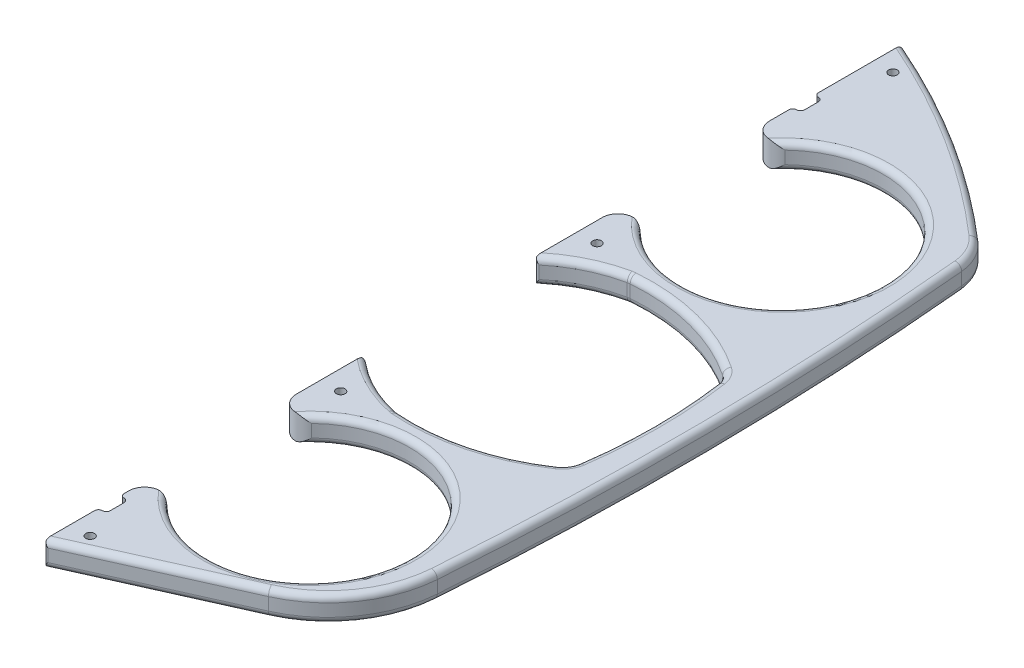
ISO-10303-21;
HEADER;
FILE_DESCRIPTION(('STEP AP214'),'2;1');
FILE_NAME('part.step','',(''),(''),'','','');
FILE_SCHEMA(('AUTOMOTIVE_DESIGN { 1 0 10303 214 1 1 1 1 }'));
ENDSEC;
DATA;
#1=APPLICATION_CONTEXT('core data for automotive mechanical design processes');
#2=APPLICATION_PROTOCOL_DEFINITION('international standard','automotive_design',2000,#1);
#3=PRODUCT_CONTEXT('',#1,'mechanical');
#4=PRODUCT('Part','Part','',(#3));
#5=PRODUCT_RELATED_PRODUCT_CATEGORY('part','',(#4));
#6=PRODUCT_DEFINITION_FORMATION('','',#4);
#7=PRODUCT_DEFINITION_CONTEXT('part definition',#1,'design');
#8=PRODUCT_DEFINITION('design','',#6,#7);
#9=PRODUCT_DEFINITION_SHAPE('','',#8);
#10=(LENGTH_UNIT() NAMED_UNIT(*) SI_UNIT(.MILLI.,.METRE.));
#11=(NAMED_UNIT(*) PLANE_ANGLE_UNIT() SI_UNIT($,.RADIAN.));
#12=(NAMED_UNIT(*) SI_UNIT($,.STERADIAN.) SOLID_ANGLE_UNIT());
#13=UNCERTAINTY_MEASURE_WITH_UNIT(LENGTH_MEASURE(1.E-05),#10,'distance_accuracy_value','');
#14=(GEOMETRIC_REPRESENTATION_CONTEXT(3) GLOBAL_UNCERTAINTY_ASSIGNED_CONTEXT((#13)) GLOBAL_UNIT_ASSIGNED_CONTEXT((#10,
#11,#12)) REPRESENTATION_CONTEXT('',''));
#15=CARTESIAN_POINT('',(0.,0.,0.));
#16=DIRECTION('',(0.,0.,1.));
#17=DIRECTION('',(1.,0.,0.));
#18=AXIS2_PLACEMENT_3D('',#15,#16,#17);
#19=CARTESIAN_POINT('',(0.,12.7,-446.014663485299));
#20=DIRECTION('',(1.,0.,0.));
#21=DIRECTION('',(0.,0.,-1.));
#22=AXIS2_PLACEMENT_3D('',#19,#20,#21);
#23=PLANE('',#22);
#24=DIRECTION('',(0.,-1.,0.));
#25=VECTOR('',#24,1.);
#26=CARTESIAN_POINT('',(0.,12.7,-444.486938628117));
#27=LINE('',#26,#25);
#28=CARTESIAN_POINT('',(0.,12.1580357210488,-444.486938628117));
#29=VERTEX_POINT('',#28);
#30=CARTESIAN_POINT('',(0.,0.541964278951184,-444.486938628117));
#31=VERTEX_POINT('',#30);
#32=EDGE_CURVE('E527',#29,#31,#27,.T.);
#33=ORIENTED_EDGE('',*,*,#32,.T.);
#34=CARTESIAN_POINT('',(0.,0.541964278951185,-444.486938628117));
#35=CARTESIAN_POINT('',(0.,0.487296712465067,-444.398440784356));
#36=CARTESIAN_POINT('',(0.,0.436598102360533,-444.307513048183));
#37=CARTESIAN_POINT('',(0.,0.343326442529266,-444.121591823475));
#38=CARTESIAN_POINT('',(0.,0.300752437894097,-444.026598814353));
#39=CARTESIAN_POINT('',(0.,0.224760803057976,-443.835473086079));
#40=CARTESIAN_POINT('',(0.,0.19116029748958,-443.739412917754));
#41=CARTESIAN_POINT('',(0.,0.132009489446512,-443.544876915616));
#42=CARTESIAN_POINT('',(0.,0.106457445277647,-443.446401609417));
#43=CARTESIAN_POINT('',(0.,0.0568992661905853,-443.21728740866));
#44=CARTESIAN_POINT('',(0.,0.0357550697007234,-443.086021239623));
#45=CARTESIAN_POINT('',(0.,0.00719206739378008,-442.820021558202));
#46=CARTESIAN_POINT('',(0.,-1.74903626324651E-05,-442.685265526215));
#47=CARTESIAN_POINT('',(0.,0.,-442.550538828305));
#48=B_SPLINE_CURVE_WITH_KNOTS('',3,(#34,#35,#36,#37,#38,#39,#40,#41,#42,#43,#44,#45,#46,#47),
.UNSPECIFIED.,.F.,.F.,(4,2,2,2,2,2,4),(0.,0.311933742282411,0.623830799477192,0.928778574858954,
1.23366031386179,1.63177017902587,2.03581314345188),.UNSPECIFIED.);
#49=CARTESIAN_POINT('',(0.,0.,-442.550538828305));
#50=VERTEX_POINT('',#49);
#51=EDGE_CURVE('E1864',#31,#50,#48,.T.);
#52=ORIENTED_EDGE('',*,*,#51,.T.);
#53=DIRECTION('',(0.,0.,1.));
#54=VECTOR('',#53,1.);
#55=CARTESIAN_POINT('',(0.,0.,-446.014663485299));
#56=LINE('',#55,#54);
#57=CARTESIAN_POINT('',(0.,0.,-403.211070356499));
#58=VERTEX_POINT('',#57);
#59=EDGE_CURVE('E864',#50,#58,#56,.T.);
#60=ORIENTED_EDGE('',*,*,#59,.T.);
#61=DIRECTION('',(0.,1.,0.));
#62=VECTOR('',#61,1.);
#63=CARTESIAN_POINT('',(0.,12.7,-403.211070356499));
#64=LINE('',#63,#62);
#65=CARTESIAN_POINT('',(0.,12.7,-403.211070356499));
#66=VERTEX_POINT('',#65);
#67=EDGE_CURVE('E508',#58,#66,#64,.T.);
#68=ORIENTED_EDGE('',*,*,#67,.T.);
#69=DIRECTION('',(0.,0.,1.));
#70=VECTOR('',#69,1.);
#71=CARTESIAN_POINT('',(0.,12.7,-446.014663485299));
#72=LINE('',#71,#70);
#73=CARTESIAN_POINT('',(0.,12.7,-442.550538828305));
#74=VERTEX_POINT('',#73);
#75=EDGE_CURVE('E785',#74,#66,#72,.T.);
#76=ORIENTED_EDGE('',*,*,#75,.F.);
#77=CARTESIAN_POINT('',(0.,12.7,-442.550538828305));
#78=CARTESIAN_POINT('',(0.,12.7000048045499,-442.656191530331));
#79=CARTESIAN_POINT('',(0.,12.695576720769,-442.76184696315));
#80=CARTESIAN_POINT('',(0.,12.6778817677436,-442.972459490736));
#81=CARTESIAN_POINT('',(0.,12.6646111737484,-443.077416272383));
#82=CARTESIAN_POINT('',(0.,12.629664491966,-443.283442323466));
#83=CARTESIAN_POINT('',(0.,12.608188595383,-443.384545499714));
#84=CARTESIAN_POINT('',(0.,12.5569057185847,-443.584569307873));
#85=CARTESIAN_POINT('',(0.,12.5271020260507,-443.683490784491));
#86=CARTESIAN_POINT('',(0.,12.4505955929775,-443.903329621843));
#87=CARTESIAN_POINT('',(0.,12.4015220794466,-444.023431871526));
#88=CARTESIAN_POINT('',(0.,12.2898874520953,-444.259358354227));
#89=CARTESIAN_POINT('',(0.,12.2271384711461,-444.375093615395));
#90=CARTESIAN_POINT('',(0.,12.1580357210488,-444.486938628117));
#91=B_SPLINE_CURVE_WITH_KNOTS('',3,(#77,#78,#79,#80,#81,#82,#83,#84,#85,#86,#87,#88,#89,#90),
.UNSPECIFIED.,.F.,.F.,(4,2,2,2,2,2,4),(0.,0.31687014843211,0.633873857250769,0.943591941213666,
1.25318792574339,1.64164040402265,2.0358097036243),.UNSPECIFIED.);
#92=EDGE_CURVE('E1869',#74,#29,#91,.T.);
#93=ORIENTED_EDGE('',*,*,#92,.T.);
#94=EDGE_LOOP('',(#33,#52,#60,#68,#76,#93));
#95=FACE_BOUND('',#94,.T.);
#96=ADVANCED_FACE('F34',(#95),#23,.F.);
#97=CARTESIAN_POINT('',(0.,12.7,-10.4816666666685));
#98=DIRECTION('',(1.,0.,0.));
#99=DIRECTION('',(0.,0.,-1.));
#100=AXIS2_PLACEMENT_3D('',#97,#98,#99);
#101=PLANE('',#100);
#102=DIRECTION('',(0.,0.,1.));
#103=VECTOR('',#102,1.);
#104=CARTESIAN_POINT('',(0.,0.,-10.4816666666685));
#105=LINE('',#104,#103);
#106=CARTESIAN_POINT('',(0.,0.,-53.5882566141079));
#107=VERTEX_POINT('',#106);
#108=CARTESIAN_POINT('',(0.,0.,-51.2182566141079));
#109=VERTEX_POINT('',#108);
#110=EDGE_CURVE('E861',#107,#109,#105,.T.);
#111=ORIENTED_EDGE('',*,*,#110,.T.);
#112=DIRECTION('',(0.,1.,0.));
#113=VECTOR('',#112,1.);
#114=CARTESIAN_POINT('',(0.,12.7,-51.2182566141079));
#115=LINE('',#114,#113);
#116=CARTESIAN_POINT('',(0.,12.7,-51.2182566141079));
#117=VERTEX_POINT('',#116);
#118=EDGE_CURVE('E473',#109,#117,#115,.T.);
#119=ORIENTED_EDGE('',*,*,#118,.T.);
#120=DIRECTION('',(0.,0.,1.));
#121=VECTOR('',#120,1.);
#122=CARTESIAN_POINT('',(0.,12.7,-10.4816666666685));
#123=LINE('',#122,#121);
#124=CARTESIAN_POINT('',(0.,12.7,-53.5882566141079));
#125=VERTEX_POINT('',#124);
#126=EDGE_CURVE('E786',#125,#117,#123,.T.);
#127=ORIENTED_EDGE('',*,*,#126,.F.);
#128=DIRECTION('',(0.,-1.,0.));
#129=VECTOR('',#128,1.);
#130=CARTESIAN_POINT('',(0.,12.7,-53.5882566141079));
#131=LINE('',#130,#129);
#132=EDGE_CURVE('E886',#125,#107,#131,.T.);
#133=ORIENTED_EDGE('',*,*,#132,.T.);
#134=EDGE_LOOP('',(#111,#119,#127,#133));
#135=FACE_BOUND('',#134,.T.);
#136=ADVANCED_FACE('F752',(#135),#101,.F.);
#137=CARTESIAN_POINT('',(0.,12.7,-293.588256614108));
#138=DIRECTION('',(1.,0.,0.));
#139=DIRECTION('',(0.,0.,-1.));
#140=AXIS2_PLACEMENT_3D('',#137,#138,#139);
#141=PLANE('',#140);
#142=DIRECTION('',(0.,0.,1.));
#143=VECTOR('',#142,1.);
#144=CARTESIAN_POINT('',(0.,0.,-293.588256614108));
#145=LINE('',#144,#143);
#146=CARTESIAN_POINT('',(0.,0.,-293.588256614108));
#147=VERTEX_POINT('',#146);
#148=CARTESIAN_POINT('',(0.,0.,-262.681790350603));
#149=VERTEX_POINT('',#148);
#150=EDGE_CURVE('E854',#147,#149,#145,.T.);
#151=ORIENTED_EDGE('',*,*,#150,.T.);
#152=CARTESIAN_POINT('',(0.,0.,-262.681790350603));
#153=CARTESIAN_POINT('',(0.,1.08983571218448E-05,-262.546426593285));
#154=CARTESIAN_POINT('',(0.,0.00518468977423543,-262.41105738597));
#155=CARTESIAN_POINT('',(0.,0.0258566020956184,-262.140992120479));
#156=CARTESIAN_POINT('',(0.,0.0413636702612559,-262.006296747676));
#157=CARTESIAN_POINT('',(0.,0.082378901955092,-261.740584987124));
#158=CARTESIAN_POINT('',(0.,0.107727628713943,-261.609543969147));
#159=CARTESIAN_POINT('',(0.,0.16848323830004,-261.34988515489));
#160=CARTESIAN_POINT('',(0.,0.203883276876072,-261.221265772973));
#161=CARTESIAN_POINT('',(0.,0.266275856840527,-261.025567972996));
#162=CARTESIAN_POINT('',(0.,0.289674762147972,-260.957327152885));
#163=CARTESIAN_POINT('',(0.,0.339586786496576,-260.821665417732));
#164=CARTESIAN_POINT('',(0.,0.36611271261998,-260.754249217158));
#165=CARTESIAN_POINT('',(0.,0.394171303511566,-260.687464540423));
#166=B_SPLINE_CURVE_WITH_KNOTS('',3,(#152,#153,#154,#155,#156,#157,#158,#159,#160,#161,#162,
#163,#164,#165),.UNSPECIFIED.,.F.,.F.,(4,2,2,2,2,2,4),(0.,0.406003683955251,0.812359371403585,
1.21238963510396,1.6121481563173,1.82850779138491,2.04578653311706),.UNSPECIFIED.);
#167=CARTESIAN_POINT('',(0.,0.394171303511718,-260.687464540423));
#168=VERTEX_POINT('',#167);
#169=EDGE_CURVE('E679',#149,#168,#166,.T.);
#170=ORIENTED_EDGE('',*,*,#169,.T.);
#171=DIRECTION('',(0.,1.,0.));
#172=VECTOR('',#171,1.);
#173=CARTESIAN_POINT('',(0.,12.7,-260.687464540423));
#174=LINE('',#173,#172);
#175=CARTESIAN_POINT('',(0.,12.3058286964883,-260.687464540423));
#176=VERTEX_POINT('',#175);
#177=EDGE_CURVE('E559',#168,#176,#174,.T.);
#178=ORIENTED_EDGE('',*,*,#177,.T.);
#179=CARTESIAN_POINT('',(0.,12.3058286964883,-260.687464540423));
#180=CARTESIAN_POINT('',(0.,12.3583487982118,-260.812508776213));
#181=CARTESIAN_POINT('',(0.,12.4055179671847,-260.939758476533));
#182=CARTESIAN_POINT('',(0.,12.4893007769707,-261.197703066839));
#183=CARTESIAN_POINT('',(0.,12.5259136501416,-261.32839820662));
#184=CARTESIAN_POINT('',(0.,12.5882572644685,-261.590294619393));
#185=CARTESIAN_POINT('',(0.,12.6141412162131,-261.721459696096));
#186=CARTESIAN_POINT('',(0.,12.6558571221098,-261.985332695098));
#187=CARTESIAN_POINT('',(0.,12.6716933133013,-262.118039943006));
#188=CARTESIAN_POINT('',(0.,12.6883257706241,-262.322609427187));
#189=CARTESIAN_POINT('',(0.,12.6926907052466,-262.394199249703));
#190=CARTESIAN_POINT('',(0.,12.6985330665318,-262.537786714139));
#191=CARTESIAN_POINT('',(0.,12.6999987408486,-262.609784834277));
#192=CARTESIAN_POINT('',(0.,12.7,-262.681790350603));
#193=B_SPLINE_CURVE_WITH_KNOTS('',3,(#179,#180,#181,#182,#183,#184,#185,#186,#187,#188,#189,
#190,#191,#192),.UNSPECIFIED.,.F.,.F.,(4,2,2,2,2,2,4),(0.,0.406700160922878,0.813429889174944,
1.2141327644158,1.61466655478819,1.82978332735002,2.04577031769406),.UNSPECIFIED.);
#194=CARTESIAN_POINT('',(0.,12.7,-262.681790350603));
#195=VERTEX_POINT('',#194);
#196=EDGE_CURVE('E435',#176,#195,#193,.T.);
#197=ORIENTED_EDGE('',*,*,#196,.T.);
#198=DIRECTION('',(0.,0.,1.));
#199=VECTOR('',#198,1.);
#200=CARTESIAN_POINT('',(0.,12.7,-293.588256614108));
#201=LINE('',#200,#199);
#202=CARTESIAN_POINT('',(0.,12.7,-293.588256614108));
#203=VERTEX_POINT('',#202);
#204=EDGE_CURVE('E419',#203,#195,#201,.T.);
#205=ORIENTED_EDGE('',*,*,#204,.F.);
#206=DIRECTION('',(0.,-1.,0.));
#207=VECTOR('',#206,1.);
#208=CARTESIAN_POINT('',(0.,12.7,-293.588256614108));
#209=LINE('',#208,#207);
#210=EDGE_CURVE('E432',#203,#147,#209,.T.);
#211=ORIENTED_EDGE('',*,*,#210,.T.);
#212=EDGE_LOOP('',(#151,#170,#178,#197,#205,#211));
#213=FACE_BOUND('',#212,.T.);
#214=ADVANCED_FACE('F431',(#213),#141,.F.);
#215=CARTESIAN_POINT('',(8.,12.7,-293.588256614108));
#216=DIRECTION('',(0.,-1.,0.));
#217=DIRECTION('',(0.,0.,-1.));
#218=AXIS2_PLACEMENT_3D('',#215,#216,#217);
#219=CYLINDRICAL_SURFACE('',#218,7.99999999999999);
#220=CARTESIAN_POINT('',(8.,12.7,-293.588256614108));
#221=DIRECTION('',(0.,1.,0.));
#222=DIRECTION('',(0.,0.,1.));
#223=AXIS2_PLACEMENT_3D('',#220,#221,#222);
#224=CIRCLE('',#223,7.99999999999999);
#225=CARTESIAN_POINT('',(7.20275656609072,12.7,-301.548432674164));
#226=VERTEX_POINT('',#225);
#227=EDGE_CURVE('E414',#226,#203,#224,.T.);
#228=ORIENTED_EDGE('',*,*,#227,.F.);
#229=CARTESIAN_POINT('',(7.20275656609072,12.7,-301.548432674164));
#230=CARTESIAN_POINT('',(7.33826619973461,12.6999950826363,-301.562032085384));
#231=CARTESIAN_POINT('',(7.47400585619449,12.6939496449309,-301.572105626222));
#232=CARTESIAN_POINT('',(7.74466508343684,12.6711472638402,-301.585318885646));
#233=CARTESIAN_POINT('',(7.87958575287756,12.6544118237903,-301.588472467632));
#234=CARTESIAN_POINT('',(8.14636138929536,12.6118302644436,-301.588019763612));
#235=CARTESIAN_POINT('',(8.27823377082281,12.5860893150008,-301.584489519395));
#236=CARTESIAN_POINT('',(8.53990566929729,12.5266419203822,-301.571092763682));
#237=CARTESIAN_POINT('',(8.66970378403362,12.4929303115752,-301.561222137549));
#238=CARTESIAN_POINT('',(8.97696498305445,12.4040946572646,-301.530410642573));
#239=CARTESIAN_POINT('',(9.15321856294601,12.3457524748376,-301.506650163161));
#240=CARTESIAN_POINT('',(9.49990455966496,12.21826947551,-301.44835911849));
#241=CARTESIAN_POINT('',(9.67033562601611,12.1491261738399,-301.413826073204));
#242=CARTESIAN_POINT('',(10.0060307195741,12.0016432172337,-301.334595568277));
#243=CARTESIAN_POINT('',(10.171255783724,11.9232487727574,-301.289835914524));
#244=CARTESIAN_POINT('',(10.4952837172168,11.7593171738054,-301.191036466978));
#245=CARTESIAN_POINT('',(10.6540844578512,11.6737776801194,-301.136993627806));
#246=CARTESIAN_POINT('',(11.0424191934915,11.4531173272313,-300.99133072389));
#247=CARTESIAN_POINT('',(11.2679528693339,11.3144548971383,-300.89437080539));
#248=CARTESIAN_POINT('',(11.7046966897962,11.0281367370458,-300.682911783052));
#249=CARTESIAN_POINT('',(11.9158986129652,10.8804759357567,-300.568402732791));
#250=CARTESIAN_POINT('',(12.3236214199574,10.5795578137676,-300.323441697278));
#251=CARTESIAN_POINT('',(12.5201758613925,10.426314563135,-300.193028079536));
#252=CARTESIAN_POINT('',(12.8992097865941,10.1164581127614,-299.916975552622));
#253=CARTESIAN_POINT('',(13.0816967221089,9.95984675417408,-299.771344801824));
#254=CARTESIAN_POINT('',(13.3568530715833,9.71333020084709,-299.53145438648));
#255=CARTESIAN_POINT('',(13.4542720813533,9.62383045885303,-299.442175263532));
#256=CARTESIAN_POINT('',(13.5527187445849,9.53121961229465,-299.347365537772));
#257=CARTESIAN_POINT('',(13.5560217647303,9.52810980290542,-299.344179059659));
#258=CARTESIAN_POINT('',(13.5593220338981,9.525,-299.340989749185));
#259=B_SPLINE_CURVE_WITH_KNOTS('',3,(#229,#230,#231,#232,#233,#234,#235,#236,#237,#238,#239,
#240,#241,#242,#243,#244,#245,#246,#247,#248,#249,#250,#251,#252,#253,#254,#255,#256,#257,#258),
.UNSPECIFIED.,.F.,.F.,(4,2,2,2,2,2,2,2,2,2,2,2,2,2,4),(0.,0.408214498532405,0.815610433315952,
1.21839926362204,1.62144975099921,2.18211425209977,2.74290792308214,3.30720744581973,
3.87169244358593,4.71626920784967,5.56132644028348,6.40438398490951,7.24699183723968,
7.7256535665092,7.74228517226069),.UNSPECIFIED.);
#260=CARTESIAN_POINT('',(13.5593220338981,9.525,-299.340989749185));
#261=VERTEX_POINT('',#260);
#262=EDGE_CURVE('E1696',#226,#261,#259,.T.);
#263=ORIENTED_EDGE('',*,*,#262,.T.);
#264=DIRECTION('',(0.,-1.,0.));
#265=VECTOR('',#264,1.);
#266=CARTESIAN_POINT('',(13.5593220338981,12.7,-299.340989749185));
#267=LINE('',#266,#265);
#268=CARTESIAN_POINT('',(13.5593220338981,3.175,-299.340989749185));
#269=VERTEX_POINT('',#268);
#270=EDGE_CURVE('E851',#261,#269,#267,.T.);
#271=ORIENTED_EDGE('',*,*,#270,.T.);
#272=CARTESIAN_POINT('',(7.20275656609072,0.,-301.548432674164));
#273=CARTESIAN_POINT('',(7.33826619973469,4.9173637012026E-06,-301.562032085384));
#274=CARTESIAN_POINT('',(7.47400585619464,0.00605035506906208,-301.572105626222));
#275=CARTESIAN_POINT('',(7.74466508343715,0.0288527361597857,-301.585318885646));
#276=CARTESIAN_POINT('',(7.87958575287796,0.0455881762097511,-301.588472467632));
#277=CARTESIAN_POINT('',(8.14636138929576,0.0881697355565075,-301.588019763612));
#278=CARTESIAN_POINT('',(8.27823377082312,0.113910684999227,-301.584489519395));
#279=CARTESIAN_POINT('',(8.53990566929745,0.173358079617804,-301.571092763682));
#280=CARTESIAN_POINT('',(8.6697037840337,0.207069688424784,-301.561222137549));
#281=CARTESIAN_POINT('',(8.97696498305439,0.295905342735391,-301.530410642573));
#282=CARTESIAN_POINT('',(9.15321856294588,0.354247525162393,-301.506650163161));
#283=CARTESIAN_POINT('',(9.49990455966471,0.481730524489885,-301.448359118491));
#284=CARTESIAN_POINT('',(9.67033562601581,0.550873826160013,-301.413826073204));
#285=CARTESIAN_POINT('',(10.0060307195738,0.698356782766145,-301.334595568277));
#286=CARTESIAN_POINT('',(10.1712557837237,0.776751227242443,-301.289835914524));
#287=CARTESIAN_POINT('',(10.4952837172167,0.940682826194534,-301.191036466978));
#288=CARTESIAN_POINT('',(10.6540844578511,1.0262223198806,-301.136993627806));
#289=CARTESIAN_POINT('',(11.0424191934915,1.24688267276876,-300.99133072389));
#290=CARTESIAN_POINT('',(11.2679528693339,1.38554510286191,-300.89437080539));
#291=CARTESIAN_POINT('',(11.7046966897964,1.6718632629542,-300.682911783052));
#292=CARTESIAN_POINT('',(11.9158986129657,1.8195240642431,-300.56840273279));
#293=CARTESIAN_POINT('',(12.3236214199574,2.12044218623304,-300.323441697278));
#294=CARTESIAN_POINT('',(12.520175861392,2.27368543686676,-300.193028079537));
#295=CARTESIAN_POINT('',(12.899209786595,2.5835418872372,-299.916975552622));
#296=CARTESIAN_POINT('',(13.0816967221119,2.74015324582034,-299.771344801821));
#297=CARTESIAN_POINT('',(13.3568530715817,2.98666979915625,-299.531454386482));
#298=CARTESIAN_POINT('',(13.4542720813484,3.07616954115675,-299.442175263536));
#299=CARTESIAN_POINT('',(13.5527187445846,3.16878038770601,-299.347365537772));
#300=CARTESIAN_POINT('',(13.5560217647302,3.17189019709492,-299.344179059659));
#301=CARTESIAN_POINT('',(13.5593220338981,3.175,-299.340989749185));
#302=B_SPLINE_CURVE_WITH_KNOTS('',3,(#272,#273,#274,#275,#276,#277,#278,#279,#280,#281,#282,
#283,#284,#285,#286,#287,#288,#289,#290,#291,#292,#293,#294,#295,#296,#297,#298,#299,#300,#301),
.UNSPECIFIED.,.F.,.F.,(4,2,2,2,2,2,2,2,2,2,2,2,2,2,4),(0.,0.408214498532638,0.815610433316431,
1.21839926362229,1.62144975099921,2.18211425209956,2.74290792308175,3.3072074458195,
3.87169244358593,4.71626920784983,5.56132644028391,6.40438398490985,7.24699183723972,
7.7256535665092,7.74228517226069),.UNSPECIFIED.);
#303=CARTESIAN_POINT('',(7.20275656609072,0.,-301.548432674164));
#304=VERTEX_POINT('',#303);
#305=EDGE_CURVE('E1691',#269,#304,#302,.F.);
#306=ORIENTED_EDGE('',*,*,#305,.T.);
#307=CARTESIAN_POINT('',(8.,0.,-293.588256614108));
#308=DIRECTION('',(0.,1.,0.));
#309=DIRECTION('',(0.,0.,1.));
#310=AXIS2_PLACEMENT_3D('',#307,#308,#309);
#311=CIRCLE('',#310,7.99999999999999);
#312=EDGE_CURVE('E440',#304,#147,#311,.T.);
#313=ORIENTED_EDGE('',*,*,#312,.T.);
#314=ORIENTED_EDGE('',*,*,#210,.F.);
#315=EDGE_LOOP('',(#228,#263,#271,#306,#313,#314));
#316=FACE_BOUND('',#315,.T.);
#317=ADVANCED_FACE('F438',(#316),#219,.T.);
#318=DIRECTION('',(0.,1.,0.));
#319=VECTOR('',#318,1.);
#320=CARTESIAN_POINT('',(0.,12.7,-171.341862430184));
#321=LINE('',#320,#319);
#322=CARTESIAN_POINT('',(0.,12.3058286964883,-171.341862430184));
#323=VERTEX_POINT('',#322);
#324=CARTESIAN_POINT('',(0.,0.394171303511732,-171.341862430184));
#325=VERTEX_POINT('',#324);
#326=EDGE_CURVE('E556',#323,#325,#321,.F.);
#327=ORIENTED_EDGE('',*,*,#326,.T.);
#328=CARTESIAN_POINT('',(0.,0.394171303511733,-171.341862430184));
#329=CARTESIAN_POINT('',(0.,0.341651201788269,-171.216818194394));
#330=CARTESIAN_POINT('',(0.,0.294482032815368,-171.089568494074));
#331=CARTESIAN_POINT('',(0.,0.210699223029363,-170.831623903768));
#332=CARTESIAN_POINT('',(0.,0.174086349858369,-170.700928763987));
#333=CARTESIAN_POINT('',(0.,0.111742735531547,-170.439032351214));
#334=CARTESIAN_POINT('',(0.,0.0858587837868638,-170.307867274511));
#335=CARTESIAN_POINT('',(0.,0.0441428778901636,-170.043994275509));
#336=CARTESIAN_POINT('',(0.,0.0283066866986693,-169.911287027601));
#337=CARTESIAN_POINT('',(0.,0.0116742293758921,-169.70671754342));
#338=CARTESIAN_POINT('',(0.,0.00730929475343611,-169.635127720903));
#339=CARTESIAN_POINT('',(0.,0.00146693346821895,-169.491540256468));
#340=CARTESIAN_POINT('',(0.,1.25915136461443E-06,-169.41954213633));
#341=CARTESIAN_POINT('',(0.,0.,-169.347536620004));
#342=B_SPLINE_CURVE_WITH_KNOTS('',3,(#328,#329,#330,#331,#332,#333,#334,#335,#336,#337,#338,
#339,#340,#341),.UNSPECIFIED.,.F.,.F.,(4,2,2,2,2,2,4),(0.,0.406700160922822,0.81342988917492,
1.21413276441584,1.6146665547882,1.82978332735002,2.04577031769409),.UNSPECIFIED.);
#343=CARTESIAN_POINT('',(0.,0.,-169.347536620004));
#344=VERTEX_POINT('',#343);
#345=EDGE_CURVE('E651',#325,#344,#342,.T.);
#346=ORIENTED_EDGE('',*,*,#345,.T.);
#347=CARTESIAN_POINT('',(0.,0.,-138.441070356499));
#348=VERTEX_POINT('',#347);
#349=EDGE_CURVE('E853',#344,#348,#145,.T.);
#350=ORIENTED_EDGE('',*,*,#349,.T.);
#351=DIRECTION('',(0.,-1.,0.));
#352=VECTOR('',#351,1.);
#353=CARTESIAN_POINT('',(0.,12.7,-138.441070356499));
#354=LINE('',#353,#352);
#355=CARTESIAN_POINT('',(0.,12.7,-138.441070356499));
#356=VERTEX_POINT('',#355);
#357=EDGE_CURVE('E443',#356,#348,#354,.T.);
#358=ORIENTED_EDGE('',*,*,#357,.F.);
#359=CARTESIAN_POINT('',(0.,12.7,-169.347536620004));
#360=VERTEX_POINT('',#359);
#361=EDGE_CURVE('E425',#360,#356,#201,.T.);
#362=ORIENTED_EDGE('',*,*,#361,.F.);
#363=CARTESIAN_POINT('',(0.,12.7,-169.347536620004));
#364=CARTESIAN_POINT('',(0.,12.6999891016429,-169.482900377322));
#365=CARTESIAN_POINT('',(0.,12.6948153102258,-169.618269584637));
#366=CARTESIAN_POINT('',(0.,12.6741433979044,-169.888334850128));
#367=CARTESIAN_POINT('',(0.,12.6586363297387,-170.023030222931));
#368=CARTESIAN_POINT('',(0.,12.6176210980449,-170.288741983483));
#369=CARTESIAN_POINT('',(0.,12.5922723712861,-170.41978300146));
#370=CARTESIAN_POINT('',(0.,12.5315167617,-170.679441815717));
#371=CARTESIAN_POINT('',(0.,12.4961167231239,-170.808061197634));
#372=CARTESIAN_POINT('',(0.,12.4337241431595,-171.003758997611));
#373=CARTESIAN_POINT('',(0.,12.410325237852,-171.071999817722));
#374=CARTESIAN_POINT('',(0.,12.3604132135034,-171.207661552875));
#375=CARTESIAN_POINT('',(0.,12.33388728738,-171.275077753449));
#376=CARTESIAN_POINT('',(0.,12.3058286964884,-171.341862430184));
#377=B_SPLINE_CURVE_WITH_KNOTS('',3,(#363,#364,#365,#366,#367,#368,#369,#370,#371,#372,#373,
#374,#375,#376),.UNSPECIFIED.,.F.,.F.,(4,2,2,2,2,2,4),(0.,0.406003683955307,0.812359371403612,
1.21238963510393,1.61214815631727,1.82850779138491,2.04578653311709),.UNSPECIFIED.);
#378=EDGE_CURVE('E632',#360,#323,#377,.T.);
#379=ORIENTED_EDGE('',*,*,#378,.T.);
#380=EDGE_LOOP('',(#327,#346,#350,#358,#362,#379));
#381=FACE_BOUND('',#380,.T.);
#382=ADVANCED_FACE('F658',(#381),#141,.F.);
#383=CARTESIAN_POINT('',(8.,12.7,-138.441070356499));
#384=DIRECTION('',(0.,-1.,0.));
#385=DIRECTION('',(0.,0.,-1.));
#386=AXIS2_PLACEMENT_3D('',#383,#384,#385);
#387=CYLINDRICAL_SURFACE('',#386,8.00000000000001);
#388=DIRECTION('',(0.,-1.,0.));
#389=VECTOR('',#388,1.);
#390=CARTESIAN_POINT('',(13.5593220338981,12.7,-132.688337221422));
#391=LINE('',#390,#389);
#392=CARTESIAN_POINT('',(13.5593220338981,9.525,-132.688337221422));
#393=VERTEX_POINT('',#392);
#394=CARTESIAN_POINT('',(13.5593220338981,3.175,-132.688337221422));
#395=VERTEX_POINT('',#394);
#396=EDGE_CURVE('E449',#393,#395,#391,.T.);
#397=ORIENTED_EDGE('',*,*,#396,.F.);
#398=CARTESIAN_POINT('',(7.20275656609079,12.7,-130.480894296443));
#399=CARTESIAN_POINT('',(7.33826619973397,12.6999950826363,-130.467294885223));
#400=CARTESIAN_POINT('',(7.47400585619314,12.693949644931,-130.457221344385));
#401=CARTESIAN_POINT('',(7.74466508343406,12.6711472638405,-130.444008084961));
#402=CARTESIAN_POINT('',(7.87958575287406,12.6544118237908,-130.440854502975));
#403=CARTESIAN_POINT('',(8.14636138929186,12.6118302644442,-130.441307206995));
#404=CARTESIAN_POINT('',(8.27823377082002,12.5860893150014,-130.444837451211));
#405=CARTESIAN_POINT('',(8.53990566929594,12.5266419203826,-130.458234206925));
#406=CARTESIAN_POINT('',(8.66970378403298,12.4929303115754,-130.468104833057));
#407=CARTESIAN_POINT('',(8.97696498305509,12.4040946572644,-130.498916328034));
#408=CARTESIAN_POINT('',(9.15321856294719,12.3457524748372,-130.522676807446));
#409=CARTESIAN_POINT('',(9.49990455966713,12.2182694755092,-130.580967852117));
#410=CARTESIAN_POINT('',(9.67033562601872,12.1491261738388,-130.615500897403));
#411=CARTESIAN_POINT('',(10.0060307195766,12.0016432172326,-130.694731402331));
#412=CARTESIAN_POINT('',(10.171255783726,11.9232487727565,-130.739491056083));
#413=CARTESIAN_POINT('',(10.4952837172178,11.7593171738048,-130.838290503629));
#414=CARTESIAN_POINT('',(10.6540844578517,11.6737776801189,-130.892333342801));
#415=CARTESIAN_POINT('',(11.0424191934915,11.4531173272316,-131.037996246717));
#416=CARTESIAN_POINT('',(11.2679528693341,11.3144548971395,-131.134956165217));
#417=CARTESIAN_POINT('',(11.7046966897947,11.0281367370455,-131.346415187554));
#418=CARTESIAN_POINT('',(11.9158986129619,10.8804759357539,-131.460924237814));
#419=CARTESIAN_POINT('',(12.3236214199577,10.5795578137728,-131.70588527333));
#420=CARTESIAN_POINT('',(12.5201758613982,10.4263145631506,-131.836298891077));
#421=CARTESIAN_POINT('',(12.8992097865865,10.1164581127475,-132.112351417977));
#422=CARTESIAN_POINT('',(13.0816967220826,9.95984675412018,-132.257982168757));
#423=CARTESIAN_POINT('',(13.3568530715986,9.71333020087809,-132.497872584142));
#424=CARTESIAN_POINT('',(13.4542720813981,9.6238304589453,-132.587151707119));
#425=CARTESIAN_POINT('',(13.552718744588,9.53121961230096,-132.681961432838));
#426=CARTESIAN_POINT('',(13.556021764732,9.52810980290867,-132.68514791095));
#427=CARTESIAN_POINT('',(13.5593220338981,9.525,-132.688337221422));
#428=B_SPLINE_CURVE_WITH_KNOTS('',3,(#398,#399,#400,#401,#402,#403,#404,#405,#406,#407,#408,
#409,#410,#411,#412,#413,#414,#415,#416,#417,#418,#419,#420,#421,#422,#423,#424,#425,#426,#427),
.UNSPECIFIED.,.F.,.F.,(4,2,2,2,2,2,2,2,2,2,2,2,2,2,4),(0.,0.408214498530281,0.815610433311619,
1.21839926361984,1.62144975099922,2.18211425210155,2.74290792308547,3.3072074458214,
3.87169244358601,4.71626920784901,5.56132644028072,6.40438398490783,7.24699183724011,
7.72565356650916,7.74228517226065),.UNSPECIFIED.);
#429=CARTESIAN_POINT('',(7.20275656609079,12.7,-130.480894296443));
#430=VERTEX_POINT('',#429);
#431=EDGE_CURVE('E917',#393,#430,#428,.F.);
#432=ORIENTED_EDGE('',*,*,#431,.T.);
#433=CARTESIAN_POINT('',(8.,12.7,-138.441070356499));
#434=DIRECTION('',(0.,1.,0.));
#435=DIRECTION('',(0.,0.,1.));
#436=AXIS2_PLACEMENT_3D('',#433,#434,#435);
#437=CIRCLE('',#436,8.00000000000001);
#438=EDGE_CURVE('E436',#356,#430,#437,.T.);
#439=ORIENTED_EDGE('',*,*,#438,.F.);
#440=ORIENTED_EDGE('',*,*,#357,.T.);
#441=CARTESIAN_POINT('',(8.,0.,-138.441070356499));
#442=DIRECTION('',(0.,1.,0.));
#443=DIRECTION('',(0.,0.,1.));
#444=AXIS2_PLACEMENT_3D('',#441,#442,#443);
#445=CIRCLE('',#444,8.00000000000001);
#446=CARTESIAN_POINT('',(7.20275656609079,0.,-130.480894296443));
#447=VERTEX_POINT('',#446);
#448=EDGE_CURVE('E856',#348,#447,#445,.T.);
#449=ORIENTED_EDGE('',*,*,#448,.T.);
#450=CARTESIAN_POINT('',(7.20275656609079,0.,-130.480894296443));
#451=CARTESIAN_POINT('',(7.33826619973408,4.91736370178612E-06,-130.467294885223));
#452=CARTESIAN_POINT('',(7.47400585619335,0.00605035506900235,-130.457221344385));
#453=CARTESIAN_POINT('',(7.74466508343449,0.0288527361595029,-130.444008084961));
#454=CARTESIAN_POINT('',(7.8795857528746,0.0455881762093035,-130.440854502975));
#455=CARTESIAN_POINT('',(8.1463613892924,0.0881697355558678,-130.441307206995));
#456=CARTESIAN_POINT('',(8.27823377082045,0.113910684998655,-130.444837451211));
#457=CARTESIAN_POINT('',(8.53990566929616,0.173358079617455,-130.458234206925));
#458=CARTESIAN_POINT('',(8.66970378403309,0.207069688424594,-130.468104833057));
#459=CARTESIAN_POINT('',(8.97696498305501,0.295905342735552,-130.498916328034));
#460=CARTESIAN_POINT('',(9.15321856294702,0.354247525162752,-130.522676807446));
#461=CARTESIAN_POINT('',(9.49990455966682,0.481730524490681,-130.580967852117));
#462=CARTESIAN_POINT('',(9.67033562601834,0.550873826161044,-130.615500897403));
#463=CARTESIAN_POINT('',(10.0060307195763,0.698356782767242,-130.694731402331));
#464=CARTESIAN_POINT('',(10.1712557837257,0.776751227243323,-130.739491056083));
#465=CARTESIAN_POINT('',(10.4952837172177,0.940682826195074,-130.838290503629));
#466=CARTESIAN_POINT('',(10.6540844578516,1.02622231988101,-130.892333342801));
#467=CARTESIAN_POINT('',(11.0424191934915,1.24688267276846,-131.037996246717));
#468=CARTESIAN_POINT('',(11.2679528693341,1.38554510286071,-131.134956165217));
#469=CARTESIAN_POINT('',(11.704696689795,1.67186326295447,-131.346415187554));
#470=CARTESIAN_POINT('',(11.9158986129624,1.81952406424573,-131.460924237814));
#471=CARTESIAN_POINT('',(12.3236214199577,2.120442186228,-131.70588527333));
#472=CARTESIAN_POINT('',(12.5201758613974,2.27368543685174,-131.836298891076));
#473=CARTESIAN_POINT('',(12.8992097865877,2.58354188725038,-132.112351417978));
#474=CARTESIAN_POINT('',(13.0816967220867,2.74015324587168,-132.257982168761));
#475=CARTESIAN_POINT('',(13.3568530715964,2.98666979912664,-132.497872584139));
#476=CARTESIAN_POINT('',(13.4542720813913,3.07616954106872,-132.587151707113));
#477=CARTESIAN_POINT('',(13.5527187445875,3.16878038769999,-132.681961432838));
#478=CARTESIAN_POINT('',(13.5560217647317,3.17189019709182,-132.685147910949));
#479=CARTESIAN_POINT('',(13.5593220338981,3.175,-132.688337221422));
#480=B_SPLINE_CURVE_WITH_KNOTS('',3,(#450,#451,#452,#453,#454,#455,#456,#457,#458,#459,#460,
#461,#462,#463,#464,#465,#466,#467,#468,#469,#470,#471,#472,#473,#474,#475,#476,#477,#478,#479),
.UNSPECIFIED.,.F.,.F.,(4,2,2,2,2,2,2,2,2,2,2,2,2,2,4),(0.,0.408214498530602,0.815610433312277,
1.21839926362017,1.62144975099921,2.18211425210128,2.74290792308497,3.30720744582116,
3.871692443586,4.71626920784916,5.56132644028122,6.40438398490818,7.24699183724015,
7.72565356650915,7.74228517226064),.UNSPECIFIED.);
#481=EDGE_CURVE('E55',#447,#395,#480,.T.);
#482=ORIENTED_EDGE('',*,*,#481,.T.);
#483=EDGE_LOOP('',(#397,#432,#439,#440,#449,#482));
#484=FACE_BOUND('',#483,.T.);
#485=ADVANCED_FACE('F663',(#484),#387,.T.);
#486=CARTESIAN_POINT('',(48.9999999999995,12.7,-96.0146634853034));
#487=DIRECTION('',(0.,-1.,0.));
#488=DIRECTION('',(0.,0.,-1.));
#489=AXIS2_PLACEMENT_3D('',#486,#487,#488);
#490=CYLINDRICAL_SURFACE('',#489,51.0000000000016);
#491=DIRECTION('',(0.,-1.,0.));
#492=VECTOR('',#491,1.);
#493=CARTESIAN_POINT('',(13.5593220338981,12.7,-59.3409897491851));
#494=LINE('',#493,#492);
#495=CARTESIAN_POINT('',(13.5593220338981,9.525,-59.3409897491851));
#496=VERTEX_POINT('',#495);
#497=CARTESIAN_POINT('',(13.5593220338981,3.175,-59.3409897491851));
#498=VERTEX_POINT('',#497);
#499=EDGE_CURVE('E889',#496,#498,#494,.T.);
#500=ORIENTED_EDGE('',*,*,#499,.F.);
#501=CARTESIAN_POINT('',(48.9999999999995,9.525,-96.0146634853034));
#502=DIRECTION('',(0.,1.,0.));
#503=DIRECTION('',(0.,0.,1.));
#504=AXIS2_PLACEMENT_3D('',#501,#502,#503);
#505=CIRCLE('',#504,51.0000000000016);
#506=EDGE_CURVE('E898',#496,#393,#505,.T.);
#507=ORIENTED_EDGE('',*,*,#506,.T.);
#508=ORIENTED_EDGE('',*,*,#396,.T.);
#509=CARTESIAN_POINT('',(48.9999999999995,3.175,-96.0146634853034));
#510=DIRECTION('',(0.,1.,0.));
#511=DIRECTION('',(0.,0.,1.));
#512=AXIS2_PLACEMENT_3D('',#509,#510,#511);
#513=CIRCLE('',#512,51.0000000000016);
#514=EDGE_CURVE('E896',#395,#498,#513,.F.);
#515=ORIENTED_EDGE('',*,*,#514,.T.);
#516=EDGE_LOOP('',(#500,#507,#508,#515));
#517=FACE_BOUND('',#516,.T.);
#518=ADVANCED_FACE('F895',(#517),#490,.F.);
#519=CARTESIAN_POINT('',(8.,12.7,-53.5882566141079));
#520=DIRECTION('',(0.,-1.,0.));
#521=DIRECTION('',(0.,0.,-1.));
#522=AXIS2_PLACEMENT_3D('',#519,#520,#521);
#523=CYLINDRICAL_SURFACE('',#522,8.);
#524=CARTESIAN_POINT('',(8.,12.7,-53.5882566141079));
#525=DIRECTION('',(0.,1.,0.));
#526=DIRECTION('',(0.,0.,-1.));
#527=AXIS2_PLACEMENT_3D('',#524,#525,#526);
#528=CIRCLE('',#527,8.);
#529=CARTESIAN_POINT('',(7.20275656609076,12.7,-61.5484326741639));
#530=VERTEX_POINT('',#529);
#531=EDGE_CURVE('E844',#530,#125,#528,.T.);
#532=ORIENTED_EDGE('',*,*,#531,.F.);
#533=CARTESIAN_POINT('',(7.20275656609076,12.7,-61.5484326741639));
#534=CARTESIAN_POINT('',(7.33826619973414,12.6999950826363,-61.5620320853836));
#535=CARTESIAN_POINT('',(7.47400585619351,12.693949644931,-61.5721056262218));
#536=CARTESIAN_POINT('',(7.74466508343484,12.6711472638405,-61.5853188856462));
#537=CARTESIAN_POINT('',(7.87958575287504,12.6544118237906,-61.588472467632));
#538=CARTESIAN_POINT('',(8.14636138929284,12.611830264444,-61.588019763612));
#539=CARTESIAN_POINT('',(8.2782337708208,12.5860893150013,-61.5844895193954));
#540=CARTESIAN_POINT('',(8.53990566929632,12.5266419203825,-61.5710927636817));
#541=CARTESIAN_POINT('',(8.66970378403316,12.4929303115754,-61.5612221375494));
#542=CARTESIAN_POINT('',(8.9769649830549,12.4040946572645,-61.530410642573));
#543=CARTESIAN_POINT('',(9.15321856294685,12.3457524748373,-61.5066501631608));
#544=CARTESIAN_POINT('',(9.49990455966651,12.2182694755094,-61.4483591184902));
#545=CARTESIAN_POINT('',(9.67033562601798,12.1491261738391,-61.4138260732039));
#546=CARTESIAN_POINT('',(10.0060307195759,12.0016432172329,-61.3345955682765));
#547=CARTESIAN_POINT('',(10.1712557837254,11.9232487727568,-61.2898359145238));
#548=CARTESIAN_POINT('',(10.4952837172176,11.759317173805,-61.1910364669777));
#549=CARTESIAN_POINT('',(10.6540844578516,11.673777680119,-61.1369936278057));
#550=CARTESIAN_POINT('',(11.0424191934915,11.4531173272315,-60.9913307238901));
#551=CARTESIAN_POINT('',(11.267952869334,11.3144548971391,-60.8943708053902));
#552=CARTESIAN_POINT('',(11.7046966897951,11.0281367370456,-60.682911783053));
#553=CARTESIAN_POINT('',(11.9158986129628,10.8804759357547,-60.5684027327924));
#554=CARTESIAN_POINT('',(12.3236214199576,10.5795578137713,-60.3234416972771));
#555=CARTESIAN_POINT('',(12.5201758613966,10.4263145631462,-60.1930280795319));
#556=CARTESIAN_POINT('',(12.8992097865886,10.1164581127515,-59.9169755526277));
#557=CARTESIAN_POINT('',(13.0816967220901,9.95984675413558,-59.7713448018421));
#558=CARTESIAN_POINT('',(13.3568530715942,9.71333020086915,-59.5314543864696));
#559=CARTESIAN_POINT('',(13.4542720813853,9.6238304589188,-59.4421752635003));
#560=CARTESIAN_POINT('',(13.5527187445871,9.53121961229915,-59.3473655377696));
#561=CARTESIAN_POINT('',(13.5560217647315,9.52810980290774,-59.3441790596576));
#562=CARTESIAN_POINT('',(13.5593220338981,9.525,-59.3409897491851));
#563=B_SPLINE_CURVE_WITH_KNOTS('',3,(#533,#534,#535,#536,#537,#538,#539,#540,#541,#542,#543,
#544,#545,#546,#547,#548,#549,#550,#551,#552,#553,#554,#555,#556,#557,#558,#559,#560,#561,#562),
.UNSPECIFIED.,.F.,.F.,(4,2,2,2,2,2,2,2,2,2,2,2,2,2,4),(0.,0.408214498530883,0.81561043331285,
1.21839926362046,1.62144975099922,2.18211425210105,2.74290792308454,3.30720744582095,
3.87169244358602,4.71626920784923,5.5613264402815,6.4043839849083,7.24699183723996,
7.72565356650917,7.74228517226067),.UNSPECIFIED.);
#564=EDGE_CURVE('E903',#530,#496,#563,.T.);
#565=ORIENTED_EDGE('',*,*,#564,.T.);
#566=ORIENTED_EDGE('',*,*,#499,.T.);
#567=CARTESIAN_POINT('',(7.20275656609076,0.,-61.5484326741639));
#568=CARTESIAN_POINT('',(7.33826619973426,4.91736370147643E-06,-61.5620320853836));
#569=CARTESIAN_POINT('',(7.47400585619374,0.00605035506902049,-61.5721056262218));
#570=CARTESIAN_POINT('',(7.7446650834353,0.0288527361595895,-61.5853188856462));
#571=CARTESIAN_POINT('',(7.87958575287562,0.0455881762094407,-61.588472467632));
#572=CARTESIAN_POINT('',(8.14636138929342,0.0881697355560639,-61.588019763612));
#573=CARTESIAN_POINT('',(8.27823377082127,0.11391068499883,-61.5844895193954));
#574=CARTESIAN_POINT('',(8.53990566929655,0.173358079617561,-61.5710927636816));
#575=CARTESIAN_POINT('',(8.66970378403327,0.207069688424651,-61.5612221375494));
#576=CARTESIAN_POINT('',(8.97696498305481,0.295905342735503,-61.530410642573));
#577=CARTESIAN_POINT('',(9.15321856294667,0.354247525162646,-61.5066501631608));
#578=CARTESIAN_POINT('',(9.49990455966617,0.481730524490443,-61.4483591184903));
#579=CARTESIAN_POINT('',(9.67033562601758,0.550873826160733,-61.413826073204));
#580=CARTESIAN_POINT('',(10.0060307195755,0.698356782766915,-61.3345955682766));
#581=CARTESIAN_POINT('',(10.1712557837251,0.776751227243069,-61.2898359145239));
#582=CARTESIAN_POINT('',(10.4952837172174,0.940682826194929,-61.1910364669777));
#583=CARTESIAN_POINT('',(10.6540844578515,1.0262223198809,-61.1369936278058));
#584=CARTESIAN_POINT('',(11.0424191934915,1.24688267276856,-60.9913307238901));
#585=CARTESIAN_POINT('',(11.2679528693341,1.38554510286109,-60.8943708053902));
#586=CARTESIAN_POINT('',(11.7046966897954,1.67186326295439,-60.6829117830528));
#587=CARTESIAN_POINT('',(11.9158986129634,1.81952406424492,-60.568402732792));
#588=CARTESIAN_POINT('',(12.3236214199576,2.12044218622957,-60.3234416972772));
#589=CARTESIAN_POINT('',(12.5201758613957,2.27368543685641,-60.1930280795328));
#590=CARTESIAN_POINT('',(12.8992097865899,2.58354188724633,-59.9169755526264));
#591=CARTESIAN_POINT('',(13.0816967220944,2.74015324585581,-59.7713448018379));
#592=CARTESIAN_POINT('',(13.3568530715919,2.98666979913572,-59.5314543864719));
#593=CARTESIAN_POINT('',(13.4542720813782,3.07616954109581,-59.4421752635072));
#594=CARTESIAN_POINT('',(13.5527187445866,3.16878038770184,-59.3473655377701));
#595=CARTESIAN_POINT('',(13.5560217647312,3.17189019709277,-59.3441790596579));
#596=CARTESIAN_POINT('',(13.5593220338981,3.175,-59.3409897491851));
#597=B_SPLINE_CURVE_WITH_KNOTS('',3,(#567,#568,#569,#570,#571,#572,#573,#574,#575,#576,#577,
#578,#579,#580,#581,#582,#583,#584,#585,#586,#587,#588,#589,#590,#591,#592,#593,#594,#595,#596),
.UNSPECIFIED.,.F.,.F.,(4,2,2,2,2,2,2,2,2,2,2,2,2,2,4),(0.,0.408214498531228,0.815610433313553,
1.21839926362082,1.62144975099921,2.18211425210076,2.74290792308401,3.30720744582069,
3.87169244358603,4.71626920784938,5.56132644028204,6.40438398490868,7.24699183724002,
7.72565356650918,7.74228517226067),.UNSPECIFIED.);
#598=CARTESIAN_POINT('',(7.20275656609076,0.,-61.5484326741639));
#599=VERTEX_POINT('',#598);
#600=EDGE_CURVE('E902',#498,#599,#597,.F.);
#601=ORIENTED_EDGE('',*,*,#600,.T.);
#602=CARTESIAN_POINT('',(8.,0.,-53.5882566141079));
#603=DIRECTION('',(0.,1.,0.));
#604=DIRECTION('',(0.,0.,-1.));
#605=AXIS2_PLACEMENT_3D('',#602,#603,#604);
#606=CIRCLE('',#605,8.);
#607=EDGE_CURVE('E858',#599,#107,#606,.T.);
#608=ORIENTED_EDGE('',*,*,#607,.T.);
#609=ORIENTED_EDGE('',*,*,#132,.F.);
#610=EDGE_LOOP('',(#532,#565,#566,#601,#608,#609));
#611=FACE_BOUND('',#610,.T.);
#612=ADVANCED_FACE('F935',(#611),#523,.T.);
#613=CARTESIAN_POINT('',(0.,0.,-36.2182566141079));
#614=VERTEX_POINT('',#613);
#615=CARTESIAN_POINT('',(0.,0.,-13.9606709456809));
#616=VERTEX_POINT('',#615);
#617=EDGE_CURVE('E860',#614,#616,#105,.T.);
#618=ORIENTED_EDGE('',*,*,#617,.T.);
#619=CARTESIAN_POINT('',(0.,3.175,-13.9606709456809));
#620=DIRECTION('',(1.,0.,0.));
#621=DIRECTION('',(0.,0.,-1.));
#622=AXIS2_PLACEMENT_3D('',#619,#620,#621);
#623=ELLIPSE('',#622,3.47900427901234,3.175);
#624=CARTESIAN_POINT('',(0.,0.53658869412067,-12.0253744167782));
#625=VERTEX_POINT('',#624);
#626=EDGE_CURVE('E581',#616,#625,#623,.F.);
#627=ORIENTED_EDGE('',*,*,#626,.T.);
#628=DIRECTION('',(0.,-1.,0.));
#629=VECTOR('',#628,1.);
#630=CARTESIAN_POINT('',(0.,12.7,-12.0253744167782));
#631=LINE('',#630,#629);
#632=CARTESIAN_POINT('',(0.,12.1634113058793,-12.0253744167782));
#633=VERTEX_POINT('',#632);
#634=EDGE_CURVE('E550',#625,#633,#631,.F.);
#635=ORIENTED_EDGE('',*,*,#634,.T.);
#636=CARTESIAN_POINT('',(0.,9.525,-13.9606709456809));
#637=DIRECTION('',(1.,0.,0.));
#638=DIRECTION('',(0.,0.,1.));
#639=AXIS2_PLACEMENT_3D('',#636,#637,#638);
#640=ELLIPSE('',#639,3.47900427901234,3.175);
#641=CARTESIAN_POINT('',(0.,12.7,-13.9606709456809));
#642=VERTEX_POINT('',#641);
#643=EDGE_CURVE('E579',#633,#642,#640,.F.);
#644=ORIENTED_EDGE('',*,*,#643,.T.);
#645=CARTESIAN_POINT('',(0.,12.7,-36.2182566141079));
#646=VERTEX_POINT('',#645);
#647=EDGE_CURVE('E846',#646,#642,#123,.T.);
#648=ORIENTED_EDGE('',*,*,#647,.F.);
#649=DIRECTION('',(0.,1.,0.));
#650=VECTOR('',#649,1.);
#651=CARTESIAN_POINT('',(0.,12.7,-36.2182566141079));
#652=LINE('',#651,#650);
#653=EDGE_CURVE('E498',#646,#614,#652,.F.);
#654=ORIENTED_EDGE('',*,*,#653,.T.);
#655=EDGE_LOOP('',(#618,#627,#635,#644,#648,#654));
#656=FACE_BOUND('',#655,.T.);
#657=ADVANCED_FACE('F761',(#656),#101,.F.);
#658=CARTESIAN_POINT('',(0.,12.7,-10.4816666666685));
#659=DIRECTION('',(-0.408814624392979,0.,-0.91261744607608));
#660=DIRECTION('',(-0.912617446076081,0.,0.408814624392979));
#661=AXIS2_PLACEMENT_3D('',#658,#659,#660);
#662=PLANE('',#661);
#663=DIRECTION('',(0.,-1.,0.));
#664=VECTOR('',#663,1.);
#665=CARTESIAN_POINT('',(1.40881462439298,12.7,-11.1127569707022));
#666=LINE('',#665,#664);
#667=CARTESIAN_POINT('',(1.40881462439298,9.525,-11.1127569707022));
#668=VERTEX_POINT('',#667);
#669=CARTESIAN_POINT('',(1.40881462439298,3.175,-11.1127569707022));
#670=VERTEX_POINT('',#669);
#671=EDGE_CURVE('E547',#668,#670,#666,.T.);
#672=ORIENTED_EDGE('',*,*,#671,.T.);
#673=DIRECTION('',(0.912617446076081,0.,-0.408814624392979));
#674=VECTOR('',#673,1.);
#675=CARTESIAN_POINT('',(0.,3.175,-10.4816666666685));
#676=LINE('',#675,#674);
#677=CARTESIAN_POINT('',(78.6796856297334,3.175,-45.7268904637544));
#678=VERTEX_POINT('',#677);
#679=EDGE_CURVE('E566',#670,#678,#676,.T.);
#680=ORIENTED_EDGE('',*,*,#679,.T.);
#681=DIRECTION('',(0.,-1.,0.));
#682=VECTOR('',#681,1.);
#683=CARTESIAN_POINT('',(78.6796856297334,12.7,-45.7268904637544));
#684=LINE('',#683,#682);
#685=CARTESIAN_POINT('',(78.6796856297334,9.525,-45.7268904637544));
#686=VERTEX_POINT('',#685);
#687=EDGE_CURVE('E883',#686,#678,#684,.T.);
#688=ORIENTED_EDGE('',*,*,#687,.F.);
#689=DIRECTION('',(0.912617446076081,0.,-0.408814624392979));
#690=VECTOR('',#689,1.);
#691=CARTESIAN_POINT('',(1.40881462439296,9.525,-11.1127569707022));
#692=LINE('',#691,#690);
#693=EDGE_CURVE('E564',#686,#668,#692,.F.);
#694=ORIENTED_EDGE('',*,*,#693,.T.);
#695=EDGE_LOOP('',(#672,#680,#688,#694));
#696=FACE_BOUND('',#695,.T.);
#697=ADVANCED_FACE('F1088',(#696),#662,.F.);
#698=CARTESIAN_POINT('',(54.1508081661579,12.7,-100.48393722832));
#699=DIRECTION('',(0.,-1.,0.));
#700=DIRECTION('',(0.,0.,-1.));
#701=AXIS2_PLACEMENT_3D('',#698,#699,#700);
#702=CYLINDRICAL_SURFACE('',#701,59.9999999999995);
#703=ORIENTED_EDGE('',*,*,#687,.T.);
#704=CARTESIAN_POINT('',(54.1508081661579,3.175,-100.48393722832));
#705=DIRECTION('',(0.,1.,0.));
#706=DIRECTION('',(0.,0.,1.));
#707=AXIS2_PLACEMENT_3D('',#704,#705,#706);
#708=CIRCLE('',#707,59.9999999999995);
#709=CARTESIAN_POINT('',(113.984123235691,3.175,-96.0146634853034));
#710=VERTEX_POINT('',#709);
#711=EDGE_CURVE('E1738',#678,#710,#708,.T.);
#712=ORIENTED_EDGE('',*,*,#711,.T.);
#713=DIRECTION('',(0.,-1.,0.));
#714=VECTOR('',#713,1.);
#715=CARTESIAN_POINT('',(113.984123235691,12.7,-96.0146634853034));
#716=LINE('',#715,#714);
#717=CARTESIAN_POINT('',(113.984123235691,9.525,-96.0146634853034));
#718=VERTEX_POINT('',#717);
#719=EDGE_CURVE('E880',#718,#710,#716,.T.);
#720=ORIENTED_EDGE('',*,*,#719,.F.);
#721=CARTESIAN_POINT('',(54.1508081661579,9.525,-100.48393722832));
#722=DIRECTION('',(0.,1.,0.));
#723=DIRECTION('',(0.,0.,1.));
#724=AXIS2_PLACEMENT_3D('',#721,#722,#723);
#725=CIRCLE('',#724,59.9999999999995);
#726=EDGE_CURVE('E1898',#718,#686,#725,.F.);
#727=ORIENTED_EDGE('',*,*,#726,.T.);
#728=EDGE_LOOP('',(#703,#712,#720,#727));
#729=FACE_BOUND('',#728,.T.);
#730=ADVANCED_FACE('F1098',(#729),#702,.T.);
#731=CARTESIAN_POINT('',(-1492.54038638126,12.7,-216.014663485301));
#732=DIRECTION('',(0.,-1.,0.));
#733=DIRECTION('',(0.,0.,-1.));
#734=AXIS2_PLACEMENT_3D('',#731,#732,#733);
#735=CYLINDRICAL_SURFACE('',#734,1611.);
#736=ORIENTED_EDGE('',*,*,#719,.T.);
#737=CARTESIAN_POINT('',(-1492.54038638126,3.175,-216.014663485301));
#738=DIRECTION('',(0.,1.,0.));
#739=DIRECTION('',(0.,0.,1.));
#740=AXIS2_PLACEMENT_3D('',#737,#738,#739);
#741=CIRCLE('',#740,1611.);
#742=CARTESIAN_POINT('',(111.625557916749,3.175,-364.246317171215));
#743=VERTEX_POINT('',#742);
#744=EDGE_CURVE('E1894',#710,#743,#741,.T.);
#745=ORIENTED_EDGE('',*,*,#744,.T.);
#746=DIRECTION('',(0.,-1.,0.));
#747=VECTOR('',#746,1.);
#748=CARTESIAN_POINT('',(111.625557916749,12.7,-364.246317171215));
#749=LINE('',#748,#747);
#750=CARTESIAN_POINT('',(111.625557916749,9.525,-364.246317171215));
#751=VERTEX_POINT('',#750);
#752=EDGE_CURVE('E877',#751,#743,#749,.T.);
#753=ORIENTED_EDGE('',*,*,#752,.F.);
#754=CARTESIAN_POINT('',(-1492.54038638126,9.525,-216.014663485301));
#755=DIRECTION('',(0.,1.,0.));
#756=DIRECTION('',(0.,0.,1.));
#757=AXIS2_PLACEMENT_3D('',#754,#755,#756);
#758=CIRCLE('',#757,1611.);
#759=EDGE_CURVE('E1896',#751,#718,#758,.F.);
#760=ORIENTED_EDGE('',*,*,#759,.T.);
#761=EDGE_LOOP('',(#736,#745,#753,#760));
#762=FACE_BOUND('',#761,.T.);
#763=ADVANCED_FACE('F1107',(#762),#735,.T.);
#764=CARTESIAN_POINT('',(86.3333077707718,12.7,-361.90920729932));
#765=DIRECTION('',(0.,-1.,0.));
#766=DIRECTION('',(0.,0.,-1.));
#767=AXIS2_PLACEMENT_3D('',#764,#765,#766);
#768=CYLINDRICAL_SURFACE('',#767,25.4000000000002);
#769=ORIENTED_EDGE('',*,*,#752,.T.);
#770=CARTESIAN_POINT('',(86.3333077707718,3.175,-361.90920729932));
#771=DIRECTION('',(0.,1.,0.));
#772=DIRECTION('',(0.,0.,1.));
#773=AXIS2_PLACEMENT_3D('',#770,#771,#772);
#774=CIRCLE('',#773,25.4000000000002);
#775=CARTESIAN_POINT('',(102.991559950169,3.175,-381.083738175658));
#776=VERTEX_POINT('',#775);
#777=EDGE_CURVE('E1890',#743,#776,#774,.T.);
#778=ORIENTED_EDGE('',*,*,#777,.T.);
#779=DIRECTION('',(0.,-1.,0.));
#780=VECTOR('',#779,1.);
#781=CARTESIAN_POINT('',(102.991559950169,12.7,-381.083738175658));
#782=LINE('',#781,#780);
#783=CARTESIAN_POINT('',(102.991559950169,9.525,-381.083738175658));
#784=VERTEX_POINT('',#783);
#785=EDGE_CURVE('E874',#784,#776,#782,.T.);
#786=ORIENTED_EDGE('',*,*,#785,.F.);
#787=CARTESIAN_POINT('',(86.3333077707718,9.525,-361.90920729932));
#788=DIRECTION('',(0.,1.,0.));
#789=DIRECTION('',(0.,0.,1.));
#790=AXIS2_PLACEMENT_3D('',#787,#788,#789);
#791=CIRCLE('',#790,25.4000000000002);
#792=EDGE_CURVE('E1892',#784,#751,#791,.F.);
#793=ORIENTED_EDGE('',*,*,#792,.T.);
#794=EDGE_LOOP('',(#769,#778,#786,#793));
#795=FACE_BOUND('',#794,.T.);
#796=ADVANCED_FACE('F775',(#795),#768,.T.);
#797=CARTESIAN_POINT('',(-159.343120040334,12.7,-79.1226220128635));
#798=DIRECTION('',(0.,-1.,0.));
#799=DIRECTION('',(0.,0.,-1.));
#800=AXIS2_PLACEMENT_3D('',#797,#798,#799);
#801=CYLINDRICAL_SURFACE('',#800,400.);
#802=ORIENTED_EDGE('',*,*,#785,.T.);
#803=CARTESIAN_POINT('',(-159.343120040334,3.175,-79.1226220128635));
#804=DIRECTION('',(0.,1.,0.));
#805=DIRECTION('',(0.,0.,1.));
#806=AXIS2_PLACEMENT_3D('',#803,#804,#805);
#807=CIRCLE('',#806,400.);
#808=CARTESIAN_POINT('',(1.40186245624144,3.175,-445.402638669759));
#809=VERTEX_POINT('',#808);
#810=EDGE_CURVE('E1886',#776,#809,#807,.T.);
#811=ORIENTED_EDGE('',*,*,#810,.T.);
#812=DIRECTION('',(0.,-1.,0.));
#813=VECTOR('',#812,1.);
#814=CARTESIAN_POINT('',(1.40186245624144,12.7,-445.402638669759));
#815=LINE('',#814,#813);
#816=CARTESIAN_POINT('',(1.40186245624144,9.525,-445.402638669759));
#817=VERTEX_POINT('',#816);
#818=EDGE_CURVE('E544',#809,#817,#815,.F.);
#819=ORIENTED_EDGE('',*,*,#818,.T.);
#820=CARTESIAN_POINT('',(-159.343120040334,9.525,-79.1226220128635));
#821=DIRECTION('',(0.,1.,0.));
#822=DIRECTION('',(0.,0.,1.));
#823=AXIS2_PLACEMENT_3D('',#820,#821,#822);
#824=CIRCLE('',#823,400.);
#825=EDGE_CURVE('E1888',#817,#784,#824,.F.);
#826=ORIENTED_EDGE('',*,*,#825,.T.);
#827=EDGE_LOOP('',(#802,#811,#819,#826));
#828=FACE_BOUND('',#827,.T.);
#829=ADVANCED_FACE('F767',(#828),#801,.T.);
#830=CARTESIAN_POINT('',(0.,12.7,-388.211070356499));
#831=VERTEX_POINT('',#830);
#832=CARTESIAN_POINT('',(0.,12.7,-378.441070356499));
#833=VERTEX_POINT('',#832);
#834=EDGE_CURVE('E779',#831,#833,#72,.T.);
#835=ORIENTED_EDGE('',*,*,#834,.F.);
#836=DIRECTION('',(0.,1.,0.));
#837=VECTOR('',#836,1.);
#838=CARTESIAN_POINT('',(0.,12.7,-388.211070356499));
#839=LINE('',#838,#837);
#840=CARTESIAN_POINT('',(0.,0.,-388.211070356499));
#841=VERTEX_POINT('',#840);
#842=EDGE_CURVE('E500',#831,#841,#839,.F.);
#843=ORIENTED_EDGE('',*,*,#842,.T.);
#844=CARTESIAN_POINT('',(0.,0.,-378.441070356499));
#845=VERTEX_POINT('',#844);
#846=EDGE_CURVE('E797',#841,#845,#56,.T.);
#847=ORIENTED_EDGE('',*,*,#846,.T.);
#848=DIRECTION('',(0.,-1.,0.));
#849=VECTOR('',#848,1.);
#850=CARTESIAN_POINT('',(0.,12.7,-378.441070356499));
#851=LINE('',#850,#849);
#852=EDGE_CURVE('E783',#833,#845,#851,.T.);
#853=ORIENTED_EDGE('',*,*,#852,.F.);
#854=EDGE_LOOP('',(#835,#843,#847,#853));
#855=FACE_BOUND('',#854,.T.);
#856=ADVANCED_FACE('F755',(#855),#23,.F.);
#857=CARTESIAN_POINT('',(8.,12.7,-378.441070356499));
#858=DIRECTION('',(0.,-1.,0.));
#859=DIRECTION('',(0.,0.,-1.));
#860=AXIS2_PLACEMENT_3D('',#857,#858,#859);
#861=CYLINDRICAL_SURFACE('',#860,8.00000000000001);
#862=DIRECTION('',(0.,-1.,0.));
#863=VECTOR('',#862,1.);
#864=CARTESIAN_POINT('',(13.5593220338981,12.7,-372.688337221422));
#865=LINE('',#864,#863);
#866=CARTESIAN_POINT('',(13.5593220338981,9.525,-372.688337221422));
#867=VERTEX_POINT('',#866);
#868=CARTESIAN_POINT('',(13.5593220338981,3.175,-372.688337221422));
#869=VERTEX_POINT('',#868);
#870=EDGE_CURVE('E870',#867,#869,#865,.T.);
#871=ORIENTED_EDGE('',*,*,#870,.F.);
#872=CARTESIAN_POINT('',(7.2027565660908,12.7,-370.480894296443));
#873=CARTESIAN_POINT('',(7.33826619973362,12.6999950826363,-370.467294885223));
#874=CARTESIAN_POINT('',(7.47400585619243,12.693949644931,-370.457221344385));
#875=CARTESIAN_POINT('',(7.74466508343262,12.6711472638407,-370.444008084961));
#876=CARTESIAN_POINT('',(7.87958575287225,12.654411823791,-370.440854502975));
#877=CARTESIAN_POINT('',(8.14636138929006,12.6118302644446,-370.441307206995));
#878=CARTESIAN_POINT('',(8.27823377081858,12.5860893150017,-370.444837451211));
#879=CARTESIAN_POINT('',(8.53990566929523,12.5266419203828,-370.458234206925));
#880=CARTESIAN_POINT('',(8.66970378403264,12.4929303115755,-370.468104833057));
#881=CARTESIAN_POINT('',(8.97696498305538,12.4040946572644,-370.498916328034));
#882=CARTESIAN_POINT('',(9.15321856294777,12.345752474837,-370.522676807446));
#883=CARTESIAN_POINT('',(9.49990455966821,12.2182694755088,-370.580967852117));
#884=CARTESIAN_POINT('',(9.67033562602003,12.1491261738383,-370.615500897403));
#885=CARTESIAN_POINT('',(10.0060307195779,12.001643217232,-370.694731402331));
#886=CARTESIAN_POINT('',(10.171255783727,11.9232487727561,-370.739491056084));
#887=CARTESIAN_POINT('',(10.4952837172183,11.7593171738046,-370.838290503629));
#888=CARTESIAN_POINT('',(10.6540844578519,11.6737776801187,-370.892333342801));
#889=CARTESIAN_POINT('',(11.0424191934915,11.4531173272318,-371.037996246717));
#890=CARTESIAN_POINT('',(11.2679528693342,11.3144548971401,-371.134956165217));
#891=CARTESIAN_POINT('',(11.7046966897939,11.0281367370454,-371.346415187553));
#892=CARTESIAN_POINT('',(11.9158986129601,10.8804759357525,-371.460924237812));
#893=CARTESIAN_POINT('',(12.3236214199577,10.5795578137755,-371.70588527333));
#894=CARTESIAN_POINT('',(12.520175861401,10.4263145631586,-371.83629889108));
#895=CARTESIAN_POINT('',(12.8992097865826,10.1164581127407,-372.112351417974));
#896=CARTESIAN_POINT('',(13.0816967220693,9.9598467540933,-372.257982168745));
#897=CARTESIAN_POINT('',(13.3568530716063,9.71333020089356,-372.497872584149));
#898=CARTESIAN_POINT('',(13.4542720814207,9.62383045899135,-372.587151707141));
#899=CARTESIAN_POINT('',(13.5527187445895,9.53121961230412,-372.68196143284));
#900=CARTESIAN_POINT('',(13.5560217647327,9.52810980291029,-372.68514791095));
#901=CARTESIAN_POINT('',(13.5593220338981,9.525,-372.688337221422));
#902=B_SPLINE_CURVE_WITH_KNOTS('',3,(#872,#873,#874,#875,#876,#877,#878,#879,#880,#881,#882,
#883,#884,#885,#886,#887,#888,#889,#890,#891,#892,#893,#894,#895,#896,#897,#898,#899,#900,#901),
.UNSPECIFIED.,.F.,.F.,(4,2,2,2,2,2,2,2,2,2,2,2,2,2,4),(0.,0.408214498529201,0.815610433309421,
1.21839926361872,1.62144975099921,2.18211425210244,2.74290792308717,3.30720744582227,
3.87169244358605,4.71626920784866,5.56132644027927,6.4043839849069,7.24699183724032,
7.72565356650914,7.74228517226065),.UNSPECIFIED.);
#903=CARTESIAN_POINT('',(7.2027565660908,12.7,-370.480894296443));
#904=VERTEX_POINT('',#903);
#905=EDGE_CURVE('E930',#867,#904,#902,.F.);
#906=ORIENTED_EDGE('',*,*,#905,.T.);
#907=CARTESIAN_POINT('',(8.,12.7,-378.441070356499));
#908=DIRECTION('',(0.,1.,0.));
#909=DIRECTION('',(0.,0.,1.));
#910=AXIS2_PLACEMENT_3D('',#907,#908,#909);
#911=CIRCLE('',#910,8.00000000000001);
#912=EDGE_CURVE('E849',#833,#904,#911,.T.);
#913=ORIENTED_EDGE('',*,*,#912,.F.);
#914=ORIENTED_EDGE('',*,*,#852,.T.);
#915=CARTESIAN_POINT('',(8.,0.,-378.441070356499));
#916=DIRECTION('',(0.,1.,0.));
#917=DIRECTION('',(0.,0.,1.));
#918=AXIS2_PLACEMENT_3D('',#915,#916,#917);
#919=CIRCLE('',#918,8.00000000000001);
#920=CARTESIAN_POINT('',(7.2027565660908,0.,-370.480894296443));
#921=VERTEX_POINT('',#920);
#922=EDGE_CURVE('E426',#845,#921,#919,.T.);
#923=ORIENTED_EDGE('',*,*,#922,.T.);
#924=CARTESIAN_POINT('',(7.2027565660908,0.,-370.480894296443));
#925=CARTESIAN_POINT('',(7.33826619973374,4.91736370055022E-06,-370.467294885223));
#926=CARTESIAN_POINT('',(7.47400585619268,0.0060503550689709,-370.457221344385));
#927=CARTESIAN_POINT('',(7.74466508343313,0.0288527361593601,-370.444008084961));
#928=CARTESIAN_POINT('',(7.87958575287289,0.0455881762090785,-370.440854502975));
#929=CARTESIAN_POINT('',(8.1463613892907,0.0881697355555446,-370.441307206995));
#930=CARTESIAN_POINT('',(8.27823377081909,0.113910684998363,-370.444837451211));
#931=CARTESIAN_POINT('',(8.53990566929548,0.173358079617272,-370.458234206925));
#932=CARTESIAN_POINT('',(8.66970378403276,0.207069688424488,-370.468104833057));
#933=CARTESIAN_POINT('',(8.97696498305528,0.295905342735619,-370.498916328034));
#934=CARTESIAN_POINT('',(9.15321856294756,0.354247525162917,-370.522676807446));
#935=CARTESIAN_POINT('',(9.49990455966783,0.481730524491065,-370.580967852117));
#936=CARTESIAN_POINT('',(9.67033562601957,0.550873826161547,-370.615500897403));
#937=CARTESIAN_POINT('',(10.0060307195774,0.698356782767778,-370.694731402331));
#938=CARTESIAN_POINT('',(10.1712557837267,0.776751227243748,-370.739491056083));
#939=CARTESIAN_POINT('',(10.4952837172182,0.940682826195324,-370.838290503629));
#940=CARTESIAN_POINT('',(10.6540844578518,1.0262223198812,-370.892333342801));
#941=CARTESIAN_POINT('',(11.0424191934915,1.24688267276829,-371.037996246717));
#942=CARTESIAN_POINT('',(11.2679528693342,1.38554510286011,-371.134956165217));
#943=CARTESIAN_POINT('',(11.7046966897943,1.6718632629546,-371.346415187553));
#944=CARTESIAN_POINT('',(11.9158986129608,1.81952406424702,-371.460924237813));
#945=CARTESIAN_POINT('',(12.3236214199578,2.12044218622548,-371.70588527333));
#946=CARTESIAN_POINT('',(12.5201758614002,2.27368543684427,-371.836298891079));
#947=CARTESIAN_POINT('',(12.8992097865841,2.58354188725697,-372.112351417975));
#948=CARTESIAN_POINT('',(13.0816967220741,2.74015324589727,-372.257982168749));
#949=CARTESIAN_POINT('',(13.3568530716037,2.98666979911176,-372.497872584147));
#950=CARTESIAN_POINT('',(13.4542720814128,3.07616954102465,-372.587151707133));
#951=CARTESIAN_POINT('',(13.552718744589,3.16878038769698,-372.681961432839));
#952=CARTESIAN_POINT('',(13.5560217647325,3.17189019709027,-372.68514791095));
#953=CARTESIAN_POINT('',(13.5593220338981,3.175,-372.688337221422));
#954=B_SPLINE_CURVE_WITH_KNOTS('',3,(#924,#925,#926,#927,#928,#929,#930,#931,#932,#933,#934,
#935,#936,#937,#938,#939,#940,#941,#942,#943,#944,#945,#946,#947,#948,#949,#950,#951,#952,#953),
.UNSPECIFIED.,.F.,.F.,(4,2,2,2,2,2,2,2,2,2,2,2,2,2,4),(0.,0.408214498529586,0.815610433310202,
1.21839926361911,1.62144975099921,2.18211425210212,2.74290792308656,3.30720744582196,
3.87169244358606,4.71626920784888,5.56132644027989,6.40438398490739,7.24699183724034,
7.72565356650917,7.74228517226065),.UNSPECIFIED.);
#955=EDGE_CURVE('E1388',#921,#869,#954,.T.);
#956=ORIENTED_EDGE('',*,*,#955,.T.);
#957=EDGE_LOOP('',(#871,#906,#913,#914,#923,#956));
#958=FACE_BOUND('',#957,.T.);
#959=ADVANCED_FACE('F766',(#958),#861,.T.);
#960=CARTESIAN_POINT('',(48.9999999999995,12.7,-336.014663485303));
#961=DIRECTION('',(0.,-1.,0.));
#962=DIRECTION('',(0.,0.,-1.));
#963=AXIS2_PLACEMENT_3D('',#960,#961,#962);
#964=CYLINDRICAL_SURFACE('',#963,51.0000000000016);
#965=ORIENTED_EDGE('',*,*,#270,.F.);
#966=CARTESIAN_POINT('',(48.9999999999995,9.525,-336.014663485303));
#967=DIRECTION('',(0.,1.,0.));
#968=DIRECTION('',(0.,0.,1.));
#969=AXIS2_PLACEMENT_3D('',#966,#967,#968);
#970=CIRCLE('',#969,51.0000000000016);
#971=EDGE_CURVE('E1392',#261,#867,#970,.T.);
#972=ORIENTED_EDGE('',*,*,#971,.T.);
#973=ORIENTED_EDGE('',*,*,#870,.T.);
#974=CARTESIAN_POINT('',(48.9999999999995,3.175,-336.014663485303));
#975=DIRECTION('',(0.,1.,0.));
#976=DIRECTION('',(0.,0.,1.));
#977=AXIS2_PLACEMENT_3D('',#974,#975,#976);
#978=CIRCLE('',#977,51.0000000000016);
#979=EDGE_CURVE('E1390',#869,#269,#978,.F.);
#980=ORIENTED_EDGE('',*,*,#979,.T.);
#981=EDGE_LOOP('',(#965,#972,#973,#980));
#982=FACE_BOUND('',#981,.T.);
#983=ADVANCED_FACE('F773',(#982),#964,.F.);
#984=CARTESIAN_POINT('',(8.,12.7,-293.588256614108));
#985=DIRECTION('',(0.,1.,0.));
#986=DIRECTION('',(0.,0.,1.));
#987=AXIS2_PLACEMENT_3D('',#984,#985,#986);
#988=PLANE('',#987);
#989=ORIENTED_EDGE('',*,*,#912,.T.);
#990=CARTESIAN_POINT('',(48.9999999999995,12.7,-336.014663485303));
#991=DIRECTION('',(0.,1.,0.));
#992=DIRECTION('',(0.,0.,1.));
#993=AXIS2_PLACEMENT_3D('',#990,#991,#992);
#994=CIRCLE('',#993,54.1750000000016);
#995=EDGE_CURVE('E422',#904,#226,#994,.F.);
#996=ORIENTED_EDGE('',*,*,#995,.T.);
#997=ORIENTED_EDGE('',*,*,#227,.T.);
#998=ORIENTED_EDGE('',*,*,#204,.T.);
#999=CARTESIAN_POINT('',(46.3458653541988,12.7,-206.054576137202));
#1000=DIRECTION('',(0.,1.,0.));
#1001=DIRECTION('',(0.,0.,1.));
#1002=AXIS2_PLACEMENT_3D('',#999,#1000,#1001);
#1003=CIRCLE('',#1002,73.175);
#1004=CARTESIAN_POINT('',(31.1143295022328,12.7,-277.626784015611));
#1005=VERTEX_POINT('',#1004);
#1006=EDGE_CURVE('E1808',#195,#1005,#1003,.F.);
#1007=ORIENTED_EDGE('',*,*,#1006,.T.);
#1008=CARTESIAN_POINT('',(33.8567344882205,12.7,-264.740363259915));
#1009=DIRECTION('',(0.,1.,0.));
#1010=DIRECTION('',(0.,0.,1.));
#1011=AXIS2_PLACEMENT_3D('',#1008,#1009,#1010);
#1012=CIRCLE('',#1011,13.175);
#1013=CARTESIAN_POINT('',(32.8288926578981,12.7,-277.875208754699));
#1014=VERTEX_POINT('',#1013);
#1015=EDGE_CURVE('E1810',#1005,#1014,#1012,.F.);
#1016=ORIENTED_EDGE('',*,*,#1015,.T.);
#1017=CARTESIAN_POINT('',(40.8780449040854,12.7,-175.014663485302));
#1018=DIRECTION('',(0.,1.,0.));
#1019=DIRECTION('',(0.,0.,1.));
#1020=AXIS2_PLACEMENT_3D('',#1017,#1018,#1019);
#1021=CIRCLE('',#1020,103.175);
#1022=CARTESIAN_POINT('',(98.4316992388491,12.7,-260.645601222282));
#1023=VERTEX_POINT('',#1022);
#1024=EDGE_CURVE('E1812',#1014,#1023,#1021,.F.);
#1025=ORIENTED_EDGE('',*,*,#1024,.T.);
#1026=CARTESIAN_POINT('',(91.0823472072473,12.7,-249.710901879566));
#1027=DIRECTION('',(0.,1.,0.));
#1028=DIRECTION('',(0.,0.,1.));
#1029=AXIS2_PLACEMENT_3D('',#1026,#1027,#1028);
#1030=CIRCLE('',#1029,13.175);
#1031=CARTESIAN_POINT('',(104.126845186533,12.7,-251.560684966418));
#1032=VERTEX_POINT('',#1031);
#1033=EDGE_CURVE('E1814',#1023,#1032,#1030,.F.);
#1034=ORIENTED_EDGE('',*,*,#1033,.T.);
#1035=CARTESIAN_POINT('',(-146.540386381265,12.7,-216.014663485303));
#1036=DIRECTION('',(0.,1.,0.));
#1037=DIRECTION('',(0.,0.,1.));
#1038=AXIS2_PLACEMENT_3D('',#1035,#1036,#1037);
#1039=CIRCLE('',#1038,253.175);
#1040=CARTESIAN_POINT('',(104.126845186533,12.7,-180.468642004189));
#1041=VERTEX_POINT('',#1040);
#1042=EDGE_CURVE('E1816',#1032,#1041,#1039,.F.);
#1043=ORIENTED_EDGE('',*,*,#1042,.T.);
#1044=CARTESIAN_POINT('',(91.0823472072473,12.7,-182.318425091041));
#1045=DIRECTION('',(0.,1.,0.));
#1046=DIRECTION('',(0.,0.,1.));
#1047=AXIS2_PLACEMENT_3D('',#1044,#1045,#1046);
#1048=CIRCLE('',#1047,13.175);
#1049=CARTESIAN_POINT('',(98.431699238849,12.7,-171.383725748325));
#1050=VERTEX_POINT('',#1049);
#1051=EDGE_CURVE('E1670',#1041,#1050,#1048,.F.);
#1052=ORIENTED_EDGE('',*,*,#1051,.T.);
#1053=CARTESIAN_POINT('',(40.8780449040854,12.7,-257.014663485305));
#1054=DIRECTION('',(0.,1.,0.));
#1055=DIRECTION('',(0.,0.,1.));
#1056=AXIS2_PLACEMENT_3D('',#1053,#1054,#1055);
#1057=CIRCLE('',#1056,103.175);
#1058=CARTESIAN_POINT('',(32.8288926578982,12.7,-154.154118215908));
#1059=VERTEX_POINT('',#1058);
#1060=EDGE_CURVE('E1805',#1050,#1059,#1057,.F.);
#1061=ORIENTED_EDGE('',*,*,#1060,.T.);
#1062=CARTESIAN_POINT('',(33.8567344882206,12.7,-167.288963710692));
#1063=DIRECTION('',(0.,1.,0.));
#1064=DIRECTION('',(0.,0.,1.));
#1065=AXIS2_PLACEMENT_3D('',#1062,#1063,#1064);
#1066=CIRCLE('',#1065,13.175);
#1067=CARTESIAN_POINT('',(31.1143295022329,12.7,-154.402542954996));
#1068=VERTEX_POINT('',#1067);
#1069=EDGE_CURVE('E1803',#1059,#1068,#1066,.F.);
#1070=ORIENTED_EDGE('',*,*,#1069,.T.);
#1071=CARTESIAN_POINT('',(46.3458653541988,12.7,-225.974750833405));
#1072=DIRECTION('',(0.,1.,0.));
#1073=DIRECTION('',(0.,0.,1.));
#1074=AXIS2_PLACEMENT_3D('',#1071,#1072,#1073);
#1075=CIRCLE('',#1074,73.175);
#1076=EDGE_CURVE('E1689',#1068,#360,#1075,.F.);
#1077=ORIENTED_EDGE('',*,*,#1076,.T.);
#1078=ORIENTED_EDGE('',*,*,#361,.T.);
#1079=ORIENTED_EDGE('',*,*,#438,.T.);
#1080=CARTESIAN_POINT('',(48.9999999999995,12.7,-96.0146634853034));
#1081=DIRECTION('',(0.,1.,0.));
#1082=DIRECTION('',(0.,0.,1.));
#1083=AXIS2_PLACEMENT_3D('',#1080,#1081,#1082);
#1084=CIRCLE('',#1083,54.1750000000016);
#1085=EDGE_CURVE('E1686',#430,#530,#1084,.F.);
#1086=ORIENTED_EDGE('',*,*,#1085,.T.);
#1087=ORIENTED_EDGE('',*,*,#531,.T.);
#1088=ORIENTED_EDGE('',*,*,#126,.T.);
#1089=CARTESIAN_POINT('',(2.,12.7,-51.2182566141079));
#1090=DIRECTION('',(0.,1.,0.));
#1091=DIRECTION('',(0.,0.,1.));
#1092=AXIS2_PLACEMENT_3D('',#1089,#1090,#1091);
#1093=CIRCLE('',#1092,2.);
#1094=CARTESIAN_POINT('',(2.,12.7,-49.2182566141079));
#1095=VERTEX_POINT('',#1094);
#1096=EDGE_CURVE('E482',#117,#1095,#1093,.T.);
#1097=ORIENTED_EDGE('',*,*,#1096,.T.);
#1098=CARTESIAN_POINT('',(2.,12.7,-47.2182566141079));
#1099=DIRECTION('',(0.,1.,0.));
#1100=DIRECTION('',(0.,0.,1.));
#1101=AXIS2_PLACEMENT_3D('',#1098,#1099,#1100);
#1102=CIRCLE('',#1101,2.);
#1103=CARTESIAN_POINT('',(4.,12.7,-47.2182566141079));
#1104=VERTEX_POINT('',#1103);
#1105=EDGE_CURVE('E511',#1095,#1104,#1102,.F.);
#1106=ORIENTED_EDGE('',*,*,#1105,.T.);
#1107=DIRECTION('',(0.,0.,-1.));
#1108=VECTOR('',#1107,1.);
#1109=CARTESIAN_POINT('',(4.,12.7,-49.2182566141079));
#1110=LINE('',#1109,#1108);
#1111=CARTESIAN_POINT('',(4.,12.7,-40.2182566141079));
#1112=VERTEX_POINT('',#1111);
#1113=EDGE_CURVE('E810',#1112,#1104,#1110,.T.);
#1114=ORIENTED_EDGE('',*,*,#1113,.F.);
#1115=CARTESIAN_POINT('',(2.,12.7,-40.2182566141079));
#1116=DIRECTION('',(0.,1.,0.));
#1117=DIRECTION('',(0.,0.,1.));
#1118=AXIS2_PLACEMENT_3D('',#1115,#1116,#1117);
#1119=CIRCLE('',#1118,2.);
#1120=CARTESIAN_POINT('',(2.,12.7,-38.2182566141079));
#1121=VERTEX_POINT('',#1120);
#1122=EDGE_CURVE('E515',#1112,#1121,#1119,.F.);
#1123=ORIENTED_EDGE('',*,*,#1122,.T.);
#1124=CARTESIAN_POINT('',(2.,12.7,-36.2182566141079));
#1125=DIRECTION('',(0.,1.,0.));
#1126=DIRECTION('',(0.,0.,1.));
#1127=AXIS2_PLACEMENT_3D('',#1124,#1125,#1126);
#1128=CIRCLE('',#1127,2.);
#1129=EDGE_CURVE('E480',#1121,#646,#1128,.T.);
#1130=ORIENTED_EDGE('',*,*,#1129,.T.);
#1131=ORIENTED_EDGE('',*,*,#647,.T.);
#1132=DIRECTION('',(0.912617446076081,0.,-0.408814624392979));
#1133=VECTOR('',#1132,1.);
#1134=CARTESIAN_POINT('',(77.3816991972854,12.7,-48.6244508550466));
#1135=LINE('',#1134,#1133);
#1136=CARTESIAN_POINT('',(77.3816991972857,12.7,-48.624450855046));
#1137=VERTEX_POINT('',#1136);
#1138=EDGE_CURVE('E1748',#642,#1137,#1135,.T.);
#1139=ORIENTED_EDGE('',*,*,#1138,.T.);
#1140=CARTESIAN_POINT('',(54.1508081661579,12.7,-100.48393722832));
#1141=DIRECTION('',(0.,1.,0.));
#1142=DIRECTION('',(0.,0.,1.));
#1143=AXIS2_PLACEMENT_3D('',#1140,#1141,#1142);
#1144=CIRCLE('',#1143,56.8249999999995);
#1145=CARTESIAN_POINT('',(110.817943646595,12.7,-96.2511625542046));
#1146=VERTEX_POINT('',#1145);
#1147=EDGE_CURVE('E1853',#1137,#1146,#1144,.T.);
#1148=ORIENTED_EDGE('',*,*,#1147,.T.);
#1149=CARTESIAN_POINT('',(-1492.54038638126,12.7,-216.014663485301));
#1150=DIRECTION('',(0.,1.,0.));
#1151=DIRECTION('',(0.,0.,1.));
#1152=AXIS2_PLACEMENT_3D('',#1149,#1150,#1151);
#1153=CIRCLE('',#1152,1607.825);
#1154=CARTESIAN_POINT('',(108.464026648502,12.7,-363.954178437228));
#1155=VERTEX_POINT('',#1154);
#1156=EDGE_CURVE('E1855',#1146,#1155,#1153,.T.);
#1157=ORIENTED_EDGE('',*,*,#1156,.T.);
#1158=CARTESIAN_POINT('',(86.3333077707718,12.7,-361.90920729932));
#1159=DIRECTION('',(0.,1.,0.));
#1160=DIRECTION('',(0.,0.,1.));
#1161=AXIS2_PLACEMENT_3D('',#1158,#1159,#1160);
#1162=CIRCLE('',#1161,22.2250000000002);
#1163=CARTESIAN_POINT('',(100.909278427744,12.7,-378.686921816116));
#1164=VERTEX_POINT('',#1163);
#1165=EDGE_CURVE('E1858',#1155,#1164,#1162,.T.);
#1166=ORIENTED_EDGE('',*,*,#1165,.T.);
#1167=CARTESIAN_POINT('',(-159.343120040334,12.7,-79.1226220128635));
#1168=DIRECTION('',(0.,1.,0.));
#1169=DIRECTION('',(0.,0.,1.));
#1170=AXIS2_PLACEMENT_3D('',#1167,#1168,#1169);
#1171=CIRCLE('',#1170,396.825);
#1172=EDGE_CURVE('E1862',#1164,#74,#1171,.T.);
#1173=ORIENTED_EDGE('',*,*,#1172,.T.);
#1174=ORIENTED_EDGE('',*,*,#75,.T.);
#1175=CARTESIAN_POINT('',(1.99999999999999,12.7,-403.211070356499));
#1176=DIRECTION('',(0.,1.,0.));
#1177=DIRECTION('',(0.,0.,1.));
#1178=AXIS2_PLACEMENT_3D('',#1175,#1176,#1177);
#1179=CIRCLE('',#1178,2.);
#1180=CARTESIAN_POINT('',(1.99999999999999,12.7,-401.211070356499));
#1181=VERTEX_POINT('',#1180);
#1182=EDGE_CURVE('E476',#66,#1181,#1179,.T.);
#1183=ORIENTED_EDGE('',*,*,#1182,.T.);
#1184=CARTESIAN_POINT('',(1.99999999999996,12.7,-399.211070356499));
#1185=DIRECTION('',(0.,1.,0.));
#1186=DIRECTION('',(0.,0.,1.));
#1187=AXIS2_PLACEMENT_3D('',#1184,#1185,#1186);
#1188=CIRCLE('',#1187,2.);
#1189=CARTESIAN_POINT('',(3.99999999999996,12.7,-399.211070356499));
#1190=VERTEX_POINT('',#1189);
#1191=EDGE_CURVE('E523',#1181,#1190,#1188,.F.);
#1192=ORIENTED_EDGE('',*,*,#1191,.T.);
#1193=DIRECTION('',(0.,0.,-1.));
#1194=VECTOR('',#1193,1.);
#1195=CARTESIAN_POINT('',(3.99999999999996,12.7,-390.211070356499));
#1196=LINE('',#1195,#1194);
#1197=CARTESIAN_POINT('',(3.99999999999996,12.7,-392.211070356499));
#1198=VERTEX_POINT('',#1197);
#1199=EDGE_CURVE('E531',#1198,#1190,#1196,.T.);
#1200=ORIENTED_EDGE('',*,*,#1199,.F.);
#1201=CARTESIAN_POINT('',(1.99999999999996,12.7,-392.211070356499));
#1202=DIRECTION('',(0.,1.,0.));
#1203=DIRECTION('',(0.,0.,1.));
#1204=AXIS2_PLACEMENT_3D('',#1201,#1202,#1203);
#1205=CIRCLE('',#1204,2.);
#1206=CARTESIAN_POINT('',(2.,12.7,-390.211070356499));
#1207=VERTEX_POINT('',#1206);
#1208=EDGE_CURVE('E519',#1198,#1207,#1205,.F.);
#1209=ORIENTED_EDGE('',*,*,#1208,.T.);
#1210=CARTESIAN_POINT('',(2.,12.7,-388.211070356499));
#1211=DIRECTION('',(0.,1.,0.));
#1212=DIRECTION('',(0.,0.,1.));
#1213=AXIS2_PLACEMENT_3D('',#1210,#1211,#1212);
#1214=CIRCLE('',#1213,2.);
#1215=EDGE_CURVE('E478',#1207,#831,#1214,.T.);
#1216=ORIENTED_EDGE('',*,*,#1215,.T.);
#1217=ORIENTED_EDGE('',*,*,#834,.T.);
#1218=EDGE_LOOP('',(#989,#996,#997,#998,#1007,#1016,#1025,#1034,#1043,#1052,#1061,#1070,#1077,
#1078,#1079,#1086,#1087,#1088,#1097,#1106,#1114,#1123,#1130,#1131,#1139,#1148,#1157,#1166,#1173,
#1174,#1183,#1192,#1200,#1209,#1216,#1217));
#1219=FACE_BOUND('',#1218,.T.);
#1220=CARTESIAN_POINT('',(9.99999999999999,12.7,-24.0146634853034));
#1221=DIRECTION('',(0.,1.,0.));
#1222=DIRECTION('',(0.,0.,1.));
#1223=AXIS2_PLACEMENT_3D('',#1220,#1221,#1222);
#1224=CIRCLE('',#1223,2.2);
#1225=CARTESIAN_POINT('',(9.99999999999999,12.7,-21.8146634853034));
#1226=VERTEX_POINT('',#1225);
#1227=EDGE_CURVE('E816',#1226,#1226,#1224,.T.);
#1228=ORIENTED_EDGE('',*,*,#1227,.F.);
#1229=EDGE_LOOP('',(#1228));
#1230=FACE_BOUND('',#1229,.T.);
#1231=CARTESIAN_POINT('',(9.99999999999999,12.7,-151.014663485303));
#1232=DIRECTION('',(0.,1.,0.));
#1233=DIRECTION('',(0.,0.,1.));
#1234=AXIS2_PLACEMENT_3D('',#1231,#1232,#1233);
#1235=CIRCLE('',#1234,2.20000000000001);
#1236=CARTESIAN_POINT('',(9.99999999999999,12.7,-148.814663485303));
#1237=VERTEX_POINT('',#1236);
#1238=EDGE_CURVE('E822',#1237,#1237,#1235,.T.);
#1239=ORIENTED_EDGE('',*,*,#1238,.F.);
#1240=EDGE_LOOP('',(#1239));
#1241=FACE_BOUND('',#1240,.T.);
#1242=CARTESIAN_POINT('',(10.,12.7,-281.014663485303));
#1243=DIRECTION('',(0.,1.,0.));
#1244=DIRECTION('',(0.,0.,1.));
#1245=AXIS2_PLACEMENT_3D('',#1242,#1243,#1244);
#1246=CIRCLE('',#1245,2.19999999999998);
#1247=CARTESIAN_POINT('',(10.,12.7,-278.814663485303));
#1248=VERTEX_POINT('',#1247);
#1249=EDGE_CURVE('E828',#1248,#1248,#1246,.T.);
#1250=ORIENTED_EDGE('',*,*,#1249,.F.);
#1251=EDGE_LOOP('',(#1250));
#1252=FACE_BOUND('',#1251,.T.);
#1253=CARTESIAN_POINT('',(9.99999999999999,12.7,-431.014663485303));
#1254=DIRECTION('',(0.,1.,0.));
#1255=DIRECTION('',(0.,0.,1.));
#1256=AXIS2_PLACEMENT_3D('',#1253,#1254,#1255);
#1257=CIRCLE('',#1256,2.19999999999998);
#1258=CARTESIAN_POINT('',(9.99999999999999,12.7,-428.814663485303));
#1259=VERTEX_POINT('',#1258);
#1260=EDGE_CURVE('E834',#1259,#1259,#1257,.T.);
#1261=ORIENTED_EDGE('',*,*,#1260,.F.);
#1262=EDGE_LOOP('',(#1261));
#1263=FACE_BOUND('',#1262,.T.);
#1264=ADVANCED_FACE('F417',(#1219,#1230,#1241,#1252,#1263),#988,.T.);
#1265=CARTESIAN_POINT('',(8.,0.,-293.588256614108));
#1266=DIRECTION('',(0.,1.,0.));
#1267=DIRECTION('',(0.,0.,1.));
#1268=AXIS2_PLACEMENT_3D('',#1265,#1266,#1267);
#1269=PLANE('',#1268);
#1270=CARTESIAN_POINT('',(9.99999999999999,0.,-24.0146634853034));
#1271=DIRECTION('',(0.,1.,0.));
#1272=DIRECTION('',(0.,0.,1.));
#1273=AXIS2_PLACEMENT_3D('',#1270,#1271,#1272);
#1274=CIRCLE('',#1273,2.2);
#1275=CARTESIAN_POINT('',(9.99999999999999,0.,-21.8146634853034));
#1276=VERTEX_POINT('',#1275);
#1277=EDGE_CURVE('E819',#1276,#1276,#1274,.T.);
#1278=ORIENTED_EDGE('',*,*,#1277,.T.);
#1279=EDGE_LOOP('',(#1278));
#1280=FACE_BOUND('',#1279,.T.);
#1281=CARTESIAN_POINT('',(9.99999999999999,0.,-151.014663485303));
#1282=DIRECTION('',(0.,1.,0.));
#1283=DIRECTION('',(0.,0.,1.));
#1284=AXIS2_PLACEMENT_3D('',#1281,#1282,#1283);
#1285=CIRCLE('',#1284,2.20000000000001);
#1286=CARTESIAN_POINT('',(9.99999999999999,0.,-148.814663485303));
#1287=VERTEX_POINT('',#1286);
#1288=EDGE_CURVE('E825',#1287,#1287,#1285,.T.);
#1289=ORIENTED_EDGE('',*,*,#1288,.T.);
#1290=EDGE_LOOP('',(#1289));
#1291=FACE_BOUND('',#1290,.T.);
#1292=CARTESIAN_POINT('',(10.,0.,-281.014663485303));
#1293=DIRECTION('',(0.,1.,0.));
#1294=DIRECTION('',(0.,0.,1.));
#1295=AXIS2_PLACEMENT_3D('',#1292,#1293,#1294);
#1296=CIRCLE('',#1295,2.19999999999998);
#1297=CARTESIAN_POINT('',(10.,0.,-278.814663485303));
#1298=VERTEX_POINT('',#1297);
#1299=EDGE_CURVE('E831',#1298,#1298,#1296,.T.);
#1300=ORIENTED_EDGE('',*,*,#1299,.T.);
#1301=EDGE_LOOP('',(#1300));
#1302=FACE_BOUND('',#1301,.T.);
#1303=CARTESIAN_POINT('',(9.99999999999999,0.,-431.014663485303));
#1304=DIRECTION('',(0.,1.,0.));
#1305=DIRECTION('',(0.,0.,1.));
#1306=AXIS2_PLACEMENT_3D('',#1303,#1304,#1305);
#1307=CIRCLE('',#1306,2.19999999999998);
#1308=CARTESIAN_POINT('',(9.99999999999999,0.,-428.814663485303));
#1309=VERTEX_POINT('',#1308);
#1310=EDGE_CURVE('E837',#1309,#1309,#1307,.T.);
#1311=ORIENTED_EDGE('',*,*,#1310,.T.);
#1312=EDGE_LOOP('',(#1311));
#1313=FACE_BOUND('',#1312,.T.);
#1314=ORIENTED_EDGE('',*,*,#607,.F.);
#1315=CARTESIAN_POINT('',(48.9999999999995,0.,-96.0146634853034));
#1316=DIRECTION('',(0.,1.,0.));
#1317=DIRECTION('',(0.,0.,1.));
#1318=AXIS2_PLACEMENT_3D('',#1315,#1316,#1317);
#1319=CIRCLE('',#1318,54.1750000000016);
#1320=EDGE_CURVE('E11',#599,#447,#1319,.T.);
#1321=ORIENTED_EDGE('',*,*,#1320,.T.);
#1322=ORIENTED_EDGE('',*,*,#448,.F.);
#1323=ORIENTED_EDGE('',*,*,#349,.F.);
#1324=CARTESIAN_POINT('',(46.3458653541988,0.,-225.974750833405));
#1325=DIRECTION('',(0.,1.,0.));
#1326=DIRECTION('',(0.,0.,1.));
#1327=AXIS2_PLACEMENT_3D('',#1324,#1325,#1326);
#1328=CIRCLE('',#1327,73.175);
#1329=CARTESIAN_POINT('',(31.1143295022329,0.,-154.402542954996));
#1330=VERTEX_POINT('',#1329);
#1331=EDGE_CURVE('E1775',#344,#1330,#1328,.T.);
#1332=ORIENTED_EDGE('',*,*,#1331,.T.);
#1333=CARTESIAN_POINT('',(33.8567344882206,0.,-167.288963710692));
#1334=DIRECTION('',(0.,1.,0.));
#1335=DIRECTION('',(0.,0.,1.));
#1336=AXIS2_PLACEMENT_3D('',#1333,#1334,#1335);
#1337=CIRCLE('',#1336,13.175);
#1338=CARTESIAN_POINT('',(32.8288926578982,0.,-154.154118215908));
#1339=VERTEX_POINT('',#1338);
#1340=EDGE_CURVE('E1773',#1330,#1339,#1337,.T.);
#1341=ORIENTED_EDGE('',*,*,#1340,.T.);
#1342=CARTESIAN_POINT('',(40.8780449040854,0.,-257.014663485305));
#1343=DIRECTION('',(0.,1.,0.));
#1344=DIRECTION('',(0.,0.,1.));
#1345=AXIS2_PLACEMENT_3D('',#1342,#1343,#1344);
#1346=CIRCLE('',#1345,103.175);
#1347=CARTESIAN_POINT('',(98.431699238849,0.,-171.383725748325));
#1348=VERTEX_POINT('',#1347);
#1349=EDGE_CURVE('E1601',#1339,#1348,#1346,.T.);
#1350=ORIENTED_EDGE('',*,*,#1349,.T.);
#1351=CARTESIAN_POINT('',(91.0823472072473,0.,-182.318425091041));
#1352=DIRECTION('',(0.,1.,0.));
#1353=DIRECTION('',(0.,0.,1.));
#1354=AXIS2_PLACEMENT_3D('',#1351,#1352,#1353);
#1355=CIRCLE('',#1354,13.175);
#1356=CARTESIAN_POINT('',(104.126845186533,0.,-180.468642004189));
#1357=VERTEX_POINT('',#1356);
#1358=EDGE_CURVE('E1770',#1348,#1357,#1355,.T.);
#1359=ORIENTED_EDGE('',*,*,#1358,.T.);
#1360=CARTESIAN_POINT('',(-146.540386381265,0.,-216.014663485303));
#1361=DIRECTION('',(0.,1.,0.));
#1362=DIRECTION('',(0.,0.,1.));
#1363=AXIS2_PLACEMENT_3D('',#1360,#1361,#1362);
#1364=CIRCLE('',#1363,253.175);
#1365=CARTESIAN_POINT('',(104.126845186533,0.,-251.560684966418));
#1366=VERTEX_POINT('',#1365);
#1367=EDGE_CURVE('E1768',#1357,#1366,#1364,.T.);
#1368=ORIENTED_EDGE('',*,*,#1367,.T.);
#1369=CARTESIAN_POINT('',(91.0823472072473,0.,-249.710901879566));
#1370=DIRECTION('',(0.,1.,0.));
#1371=DIRECTION('',(0.,0.,1.));
#1372=AXIS2_PLACEMENT_3D('',#1369,#1370,#1371);
#1373=CIRCLE('',#1372,13.175);
#1374=CARTESIAN_POINT('',(98.431699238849,0.,-260.645601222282));
#1375=VERTEX_POINT('',#1374);
#1376=EDGE_CURVE('E1766',#1366,#1375,#1373,.T.);
#1377=ORIENTED_EDGE('',*,*,#1376,.T.);
#1378=CARTESIAN_POINT('',(40.8780449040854,0.,-175.014663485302));
#1379=DIRECTION('',(0.,1.,0.));
#1380=DIRECTION('',(0.,0.,1.));
#1381=AXIS2_PLACEMENT_3D('',#1378,#1379,#1380);
#1382=CIRCLE('',#1381,103.175);
#1383=CARTESIAN_POINT('',(32.8288926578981,0.,-277.875208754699));
#1384=VERTEX_POINT('',#1383);
#1385=EDGE_CURVE('E1648',#1375,#1384,#1382,.T.);
#1386=ORIENTED_EDGE('',*,*,#1385,.T.);
#1387=CARTESIAN_POINT('',(33.8567344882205,0.,-264.740363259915));
#1388=DIRECTION('',(0.,1.,0.));
#1389=DIRECTION('',(0.,0.,1.));
#1390=AXIS2_PLACEMENT_3D('',#1387,#1388,#1389);
#1391=CIRCLE('',#1390,13.175);
#1392=CARTESIAN_POINT('',(31.1143295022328,0.,-277.626784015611));
#1393=VERTEX_POINT('',#1392);
#1394=EDGE_CURVE('E1640',#1384,#1393,#1391,.T.);
#1395=ORIENTED_EDGE('',*,*,#1394,.T.);
#1396=CARTESIAN_POINT('',(46.3458653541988,0.,-206.054576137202));
#1397=DIRECTION('',(0.,1.,0.));
#1398=DIRECTION('',(0.,0.,1.));
#1399=AXIS2_PLACEMENT_3D('',#1396,#1397,#1398);
#1400=CIRCLE('',#1399,73.175);
#1401=EDGE_CURVE('E1762',#1393,#149,#1400,.T.);
#1402=ORIENTED_EDGE('',*,*,#1401,.T.);
#1403=ORIENTED_EDGE('',*,*,#150,.F.);
#1404=ORIENTED_EDGE('',*,*,#312,.F.);
#1405=CARTESIAN_POINT('',(48.9999999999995,0.,-336.014663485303));
#1406=DIRECTION('',(0.,1.,0.));
#1407=DIRECTION('',(0.,0.,1.));
#1408=AXIS2_PLACEMENT_3D('',#1405,#1406,#1407);
#1409=CIRCLE('',#1408,54.1750000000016);
#1410=EDGE_CURVE('E43',#304,#921,#1409,.T.);
#1411=ORIENTED_EDGE('',*,*,#1410,.T.);
#1412=ORIENTED_EDGE('',*,*,#922,.F.);
#1413=ORIENTED_EDGE('',*,*,#846,.F.);
#1414=CARTESIAN_POINT('',(2.,0.,-388.211070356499));
#1415=DIRECTION('',(0.,1.,0.));
#1416=DIRECTION('',(0.,0.,1.));
#1417=AXIS2_PLACEMENT_3D('',#1414,#1415,#1416);
#1418=CIRCLE('',#1417,2.);
#1419=CARTESIAN_POINT('',(2.,0.,-390.211070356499));
#1420=VERTEX_POINT('',#1419);
#1421=EDGE_CURVE('E487',#841,#1420,#1418,.F.);
#1422=ORIENTED_EDGE('',*,*,#1421,.T.);
#1423=CARTESIAN_POINT('',(1.99999999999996,0.,-392.211070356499));
#1424=DIRECTION('',(0.,1.,0.));
#1425=DIRECTION('',(0.,0.,1.));
#1426=AXIS2_PLACEMENT_3D('',#1423,#1424,#1425);
#1427=CIRCLE('',#1426,2.);
#1428=CARTESIAN_POINT('',(3.99999999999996,0.,-392.211070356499));
#1429=VERTEX_POINT('',#1428);
#1430=EDGE_CURVE('E521',#1420,#1429,#1427,.T.);
#1431=ORIENTED_EDGE('',*,*,#1430,.T.);
#1432=DIRECTION('',(0.,0.,-1.));
#1433=VECTOR('',#1432,1.);
#1434=CARTESIAN_POINT('',(3.99999999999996,0.,-390.211070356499));
#1435=LINE('',#1434,#1433);
#1436=CARTESIAN_POINT('',(3.99999999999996,0.,-399.211070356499));
#1437=VERTEX_POINT('',#1436);
#1438=EDGE_CURVE('E807',#1429,#1437,#1435,.T.);
#1439=ORIENTED_EDGE('',*,*,#1438,.T.);
#1440=CARTESIAN_POINT('',(1.99999999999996,0.,-399.211070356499));
#1441=DIRECTION('',(0.,1.,0.));
#1442=DIRECTION('',(0.,0.,1.));
#1443=AXIS2_PLACEMENT_3D('',#1440,#1441,#1442);
#1444=CIRCLE('',#1443,2.);
#1445=CARTESIAN_POINT('',(1.99999999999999,0.,-401.211070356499));
#1446=VERTEX_POINT('',#1445);
#1447=EDGE_CURVE('E525',#1437,#1446,#1444,.T.);
#1448=ORIENTED_EDGE('',*,*,#1447,.T.);
#1449=CARTESIAN_POINT('',(1.99999999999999,0.,-403.211070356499));
#1450=DIRECTION('',(0.,1.,0.));
#1451=DIRECTION('',(0.,0.,1.));
#1452=AXIS2_PLACEMENT_3D('',#1449,#1450,#1451);
#1453=CIRCLE('',#1452,2.);
#1454=EDGE_CURVE('E484',#1446,#58,#1453,.F.);
#1455=ORIENTED_EDGE('',*,*,#1454,.T.);
#1456=ORIENTED_EDGE('',*,*,#59,.F.);
#1457=CARTESIAN_POINT('',(-159.343120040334,0.,-79.1226220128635));
#1458=DIRECTION('',(0.,1.,0.));
#1459=DIRECTION('',(0.,0.,1.));
#1460=AXIS2_PLACEMENT_3D('',#1457,#1458,#1459);
#1461=CIRCLE('',#1460,396.825);
#1462=CARTESIAN_POINT('',(100.909278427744,0.,-378.686921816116));
#1463=VERTEX_POINT('',#1462);
#1464=EDGE_CURVE('E569',#50,#1463,#1461,.F.);
#1465=ORIENTED_EDGE('',*,*,#1464,.T.);
#1466=CARTESIAN_POINT('',(86.3333077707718,0.,-361.90920729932));
#1467=DIRECTION('',(0.,1.,0.));
#1468=DIRECTION('',(0.,0.,1.));
#1469=AXIS2_PLACEMENT_3D('',#1466,#1467,#1468);
#1470=CIRCLE('',#1469,22.2250000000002);
#1471=CARTESIAN_POINT('',(108.464026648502,0.,-363.954178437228));
#1472=VERTEX_POINT('',#1471);
#1473=EDGE_CURVE('E571',#1463,#1472,#1470,.F.);
#1474=ORIENTED_EDGE('',*,*,#1473,.T.);
#1475=CARTESIAN_POINT('',(-1492.54038638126,0.,-216.014663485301));
#1476=DIRECTION('',(0.,1.,0.));
#1477=DIRECTION('',(0.,0.,1.));
#1478=AXIS2_PLACEMENT_3D('',#1475,#1476,#1477);
#1479=CIRCLE('',#1478,1607.825);
#1480=CARTESIAN_POINT('',(110.817943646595,0.,-96.2511625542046));
#1481=VERTEX_POINT('',#1480);
#1482=EDGE_CURVE('E573',#1472,#1481,#1479,.F.);
#1483=ORIENTED_EDGE('',*,*,#1482,.T.);
#1484=CARTESIAN_POINT('',(54.1508081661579,0.,-100.48393722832));
#1485=DIRECTION('',(0.,1.,0.));
#1486=DIRECTION('',(0.,0.,1.));
#1487=AXIS2_PLACEMENT_3D('',#1484,#1485,#1486);
#1488=CIRCLE('',#1487,56.8249999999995);
#1489=CARTESIAN_POINT('',(77.3816991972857,0.,-48.624450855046));
#1490=VERTEX_POINT('',#1489);
#1491=EDGE_CURVE('E575',#1481,#1490,#1488,.F.);
#1492=ORIENTED_EDGE('',*,*,#1491,.T.);
#1493=DIRECTION('',(0.912617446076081,0.,-0.408814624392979));
#1494=VECTOR('',#1493,1.);
#1495=CARTESIAN_POINT('',(110.989600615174,0.,-63.679391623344));
#1496=LINE('',#1495,#1494);
#1497=EDGE_CURVE('E577',#1490,#616,#1496,.F.);
#1498=ORIENTED_EDGE('',*,*,#1497,.T.);
#1499=ORIENTED_EDGE('',*,*,#617,.F.);
#1500=CARTESIAN_POINT('',(2.,0.,-36.2182566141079));
#1501=DIRECTION('',(0.,1.,0.));
#1502=DIRECTION('',(0.,0.,1.));
#1503=AXIS2_PLACEMENT_3D('',#1500,#1501,#1502);
#1504=CIRCLE('',#1503,2.);
#1505=CARTESIAN_POINT('',(2.,0.,-38.2182566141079));
#1506=VERTEX_POINT('',#1505);
#1507=EDGE_CURVE('E489',#614,#1506,#1504,.F.);
#1508=ORIENTED_EDGE('',*,*,#1507,.T.);
#1509=CARTESIAN_POINT('',(2.,0.,-40.2182566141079));
#1510=DIRECTION('',(0.,1.,0.));
#1511=DIRECTION('',(0.,0.,1.));
#1512=AXIS2_PLACEMENT_3D('',#1509,#1510,#1511);
#1513=CIRCLE('',#1512,2.);
#1514=CARTESIAN_POINT('',(4.,0.,-40.2182566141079));
#1515=VERTEX_POINT('',#1514);
#1516=EDGE_CURVE('E517',#1506,#1515,#1513,.T.);
#1517=ORIENTED_EDGE('',*,*,#1516,.T.);
#1518=DIRECTION('',(0.,0.,-1.));
#1519=VECTOR('',#1518,1.);
#1520=CARTESIAN_POINT('',(4.,0.,-49.2182566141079));
#1521=LINE('',#1520,#1519);
#1522=CARTESIAN_POINT('',(4.,0.,-47.2182566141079));
#1523=VERTEX_POINT('',#1522);
#1524=EDGE_CURVE('E813',#1515,#1523,#1521,.T.);
#1525=ORIENTED_EDGE('',*,*,#1524,.T.);
#1526=CARTESIAN_POINT('',(2.,0.,-47.2182566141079));
#1527=DIRECTION('',(0.,1.,0.));
#1528=DIRECTION('',(0.,0.,1.));
#1529=AXIS2_PLACEMENT_3D('',#1526,#1527,#1528);
#1530=CIRCLE('',#1529,2.);
#1531=CARTESIAN_POINT('',(2.,0.,-49.2182566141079));
#1532=VERTEX_POINT('',#1531);
#1533=EDGE_CURVE('E513',#1523,#1532,#1530,.T.);
#1534=ORIENTED_EDGE('',*,*,#1533,.T.);
#1535=CARTESIAN_POINT('',(2.,0.,-51.2182566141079));
#1536=DIRECTION('',(0.,1.,0.));
#1537=DIRECTION('',(0.,0.,1.));
#1538=AXIS2_PLACEMENT_3D('',#1535,#1536,#1537);
#1539=CIRCLE('',#1538,2.);
#1540=EDGE_CURVE('E491',#1532,#109,#1539,.F.);
#1541=ORIENTED_EDGE('',*,*,#1540,.T.);
#1542=ORIENTED_EDGE('',*,*,#110,.F.);
#1543=EDGE_LOOP('',(#1314,#1321,#1322,#1323,#1332,#1341,#1350,#1359,#1368,#1377,#1386,#1395,
#1402,#1403,#1404,#1411,#1412,#1413,#1422,#1431,#1439,#1448,#1455,#1456,#1465,#1474,#1483,#1492,
#1498,#1499,#1508,#1517,#1525,#1534,#1541,#1542));
#1544=FACE_BOUND('',#1543,.T.);
#1545=ADVANCED_FACE('F793',(#1280,#1291,#1302,#1313,#1544),#1269,.F.);
#1546=CARTESIAN_POINT('',(46.3458653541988,0.,-206.054576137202));
#1547=DIRECTION('',(0.,1.,0.));
#1548=DIRECTION('',(0.,0.,1.));
#1549=AXIS2_PLACEMENT_3D('',#1546,#1547,#1548);
#1550=CYLINDRICAL_SURFACE('',#1549,70.);
#1551=DIRECTION('',(0.,1.,0.));
#1552=VECTOR('',#1551,1.);
#1553=CARTESIAN_POINT('',(1.63867415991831,0.,-259.917987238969));
#1554=LINE('',#1553,#1552);
#1555=CARTESIAN_POINT('',(1.63867415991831,9.525,-259.917987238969));
#1556=VERTEX_POINT('',#1555);
#1557=CARTESIAN_POINT('',(1.63867415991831,3.175,-259.917987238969));
#1558=VERTEX_POINT('',#1557);
#1559=EDGE_CURVE('E561',#1556,#1558,#1554,.F.);
#1560=ORIENTED_EDGE('',*,*,#1559,.T.);
#1561=CARTESIAN_POINT('',(46.3458653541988,3.175,-206.054576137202));
#1562=DIRECTION('',(0.,1.,0.));
#1563=DIRECTION('',(0.,0.,1.));
#1564=AXIS2_PLACEMENT_3D('',#1561,#1562,#1563);
#1565=CIRCLE('',#1564,70.);
#1566=CARTESIAN_POINT('',(31.7752126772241,3.175,-274.521327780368));
#1567=VERTEX_POINT('',#1566);
#1568=EDGE_CURVE('E1817',#1558,#1567,#1565,.F.);
#1569=ORIENTED_EDGE('',*,*,#1568,.T.);
#1570=DIRECTION('',(0.,1.,0.));
#1571=VECTOR('',#1570,1.);
#1572=CARTESIAN_POINT('',(31.7752126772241,0.,-274.521327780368));
#1573=LINE('',#1572,#1571);
#1574=CARTESIAN_POINT('',(31.7752126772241,9.525,-274.521327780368));
#1575=VERTEX_POINT('',#1574);
#1576=EDGE_CURVE('E470',#1567,#1575,#1573,.T.);
#1577=ORIENTED_EDGE('',*,*,#1576,.T.);
#1578=CARTESIAN_POINT('',(46.3458653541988,9.525,-206.054576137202));
#1579=DIRECTION('',(0.,1.,0.));
#1580=DIRECTION('',(0.,0.,1.));
#1581=AXIS2_PLACEMENT_3D('',#1578,#1579,#1580);
#1582=CIRCLE('',#1581,70.);
#1583=EDGE_CURVE('E708',#1575,#1556,#1582,.T.);
#1584=ORIENTED_EDGE('',*,*,#1583,.T.);
#1585=EDGE_LOOP('',(#1560,#1569,#1577,#1584));
#1586=FACE_BOUND('',#1585,.T.);
#1587=ADVANCED_FACE('F1406',(#1586),#1550,.F.);
#1588=CARTESIAN_POINT('',(40.8780449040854,0.,-175.014663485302));
#1589=DIRECTION('',(0.,1.,0.));
#1590=DIRECTION('',(0.,0.,1.));
#1591=AXIS2_PLACEMENT_3D('',#1588,#1589,#1590);
#1592=CYLINDRICAL_SURFACE('',#1591,100.);
#1593=DIRECTION('',(0.,1.,0.));
#1594=VECTOR('',#1593,1.);
#1595=CARTESIAN_POINT('',(33.0765888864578,0.,-274.709885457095));
#1596=LINE('',#1595,#1594);
#1597=CARTESIAN_POINT('',(33.0765888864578,9.525,-274.709885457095));
#1598=VERTEX_POINT('',#1597);
#1599=CARTESIAN_POINT('',(33.0765888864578,3.175,-274.709885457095));
#1600=VERTEX_POINT('',#1599);
#1601=EDGE_CURVE('E464',#1598,#1600,#1596,.F.);
#1602=ORIENTED_EDGE('',*,*,#1601,.T.);
#1603=CARTESIAN_POINT('',(40.8780449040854,3.175,-175.014663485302));
#1604=DIRECTION('',(0.,1.,0.));
#1605=DIRECTION('',(0.,0.,1.));
#1606=AXIS2_PLACEMENT_3D('',#1603,#1604,#1605);
#1607=CIRCLE('',#1606,100.);
#1608=CARTESIAN_POINT('',(96.6606030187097,3.175,-258.010483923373));
#1609=VERTEX_POINT('',#1608);
#1610=EDGE_CURVE('E1625',#1600,#1609,#1607,.F.);
#1611=ORIENTED_EDGE('',*,*,#1610,.T.);
#1612=DIRECTION('',(0.,1.,0.));
#1613=VECTOR('',#1612,1.);
#1614=CARTESIAN_POINT('',(96.6606030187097,0.,-258.010483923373));
#1615=LINE('',#1614,#1613);
#1616=CARTESIAN_POINT('',(96.6606030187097,9.525,-258.010483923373));
#1617=VERTEX_POINT('',#1616);
#1618=EDGE_CURVE('E467',#1609,#1617,#1615,.T.);
#1619=ORIENTED_EDGE('',*,*,#1618,.T.);
#1620=CARTESIAN_POINT('',(40.8780449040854,9.525,-175.014663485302));
#1621=DIRECTION('',(0.,1.,0.));
#1622=DIRECTION('',(0.,0.,1.));
#1623=AXIS2_PLACEMENT_3D('',#1620,#1621,#1622);
#1624=CIRCLE('',#1623,100.);
#1625=EDGE_CURVE('E1623',#1617,#1598,#1624,.T.);
#1626=ORIENTED_EDGE('',*,*,#1625,.T.);
#1627=EDGE_LOOP('',(#1602,#1611,#1619,#1626));
#1628=FACE_BOUND('',#1627,.T.);
#1629=ADVANCED_FACE('F1412',(#1628),#1592,.F.);
#1630=CARTESIAN_POINT('',(-146.540386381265,0.,-216.014663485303));
#1631=DIRECTION('',(0.,1.,0.));
#1632=DIRECTION('',(0.,0.,1.));
#1633=AXIS2_PLACEMENT_3D('',#1630,#1631,#1632);
#1634=CYLINDRICAL_SURFACE('',#1633,250.);
#1635=DIRECTION('',(0.,1.,0.));
#1636=VECTOR('',#1635,1.);
#1637=CARTESIAN_POINT('',(100.983294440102,0.,-251.11491181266));
#1638=LINE('',#1637,#1636);
#1639=CARTESIAN_POINT('',(100.983294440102,9.525,-251.11491181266));
#1640=VERTEX_POINT('',#1639);
#1641=CARTESIAN_POINT('',(100.983294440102,3.175,-251.11491181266));
#1642=VERTEX_POINT('',#1641);
#1643=EDGE_CURVE('E458',#1640,#1642,#1638,.F.);
#1644=ORIENTED_EDGE('',*,*,#1643,.T.);
#1645=CARTESIAN_POINT('',(-146.540386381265,3.175,-216.014663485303));
#1646=DIRECTION('',(0.,1.,0.));
#1647=DIRECTION('',(0.,0.,1.));
#1648=AXIS2_PLACEMENT_3D('',#1645,#1646,#1647);
#1649=CIRCLE('',#1648,250.);
#1650=CARTESIAN_POINT('',(100.983294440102,3.175,-180.914415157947));
#1651=VERTEX_POINT('',#1650);
#1652=EDGE_CURVE('E1617',#1642,#1651,#1649,.F.);
#1653=ORIENTED_EDGE('',*,*,#1652,.T.);
#1654=DIRECTION('',(0.,1.,0.));
#1655=VECTOR('',#1654,1.);
#1656=CARTESIAN_POINT('',(100.983294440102,0.,-180.914415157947));
#1657=LINE('',#1656,#1655);
#1658=CARTESIAN_POINT('',(100.983294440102,9.525,-180.914415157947));
#1659=VERTEX_POINT('',#1658);
#1660=EDGE_CURVE('E461',#1651,#1659,#1657,.T.);
#1661=ORIENTED_EDGE('',*,*,#1660,.T.);
#1662=CARTESIAN_POINT('',(-146.540386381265,9.525,-216.014663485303));
#1663=DIRECTION('',(0.,1.,0.));
#1664=DIRECTION('',(0.,0.,1.));
#1665=AXIS2_PLACEMENT_3D('',#1662,#1663,#1664);
#1666=CIRCLE('',#1665,250.);
#1667=EDGE_CURVE('E1615',#1659,#1640,#1666,.T.);
#1668=ORIENTED_EDGE('',*,*,#1667,.T.);
#1669=EDGE_LOOP('',(#1644,#1653,#1661,#1668));
#1670=FACE_BOUND('',#1669,.T.);
#1671=ADVANCED_FACE('F1422',(#1670),#1634,.F.);
#1672=CARTESIAN_POINT('',(40.8780449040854,0.,-257.014663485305));
#1673=DIRECTION('',(0.,1.,0.));
#1674=DIRECTION('',(0.,0.,1.));
#1675=AXIS2_PLACEMENT_3D('',#1672,#1673,#1674);
#1676=CYLINDRICAL_SURFACE('',#1675,100.);
#1677=DIRECTION('',(0.,1.,0.));
#1678=VECTOR('',#1677,1.);
#1679=CARTESIAN_POINT('',(96.6606030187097,0.,-174.018843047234));
#1680=LINE('',#1679,#1678);
#1681=CARTESIAN_POINT('',(96.6606030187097,9.525,-174.018843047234));
#1682=VERTEX_POINT('',#1681);
#1683=CARTESIAN_POINT('',(96.6606030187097,3.175,-174.018843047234));
#1684=VERTEX_POINT('',#1683);
#1685=EDGE_CURVE('E442',#1682,#1684,#1680,.F.);
#1686=ORIENTED_EDGE('',*,*,#1685,.T.);
#1687=CARTESIAN_POINT('',(40.8780449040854,3.175,-257.014663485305));
#1688=DIRECTION('',(0.,1.,0.));
#1689=DIRECTION('',(0.,0.,1.));
#1690=AXIS2_PLACEMENT_3D('',#1687,#1688,#1689);
#1691=CIRCLE('',#1690,100.);
#1692=CARTESIAN_POINT('',(33.0765888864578,3.175,-157.319441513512));
#1693=VERTEX_POINT('',#1692);
#1694=EDGE_CURVE('E1600',#1684,#1693,#1691,.F.);
#1695=ORIENTED_EDGE('',*,*,#1694,.T.);
#1696=DIRECTION('',(0.,1.,0.));
#1697=VECTOR('',#1696,1.);
#1698=CARTESIAN_POINT('',(33.0765888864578,0.,-157.319441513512));
#1699=LINE('',#1698,#1697);
#1700=CARTESIAN_POINT('',(33.0765888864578,9.525,-157.319441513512));
#1701=VERTEX_POINT('',#1700);
#1702=EDGE_CURVE('E446',#1693,#1701,#1699,.T.);
#1703=ORIENTED_EDGE('',*,*,#1702,.T.);
#1704=CARTESIAN_POINT('',(40.8780449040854,9.525,-257.014663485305));
#1705=DIRECTION('',(0.,1.,0.));
#1706=DIRECTION('',(0.,0.,1.));
#1707=AXIS2_PLACEMENT_3D('',#1704,#1705,#1706);
#1708=CIRCLE('',#1707,100.);
#1709=EDGE_CURVE('E1607',#1701,#1682,#1708,.T.);
#1710=ORIENTED_EDGE('',*,*,#1709,.T.);
#1711=EDGE_LOOP('',(#1686,#1695,#1703,#1710));
#1712=FACE_BOUND('',#1711,.T.);
#1713=ADVANCED_FACE('F1418',(#1712),#1676,.F.);
#1714=CARTESIAN_POINT('',(46.3458653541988,0.,-225.974750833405));
#1715=DIRECTION('',(0.,1.,0.));
#1716=DIRECTION('',(0.,0.,1.));
#1717=AXIS2_PLACEMENT_3D('',#1714,#1715,#1716);
#1718=CYLINDRICAL_SURFACE('',#1717,70.);
#1719=DIRECTION('',(0.,1.,0.));
#1720=VECTOR('',#1719,1.);
#1721=CARTESIAN_POINT('',(31.7752126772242,0.,-157.507999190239));
#1722=LINE('',#1721,#1720);
#1723=CARTESIAN_POINT('',(31.7752126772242,9.525,-157.507999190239));
#1724=VERTEX_POINT('',#1723);
#1725=CARTESIAN_POINT('',(31.7752126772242,3.175,-157.507999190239));
#1726=VERTEX_POINT('',#1725);
#1727=EDGE_CURVE('E455',#1724,#1726,#1722,.F.);
#1728=ORIENTED_EDGE('',*,*,#1727,.T.);
#1729=CARTESIAN_POINT('',(46.3458653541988,3.175,-225.974750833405));
#1730=DIRECTION('',(0.,1.,0.));
#1731=DIRECTION('',(0.,0.,1.));
#1732=AXIS2_PLACEMENT_3D('',#1729,#1730,#1731);
#1733=CIRCLE('',#1732,70.);
#1734=CARTESIAN_POINT('',(1.63867415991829,3.175,-172.111339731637));
#1735=VERTEX_POINT('',#1734);
#1736=EDGE_CURVE('E1779',#1726,#1735,#1733,.F.);
#1737=ORIENTED_EDGE('',*,*,#1736,.T.);
#1738=DIRECTION('',(0.,1.,0.));
#1739=VECTOR('',#1738,1.);
#1740=CARTESIAN_POINT('',(1.63867415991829,0.,-172.111339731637));
#1741=LINE('',#1740,#1739);
#1742=CARTESIAN_POINT('',(1.63867415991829,9.525,-172.111339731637));
#1743=VERTEX_POINT('',#1742);
#1744=EDGE_CURVE('E553',#1735,#1743,#1741,.T.);
#1745=ORIENTED_EDGE('',*,*,#1744,.T.);
#1746=CARTESIAN_POINT('',(46.3458653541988,9.525,-225.974750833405));
#1747=DIRECTION('',(0.,1.,0.));
#1748=DIRECTION('',(0.,0.,1.));
#1749=AXIS2_PLACEMENT_3D('',#1746,#1747,#1748);
#1750=CIRCLE('',#1749,70.);
#1751=EDGE_CURVE('E1778',#1743,#1724,#1750,.T.);
#1752=ORIENTED_EDGE('',*,*,#1751,.T.);
#1753=EDGE_LOOP('',(#1728,#1737,#1745,#1752));
#1754=FACE_BOUND('',#1753,.T.);
#1755=ADVANCED_FACE('F1414',(#1754),#1718,.F.);
#1756=CARTESIAN_POINT('',(33.8567344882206,0.,-167.288963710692));
#1757=DIRECTION('',(0.,-1.,0.));
#1758=DIRECTION('',(0.,0.,-1.));
#1759=AXIS2_PLACEMENT_3D('',#1756,#1757,#1758);
#1760=CYLINDRICAL_SURFACE('',#1759,10.);
#1761=ORIENTED_EDGE('',*,*,#1702,.F.);
#1762=CARTESIAN_POINT('',(33.8567344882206,3.175,-167.288963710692));
#1763=DIRECTION('',(0.,1.,0.));
#1764=DIRECTION('',(0.,0.,1.));
#1765=AXIS2_PLACEMENT_3D('',#1762,#1763,#1764);
#1766=CIRCLE('',#1765,10.);
#1767=EDGE_CURVE('E1592',#1693,#1726,#1766,.F.);
#1768=ORIENTED_EDGE('',*,*,#1767,.T.);
#1769=ORIENTED_EDGE('',*,*,#1727,.F.);
#1770=CARTESIAN_POINT('',(33.8567344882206,9.525,-167.288963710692));
#1771=DIRECTION('',(0.,1.,0.));
#1772=DIRECTION('',(0.,0.,1.));
#1773=AXIS2_PLACEMENT_3D('',#1770,#1771,#1772);
#1774=CIRCLE('',#1773,10.);
#1775=EDGE_CURVE('E656',#1724,#1701,#1774,.T.);
#1776=ORIENTED_EDGE('',*,*,#1775,.T.);
#1777=EDGE_LOOP('',(#1761,#1768,#1769,#1776));
#1778=FACE_BOUND('',#1777,.T.);
#1779=ADVANCED_FACE('F1417',(#1778),#1760,.F.);
#1780=CARTESIAN_POINT('',(91.0823472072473,0.,-182.318425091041));
#1781=DIRECTION('',(0.,-1.,0.));
#1782=DIRECTION('',(0.,0.,-1.));
#1783=AXIS2_PLACEMENT_3D('',#1780,#1781,#1782);
#1784=CYLINDRICAL_SURFACE('',#1783,10.);
#1785=ORIENTED_EDGE('',*,*,#1660,.F.);
#1786=CARTESIAN_POINT('',(91.0823472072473,3.175,-182.318425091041));
#1787=DIRECTION('',(0.,1.,0.));
#1788=DIRECTION('',(0.,0.,1.));
#1789=AXIS2_PLACEMENT_3D('',#1786,#1787,#1788);
#1790=CIRCLE('',#1789,10.);
#1791=EDGE_CURVE('E1613',#1651,#1684,#1790,.F.);
#1792=ORIENTED_EDGE('',*,*,#1791,.T.);
#1793=ORIENTED_EDGE('',*,*,#1685,.F.);
#1794=CARTESIAN_POINT('',(91.0823472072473,9.525,-182.318425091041));
#1795=DIRECTION('',(0.,1.,0.));
#1796=DIRECTION('',(0.,0.,1.));
#1797=AXIS2_PLACEMENT_3D('',#1794,#1795,#1796);
#1798=CIRCLE('',#1797,10.);
#1799=EDGE_CURVE('E1611',#1682,#1659,#1798,.T.);
#1800=ORIENTED_EDGE('',*,*,#1799,.T.);
#1801=EDGE_LOOP('',(#1785,#1792,#1793,#1800));
#1802=FACE_BOUND('',#1801,.T.);
#1803=ADVANCED_FACE('F1487',(#1802),#1784,.F.);
#1804=CARTESIAN_POINT('',(91.0823472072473,0.,-249.710901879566));
#1805=DIRECTION('',(0.,-1.,0.));
#1806=DIRECTION('',(0.,0.,-1.));
#1807=AXIS2_PLACEMENT_3D('',#1804,#1805,#1806);
#1808=CYLINDRICAL_SURFACE('',#1807,10.);
#1809=ORIENTED_EDGE('',*,*,#1618,.F.);
#1810=CARTESIAN_POINT('',(91.0823472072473,3.175,-249.710901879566));
#1811=DIRECTION('',(0.,1.,0.));
#1812=DIRECTION('',(0.,0.,1.));
#1813=AXIS2_PLACEMENT_3D('',#1810,#1811,#1812);
#1814=CIRCLE('',#1813,10.);
#1815=EDGE_CURVE('E1621',#1609,#1642,#1814,.F.);
#1816=ORIENTED_EDGE('',*,*,#1815,.T.);
#1817=ORIENTED_EDGE('',*,*,#1643,.F.);
#1818=CARTESIAN_POINT('',(91.0823472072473,9.525,-249.710901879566));
#1819=DIRECTION('',(0.,1.,0.));
#1820=DIRECTION('',(0.,0.,1.));
#1821=AXIS2_PLACEMENT_3D('',#1818,#1819,#1820);
#1822=CIRCLE('',#1821,10.);
#1823=EDGE_CURVE('E1619',#1640,#1617,#1822,.T.);
#1824=ORIENTED_EDGE('',*,*,#1823,.T.);
#1825=EDGE_LOOP('',(#1809,#1816,#1817,#1824));
#1826=FACE_BOUND('',#1825,.T.);
#1827=ADVANCED_FACE('F1478',(#1826),#1808,.F.);
#1828=CARTESIAN_POINT('',(33.8567344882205,0.,-264.740363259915));
#1829=DIRECTION('',(0.,-1.,0.));
#1830=DIRECTION('',(0.,0.,-1.));
#1831=AXIS2_PLACEMENT_3D('',#1828,#1829,#1830);
#1832=CYLINDRICAL_SURFACE('',#1831,10.);
#1833=ORIENTED_EDGE('',*,*,#1576,.F.);
#1834=CARTESIAN_POINT('',(33.8567344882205,3.175,-264.740363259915));
#1835=DIRECTION('',(0.,1.,0.));
#1836=DIRECTION('',(0.,0.,1.));
#1837=AXIS2_PLACEMENT_3D('',#1834,#1835,#1836);
#1838=CIRCLE('',#1837,10.);
#1839=EDGE_CURVE('E680',#1567,#1600,#1838,.F.);
#1840=ORIENTED_EDGE('',*,*,#1839,.T.);
#1841=ORIENTED_EDGE('',*,*,#1601,.F.);
#1842=CARTESIAN_POINT('',(33.8567344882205,9.525,-264.740363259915));
#1843=DIRECTION('',(0.,1.,0.));
#1844=DIRECTION('',(0.,0.,1.));
#1845=AXIS2_PLACEMENT_3D('',#1842,#1843,#1844);
#1846=CIRCLE('',#1845,10.);
#1847=EDGE_CURVE('E1626',#1598,#1575,#1846,.T.);
#1848=ORIENTED_EDGE('',*,*,#1847,.T.);
#1849=EDGE_LOOP('',(#1833,#1840,#1841,#1848));
#1850=FACE_BOUND('',#1849,.T.);
#1851=ADVANCED_FACE('F1434',(#1850),#1832,.F.);
#1852=CARTESIAN_POINT('',(9.99999999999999,0.,-431.014663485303));
#1853=DIRECTION('',(0.,1.,0.));
#1854=DIRECTION('',(0.,0.,1.));
#1855=AXIS2_PLACEMENT_3D('',#1852,#1853,#1854);
#1856=CYLINDRICAL_SURFACE('',#1855,2.19999999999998);
#1857=ORIENTED_EDGE('',*,*,#1310,.F.);
#1858=EDGE_LOOP('',(#1857));
#1859=FACE_BOUND('',#1858,.T.);
#1860=ORIENTED_EDGE('',*,*,#1260,.T.);
#1861=EDGE_LOOP('',(#1860));
#1862=FACE_BOUND('',#1861,.T.);
#1863=ADVANCED_FACE('F1430',(#1859,#1862),#1856,.F.);
#1864=CARTESIAN_POINT('',(10.,0.,-281.014663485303));
#1865=DIRECTION('',(0.,1.,0.));
#1866=DIRECTION('',(0.,0.,1.));
#1867=AXIS2_PLACEMENT_3D('',#1864,#1865,#1866);
#1868=CYLINDRICAL_SURFACE('',#1867,2.19999999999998);
#1869=ORIENTED_EDGE('',*,*,#1299,.F.);
#1870=EDGE_LOOP('',(#1869));
#1871=FACE_BOUND('',#1870,.T.);
#1872=ORIENTED_EDGE('',*,*,#1249,.T.);
#1873=EDGE_LOOP('',(#1872));
#1874=FACE_BOUND('',#1873,.T.);
#1875=ADVANCED_FACE('F1433',(#1871,#1874),#1868,.F.);
#1876=CARTESIAN_POINT('',(9.99999999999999,0.,-151.014663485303));
#1877=DIRECTION('',(0.,1.,0.));
#1878=DIRECTION('',(0.,0.,1.));
#1879=AXIS2_PLACEMENT_3D('',#1876,#1877,#1878);
#1880=CYLINDRICAL_SURFACE('',#1879,2.20000000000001);
#1881=ORIENTED_EDGE('',*,*,#1288,.F.);
#1882=EDGE_LOOP('',(#1881));
#1883=FACE_BOUND('',#1882,.T.);
#1884=ORIENTED_EDGE('',*,*,#1238,.T.);
#1885=EDGE_LOOP('',(#1884));
#1886=FACE_BOUND('',#1885,.T.);
#1887=ADVANCED_FACE('F1438',(#1883,#1886),#1880,.F.);
#1888=CARTESIAN_POINT('',(9.99999999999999,0.,-24.0146634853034));
#1889=DIRECTION('',(0.,1.,0.));
#1890=DIRECTION('',(0.,0.,1.));
#1891=AXIS2_PLACEMENT_3D('',#1888,#1889,#1890);
#1892=CYLINDRICAL_SURFACE('',#1891,2.2);
#1893=ORIENTED_EDGE('',*,*,#1277,.F.);
#1894=EDGE_LOOP('',(#1893));
#1895=FACE_BOUND('',#1894,.T.);
#1896=ORIENTED_EDGE('',*,*,#1227,.T.);
#1897=EDGE_LOOP('',(#1896));
#1898=FACE_BOUND('',#1897,.T.);
#1899=ADVANCED_FACE('F975',(#1895,#1898),#1892,.F.);
#1900=CARTESIAN_POINT('',(4.,0.,-49.2182566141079));
#1901=DIRECTION('',(1.,0.,0.));
#1902=DIRECTION('',(0.,0.,-1.));
#1903=AXIS2_PLACEMENT_3D('',#1900,#1901,#1902);
#1904=PLANE('',#1903);
#1905=ORIENTED_EDGE('',*,*,#1113,.T.);
#1906=DIRECTION('',(0.,1.,0.));
#1907=VECTOR('',#1906,1.);
#1908=CARTESIAN_POINT('',(4.,0.,-47.2182566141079));
#1909=LINE('',#1908,#1907);
#1910=EDGE_CURVE('E496',#1104,#1523,#1909,.F.);
#1911=ORIENTED_EDGE('',*,*,#1910,.T.);
#1912=ORIENTED_EDGE('',*,*,#1524,.F.);
#1913=DIRECTION('',(0.,1.,0.));
#1914=VECTOR('',#1913,1.);
#1915=CARTESIAN_POINT('',(4.,12.7,-40.2182566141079));
#1916=LINE('',#1915,#1914);
#1917=EDGE_CURVE('E493',#1515,#1112,#1916,.T.);
#1918=ORIENTED_EDGE('',*,*,#1917,.T.);
#1919=EDGE_LOOP('',(#1905,#1911,#1912,#1918));
#1920=FACE_BOUND('',#1919,.T.);
#1921=ADVANCED_FACE('F986',(#1920),#1904,.F.);
#1922=CARTESIAN_POINT('',(3.99999999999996,0.,-390.211070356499));
#1923=DIRECTION('',(1.,0.,0.));
#1924=DIRECTION('',(0.,0.,-1.));
#1925=AXIS2_PLACEMENT_3D('',#1922,#1923,#1924);
#1926=PLANE('',#1925);
#1927=ORIENTED_EDGE('',*,*,#1438,.F.);
#1928=DIRECTION('',(0.,1.,0.));
#1929=VECTOR('',#1928,1.);
#1930=CARTESIAN_POINT('',(3.99999999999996,12.7,-392.211070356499));
#1931=LINE('',#1930,#1929);
#1932=EDGE_CURVE('E506',#1429,#1198,#1931,.T.);
#1933=ORIENTED_EDGE('',*,*,#1932,.T.);
#1934=ORIENTED_EDGE('',*,*,#1199,.T.);
#1935=DIRECTION('',(0.,1.,0.));
#1936=VECTOR('',#1935,1.);
#1937=CARTESIAN_POINT('',(3.99999999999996,0.,-399.211070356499));
#1938=LINE('',#1937,#1936);
#1939=EDGE_CURVE('E503',#1190,#1437,#1938,.F.);
#1940=ORIENTED_EDGE('',*,*,#1939,.T.);
#1941=EDGE_LOOP('',(#1927,#1933,#1934,#1940));
#1942=FACE_BOUND('',#1941,.T.);
#1943=ADVANCED_FACE('F805',(#1942),#1926,.F.);
#1944=CARTESIAN_POINT('',(2.,0.,-47.2182566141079));
#1945=DIRECTION('',(0.,-1.,0.));
#1946=DIRECTION('',(0.,0.,-1.));
#1947=AXIS2_PLACEMENT_3D('',#1944,#1945,#1946);
#1948=CYLINDRICAL_SURFACE('',#1947,2.);
#1949=DIRECTION('',(0.,1.,0.));
#1950=VECTOR('',#1949,1.);
#1951=CARTESIAN_POINT('',(2.,12.7,-49.2182566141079));
#1952=LINE('',#1951,#1950);
#1953=EDGE_CURVE('E528',#1532,#1095,#1952,.T.);
#1954=ORIENTED_EDGE('',*,*,#1953,.F.);
#1955=ORIENTED_EDGE('',*,*,#1533,.F.);
#1956=ORIENTED_EDGE('',*,*,#1910,.F.);
#1957=ORIENTED_EDGE('',*,*,#1105,.F.);
#1958=EDGE_LOOP('',(#1954,#1955,#1956,#1957));
#1959=FACE_BOUND('',#1958,.T.);
#1960=ADVANCED_FACE('F1000',(#1959),#1948,.F.);
#1961=CARTESIAN_POINT('',(2.,12.7,-51.2182566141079));
#1962=DIRECTION('',(0.,1.,0.));
#1963=DIRECTION('',(0.,0.,1.));
#1964=AXIS2_PLACEMENT_3D('',#1961,#1962,#1963);
#1965=CYLINDRICAL_SURFACE('',#1964,2.);
#1966=ORIENTED_EDGE('',*,*,#1540,.F.);
#1967=ORIENTED_EDGE('',*,*,#1953,.T.);
#1968=ORIENTED_EDGE('',*,*,#1096,.F.);
#1969=ORIENTED_EDGE('',*,*,#118,.F.);
#1970=EDGE_LOOP('',(#1966,#1967,#1968,#1969));
#1971=FACE_BOUND('',#1970,.T.);
#1972=ADVANCED_FACE('F1009',(#1971),#1965,.T.);
#1973=CARTESIAN_POINT('',(2.,0.,-36.2182566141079));
#1974=DIRECTION('',(0.,1.,0.));
#1975=DIRECTION('',(0.,0.,1.));
#1976=AXIS2_PLACEMENT_3D('',#1973,#1974,#1975);
#1977=CYLINDRICAL_SURFACE('',#1976,2.);
#1978=DIRECTION('',(0.,1.,0.));
#1979=VECTOR('',#1978,1.);
#1980=CARTESIAN_POINT('',(2.,0.,-38.2182566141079));
#1981=LINE('',#1980,#1979);
#1982=EDGE_CURVE('E532',#1506,#1121,#1981,.T.);
#1983=ORIENTED_EDGE('',*,*,#1982,.F.);
#1984=ORIENTED_EDGE('',*,*,#1507,.F.);
#1985=ORIENTED_EDGE('',*,*,#653,.F.);
#1986=ORIENTED_EDGE('',*,*,#1129,.F.);
#1987=EDGE_LOOP('',(#1983,#1984,#1985,#1986));
#1988=FACE_BOUND('',#1987,.T.);
#1989=ADVANCED_FACE('F1019',(#1988),#1977,.T.);
#1990=CARTESIAN_POINT('',(2.,0.,-40.2182566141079));
#1991=DIRECTION('',(0.,-1.,0.));
#1992=DIRECTION('',(0.,0.,-1.));
#1993=AXIS2_PLACEMENT_3D('',#1990,#1991,#1992);
#1994=CYLINDRICAL_SURFACE('',#1993,2.);
#1995=ORIENTED_EDGE('',*,*,#1516,.F.);
#1996=ORIENTED_EDGE('',*,*,#1982,.T.);
#1997=ORIENTED_EDGE('',*,*,#1122,.F.);
#1998=ORIENTED_EDGE('',*,*,#1917,.F.);
#1999=EDGE_LOOP('',(#1995,#1996,#1997,#1998));
#2000=FACE_BOUND('',#1999,.T.);
#2001=ADVANCED_FACE('F1029',(#2000),#1994,.F.);
#2002=CARTESIAN_POINT('',(1.99999999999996,0.,-392.211070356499));
#2003=DIRECTION('',(0.,-1.,0.));
#2004=DIRECTION('',(0.,0.,-1.));
#2005=AXIS2_PLACEMENT_3D('',#2002,#2003,#2004);
#2006=CYLINDRICAL_SURFACE('',#2005,2.);
#2007=ORIENTED_EDGE('',*,*,#1932,.F.);
#2008=ORIENTED_EDGE('',*,*,#1430,.F.);
#2009=DIRECTION('',(0.,1.,0.));
#2010=VECTOR('',#2009,1.);
#2011=CARTESIAN_POINT('',(1.99999999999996,0.,-390.211070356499));
#2012=LINE('',#2011,#2010);
#2013=EDGE_CURVE('E535',#1207,#1420,#2012,.F.);
#2014=ORIENTED_EDGE('',*,*,#2013,.F.);
#2015=ORIENTED_EDGE('',*,*,#1208,.F.);
#2016=EDGE_LOOP('',(#2007,#2008,#2014,#2015));
#2017=FACE_BOUND('',#2016,.T.);
#2018=ADVANCED_FACE('F800',(#2017),#2006,.F.);
#2019=CARTESIAN_POINT('',(2.,0.,-388.211070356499));
#2020=DIRECTION('',(0.,1.,0.));
#2021=DIRECTION('',(0.,0.,1.));
#2022=AXIS2_PLACEMENT_3D('',#2019,#2020,#2021);
#2023=CYLINDRICAL_SURFACE('',#2022,2.);
#2024=ORIENTED_EDGE('',*,*,#1421,.F.);
#2025=ORIENTED_EDGE('',*,*,#842,.F.);
#2026=ORIENTED_EDGE('',*,*,#1215,.F.);
#2027=ORIENTED_EDGE('',*,*,#2013,.T.);
#2028=EDGE_LOOP('',(#2024,#2025,#2026,#2027));
#2029=FACE_BOUND('',#2028,.T.);
#2030=ADVANCED_FACE('F790',(#2029),#2023,.T.);
#2031=CARTESIAN_POINT('',(1.99999999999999,12.7,-403.211070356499));
#2032=DIRECTION('',(0.,1.,0.));
#2033=DIRECTION('',(0.,0.,1.));
#2034=AXIS2_PLACEMENT_3D('',#2031,#2032,#2033);
#2035=CYLINDRICAL_SURFACE('',#2034,2.);
#2036=ORIENTED_EDGE('',*,*,#67,.F.);
#2037=ORIENTED_EDGE('',*,*,#1454,.F.);
#2038=DIRECTION('',(0.,1.,0.));
#2039=VECTOR('',#2038,1.);
#2040=CARTESIAN_POINT('',(1.99999999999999,0.,-401.211070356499));
#2041=LINE('',#2040,#2039);
#2042=EDGE_CURVE('E538',#1181,#1446,#2041,.F.);
#2043=ORIENTED_EDGE('',*,*,#2042,.F.);
#2044=ORIENTED_EDGE('',*,*,#1182,.F.);
#2045=EDGE_LOOP('',(#2036,#2037,#2043,#2044));
#2046=FACE_BOUND('',#2045,.T.);
#2047=ADVANCED_FACE('F1056',(#2046),#2035,.T.);
#2048=CARTESIAN_POINT('',(1.99999999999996,0.,-399.211070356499));
#2049=DIRECTION('',(0.,-1.,0.));
#2050=DIRECTION('',(0.,0.,-1.));
#2051=AXIS2_PLACEMENT_3D('',#2048,#2049,#2050);
#2052=CYLINDRICAL_SURFACE('',#2051,2.);
#2053=ORIENTED_EDGE('',*,*,#1447,.F.);
#2054=ORIENTED_EDGE('',*,*,#1939,.F.);
#2055=ORIENTED_EDGE('',*,*,#1191,.F.);
#2056=ORIENTED_EDGE('',*,*,#2042,.T.);
#2057=EDGE_LOOP('',(#2053,#2054,#2055,#2056));
#2058=FACE_BOUND('',#2057,.T.);
#2059=ADVANCED_FACE('F1065',(#2058),#2052,.F.);
#2060=CARTESIAN_POINT('',(0.999999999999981,12.7,-444.486938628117));
#2061=DIRECTION('',(0.,-1.,0.));
#2062=DIRECTION('',(0.,0.,-1.));
#2063=AXIS2_PLACEMENT_3D('',#2060,#2061,#2062);
#2064=CYLINDRICAL_SURFACE('',#2063,1.);
#2065=ORIENTED_EDGE('',*,*,#818,.F.);
#2066=CARTESIAN_POINT('',(0.,0.541964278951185,-444.486938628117));
#2067=CARTESIAN_POINT('',(-2.17641161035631E-06,0.564605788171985,-444.523622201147));
#2068=CARTESIAN_POINT('',(0.00201702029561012,0.58831909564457,-444.559595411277));
#2069=CARTESIAN_POINT('',(0.00962183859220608,0.637612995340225,-444.629734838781));
#2070=CARTESIAN_POINT('',(0.0151996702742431,0.663189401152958,-444.66390482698));
#2071=CARTESIAN_POINT('',(0.0293609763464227,0.715705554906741,-444.7298022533));
#2072=CARTESIAN_POINT('',(0.0379062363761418,0.742624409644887,-444.761554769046));
#2073=CARTESIAN_POINT('',(0.0575865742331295,0.797912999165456,-444.822938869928));
#2074=CARTESIAN_POINT('',(0.0687233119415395,0.826283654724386,-444.85256907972));
#2075=CARTESIAN_POINT('',(0.110930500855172,0.926373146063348,-444.950988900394));
#2076=CARTESIAN_POINT('',(0.147488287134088,1.00129263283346,-445.014256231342));
#2077=CARTESIAN_POINT('',(0.229061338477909,1.15664419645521,-445.127700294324));
#2078=CARTESIAN_POINT('',(0.274120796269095,1.23710361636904,-445.177805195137));
#2079=CARTESIAN_POINT('',(0.356901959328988,1.3802893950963,-445.254217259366));
#2080=CARTESIAN_POINT('',(0.393497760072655,1.44220570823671,-445.283326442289));
#2081=CARTESIAN_POINT('',(0.46849081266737,1.56758999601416,-445.335217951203));
#2082=CARTESIAN_POINT('',(0.506888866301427,1.63105865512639,-445.357997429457));
#2083=CARTESIAN_POINT('',(0.623679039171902,1.82335181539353,-445.417549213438));
#2084=CARTESIAN_POINT('',(0.703639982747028,1.95401800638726,-445.445511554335));
#2085=CARTESIAN_POINT('',(0.836989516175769,2.17447335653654,-445.475083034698));
#2086=CARTESIAN_POINT('',(0.890461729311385,2.26356133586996,-445.482336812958));
#2087=CARTESIAN_POINT('',(0.99646076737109,2.44261355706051,-445.488341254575));
#2088=CARTESIAN_POINT('',(1.04898714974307,2.53257818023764,-445.487088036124));
#2089=CARTESIAN_POINT('',(1.20373672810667,2.80289749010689,-445.47142967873));
#2090=CARTESIAN_POINT('',(1.30346709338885,2.9842221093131,-445.445191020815));
#2091=CARTESIAN_POINT('',(1.39849033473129,3.16845038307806,-445.404112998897));
#2092=CARTESIAN_POINT('',(1.40017745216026,3.17172525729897,-445.403378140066));
#2093=CARTESIAN_POINT('',(1.40186245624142,3.175,-445.402638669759));
#2094=B_SPLINE_CURVE_WITH_KNOTS('',3,(#2066,#2067,#2068,#2069,#2070,#2071,#2072,#2073,#2074,
#2075,#2076,#2077,#2078,#2079,#2080,#2081,#2082,#2083,#2084,#2085,#2086,#2087,#2088,#2089,#2090,
#2091,#2092,#2093),.UNSPECIFIED.,.F.,.F.,(4,2,2,2,2,2,2,2,2,2,2,2,2,4),(0.,0.129198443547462,
0.258115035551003,0.385429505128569,0.512825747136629,0.824962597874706,1.13876905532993,
1.37122617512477,1.60378770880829,2.0690824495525,2.3812304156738,2.69352082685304,
3.31619084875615,3.32746028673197),.UNSPECIFIED.);
#2095=EDGE_CURVE('E1876',#809,#31,#2094,.F.);
#2096=ORIENTED_EDGE('',*,*,#2095,.T.);
#2097=ORIENTED_EDGE('',*,*,#32,.F.);
#2098=CARTESIAN_POINT('',(0.,12.1580357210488,-444.486938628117));
#2099=CARTESIAN_POINT('',(-2.17641161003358E-06,12.135394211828,-444.523622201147));
#2100=CARTESIAN_POINT('',(0.00201702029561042,12.1116809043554,-444.559595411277));
#2101=CARTESIAN_POINT('',(0.0096218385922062,12.0623870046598,-444.629734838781));
#2102=CARTESIAN_POINT('',(0.0151996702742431,12.036810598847,-444.66390482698));
#2103=CARTESIAN_POINT('',(0.0293609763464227,11.9842944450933,-444.7298022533));
#2104=CARTESIAN_POINT('',(0.0379062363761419,11.9573755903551,-444.761554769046));
#2105=CARTESIAN_POINT('',(0.0575865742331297,11.9020870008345,-444.822938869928));
#2106=CARTESIAN_POINT('',(0.0687233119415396,11.8737163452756,-444.85256907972));
#2107=CARTESIAN_POINT('',(0.110930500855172,11.7736268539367,-444.950988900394));
#2108=CARTESIAN_POINT('',(0.147488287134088,11.6987073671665,-445.014256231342));
#2109=CARTESIAN_POINT('',(0.229061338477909,11.5433558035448,-445.127700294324));
#2110=CARTESIAN_POINT('',(0.274120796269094,11.462896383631,-445.177805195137));
#2111=CARTESIAN_POINT('',(0.356901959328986,11.3197106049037,-445.254217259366));
#2112=CARTESIAN_POINT('',(0.393497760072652,11.2577942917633,-445.283326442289));
#2113=CARTESIAN_POINT('',(0.468490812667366,11.1324100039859,-445.335217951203));
#2114=CARTESIAN_POINT('',(0.506888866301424,11.0689413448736,-445.357997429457));
#2115=CARTESIAN_POINT('',(0.623679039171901,10.8766481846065,-445.417549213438));
#2116=CARTESIAN_POINT('',(0.703639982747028,10.7459819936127,-445.445511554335));
#2117=CARTESIAN_POINT('',(0.836989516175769,10.5255266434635,-445.475083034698));
#2118=CARTESIAN_POINT('',(0.890461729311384,10.43643866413,-445.482336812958));
#2119=CARTESIAN_POINT('',(0.996460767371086,10.2573864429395,-445.488341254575));
#2120=CARTESIAN_POINT('',(1.04898714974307,10.1674218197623,-445.487088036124));
#2121=CARTESIAN_POINT('',(1.20373672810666,9.8971025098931,-445.47142967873));
#2122=CARTESIAN_POINT('',(1.30346709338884,9.71577789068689,-445.445191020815));
#2123=CARTESIAN_POINT('',(1.39849033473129,9.53154961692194,-445.404112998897));
#2124=CARTESIAN_POINT('',(1.40017745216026,9.52827474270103,-445.403378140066));
#2125=CARTESIAN_POINT('',(1.40186245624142,9.525,-445.402638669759));
#2126=B_SPLINE_CURVE_WITH_KNOTS('',3,(#2098,#2099,#2100,#2101,#2102,#2103,#2104,#2105,#2106,
#2107,#2108,#2109,#2110,#2111,#2112,#2113,#2114,#2115,#2116,#2117,#2118,#2119,#2120,#2121,#2122,
#2123,#2124,#2125),.UNSPECIFIED.,.F.,.F.,(4,2,2,2,2,2,2,2,2,2,2,2,2,4),(0.,0.129198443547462,
0.258115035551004,0.385429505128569,0.51282574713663,0.824962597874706,1.13876905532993,
1.37122617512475,1.60378770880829,2.06908244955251,2.3812304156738,2.69352082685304,
3.31619084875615,3.32746028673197),.UNSPECIFIED.);
#2127=EDGE_CURVE('E1881',#29,#817,#2126,.T.);
#2128=ORIENTED_EDGE('',*,*,#2127,.T.);
#2129=EDGE_LOOP('',(#2065,#2096,#2097,#2128));
#2130=FACE_BOUND('',#2129,.T.);
#2131=ADVANCED_FACE('F606',(#2130),#2064,.T.);
#2132=CARTESIAN_POINT('',(1.,12.7,-12.0253744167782));
#2133=DIRECTION('',(0.,-1.,0.));
#2134=DIRECTION('',(0.,0.,-1.));
#2135=AXIS2_PLACEMENT_3D('',#2132,#2133,#2134);
#2136=CYLINDRICAL_SURFACE('',#2135,1.);
#2137=ORIENTED_EDGE('',*,*,#634,.F.);
#2138=CARTESIAN_POINT('',(0.,0.53658869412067,-12.0253744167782));
#2139=CARTESIAN_POINT('',(-2.52755540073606E-06,0.559061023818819,-11.9885637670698));
#2140=CARTESIAN_POINT('',(0.00203100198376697,0.582615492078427,-11.9524628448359));
#2141=CARTESIAN_POINT('',(0.0096901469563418,0.63161238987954,-11.8820749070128));
#2142=CARTESIAN_POINT('',(0.0153078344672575,0.65705054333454,-11.8477840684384));
#2143=CARTESIAN_POINT('',(0.0295691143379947,0.709308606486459,-11.7816643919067));
#2144=CARTESIAN_POINT('',(0.0381737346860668,0.736107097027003,-11.7498100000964));
#2145=CARTESIAN_POINT('',(0.0579886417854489,0.791173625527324,-11.6882380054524));
#2146=CARTESIAN_POINT('',(0.0692006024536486,0.819442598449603,-11.658521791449));
#2147=CARTESIAN_POINT('',(0.111451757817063,0.918658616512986,-11.5603831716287));
#2148=CARTESIAN_POINT('',(0.147903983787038,0.992788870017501,-11.4974251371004));
#2149=CARTESIAN_POINT('',(0.229173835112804,1.1465645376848,-11.3845106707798));
#2150=CARTESIAN_POINT('',(0.274034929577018,1.22623719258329,-11.334625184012));
#2151=CARTESIAN_POINT('',(0.356420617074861,1.3680766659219,-11.2585121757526));
#2152=CARTESIAN_POINT('',(0.392834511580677,1.42943069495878,-11.2295038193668));
#2153=CARTESIAN_POINT('',(0.467436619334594,1.55369903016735,-11.1777675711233));
#2154=CARTESIAN_POINT('',(0.505625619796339,1.61661402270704,-11.1550424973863));
#2155=CARTESIAN_POINT('',(0.621762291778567,1.80726547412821,-11.0955798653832));
#2156=CARTESIAN_POINT('',(0.701247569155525,1.93685498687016,-11.0675824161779));
#2157=CARTESIAN_POINT('',(0.835076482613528,2.15768285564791,-11.0374899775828));
#2158=CARTESIAN_POINT('',(0.889506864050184,2.24823719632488,-11.030031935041));
#2159=CARTESIAN_POINT('',(0.997357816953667,2.4302730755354,-11.023919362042));
#2160=CARTESIAN_POINT('',(1.05077787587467,2.52175505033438,-11.0252691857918));
#2161=CARTESIAN_POINT('',(1.20805412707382,2.79666440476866,-11.0416040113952));
#2162=CARTESIAN_POINT('',(1.30927263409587,2.98111373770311,-11.0688067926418));
#2163=CARTESIAN_POINT('',(1.40545701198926,3.16844841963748,-11.1112584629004));
#2164=CARTESIAN_POINT('',(1.40713689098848,3.17172427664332,-11.1120054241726));
#2165=CARTESIAN_POINT('',(1.40881462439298,3.175,-11.1127569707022));
#2166=B_SPLINE_CURVE_WITH_KNOTS('',3,(#2138,#2139,#2140,#2141,#2142,#2143,#2144,#2145,#2146,
#2147,#2148,#2149,#2150,#2151,#2152,#2153,#2154,#2155,#2156,#2157,#2158,#2159,#2160,#2161,#2162,
#2163,#2164,#2165),.UNSPECIFIED.,.F.,.F.,(4,2,2,2,2,2,2,2,2,2,2,2,2,4),(0.,0.12925643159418,
0.258227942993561,0.385576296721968,0.513006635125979,0.822793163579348,1.13422763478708,
1.36497071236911,1.59581711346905,2.05771186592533,2.37511813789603,2.69268133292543,
3.32584686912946,3.33711630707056),.UNSPECIFIED.);
#2167=EDGE_CURVE('E590',#625,#670,#2166,.T.);
#2168=ORIENTED_EDGE('',*,*,#2167,.T.);
#2169=ORIENTED_EDGE('',*,*,#671,.F.);
#2170=CARTESIAN_POINT('',(0.,12.1634113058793,-12.0253744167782));
#2171=CARTESIAN_POINT('',(-2.52755540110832E-06,12.1409389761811,-11.9885637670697));
#2172=CARTESIAN_POINT('',(0.00203100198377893,12.1173845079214,-11.9524628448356));
#2173=CARTESIAN_POINT('',(0.00969014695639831,12.0683876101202,-11.8820749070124));
#2174=CARTESIAN_POINT('',(0.0153078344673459,12.0429494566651,-11.8477840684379));
#2175=CARTESIAN_POINT('',(0.0295691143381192,11.9906913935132,-11.7816643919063));
#2176=CARTESIAN_POINT('',(0.0381737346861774,11.9638929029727,-11.749810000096));
#2177=CARTESIAN_POINT('',(0.0579886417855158,11.9088263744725,-11.6882380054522));
#2178=CARTESIAN_POINT('',(0.0692006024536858,11.8805574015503,-11.6585217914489));
#2179=CARTESIAN_POINT('',(0.111451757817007,11.7813413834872,-11.5603831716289));
#2180=CARTESIAN_POINT('',(0.147903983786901,11.7072111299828,-11.4974251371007));
#2181=CARTESIAN_POINT('',(0.229173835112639,11.5534354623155,-11.38451067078));
#2182=CARTESIAN_POINT('',(0.274034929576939,11.4737628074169,-11.3346251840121));
#2183=CARTESIAN_POINT('',(0.35642061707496,11.331923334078,-11.2585121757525));
#2184=CARTESIAN_POINT('',(0.392834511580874,11.2705693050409,-11.2295038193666));
#2185=CARTESIAN_POINT('',(0.467436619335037,11.146300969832,-11.177767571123));
#2186=CARTESIAN_POINT('',(0.50562561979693,11.0833859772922,-11.155042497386));
#2187=CARTESIAN_POINT('',(0.62176229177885,10.8927345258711,-11.095579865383));
#2188=CARTESIAN_POINT('',(0.701247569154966,10.7631450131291,-11.0675824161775));
#2189=CARTESIAN_POINT('',(0.835076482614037,10.5423171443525,-11.037489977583));
#2190=CARTESIAN_POINT('',(0.889506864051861,10.4517628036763,-11.0300319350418));
#2191=CARTESIAN_POINT('',(0.99735781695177,10.2697269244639,-11.0239193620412));
#2192=CARTESIAN_POINT('',(1.05077787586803,10.1782449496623,-11.025269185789));
#2193=CARTESIAN_POINT('',(1.20805412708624,9.90333559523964,-11.0416040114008));
#2194=CARTESIAN_POINT('',(1.30927263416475,9.71888626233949,-11.0688067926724));
#2195=CARTESIAN_POINT('',(1.40545701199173,9.531551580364,-11.1112584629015));
#2196=CARTESIAN_POINT('',(1.40713689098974,9.52827572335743,-11.1120054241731));
#2197=CARTESIAN_POINT('',(1.40881462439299,9.525,-11.1127569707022));
#2198=B_SPLINE_CURVE_WITH_KNOTS('',3,(#2170,#2171,#2172,#2173,#2174,#2175,#2176,#2177,#2178,
#2179,#2180,#2181,#2182,#2183,#2184,#2185,#2186,#2187,#2188,#2189,#2190,#2191,#2192,#2193,#2194,
#2195,#2196,#2197),.UNSPECIFIED.,.F.,.F.,(4,2,2,2,2,2,2,2,2,2,2,2,2,4),(0.,0.129256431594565,
0.25822794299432,0.385576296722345,0.513006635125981,0.822793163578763,1.13422763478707,
1.36497071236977,1.59581711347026,2.05771186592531,2.37511813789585,2.69268133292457,
3.32584686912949,3.33711630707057),.UNSPECIFIED.);
#2199=EDGE_CURVE('E583',#668,#633,#2198,.F.);
#2200=ORIENTED_EDGE('',*,*,#2199,.T.);
#2201=EDGE_LOOP('',(#2137,#2168,#2169,#2200));
#2202=FACE_BOUND('',#2201,.T.);
#2203=ADVANCED_FACE('F600',(#2202),#2136,.T.);
#2204=CARTESIAN_POINT('',(1.,0.,-171.341862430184));
#2205=DIRECTION('',(0.,1.,0.));
#2206=DIRECTION('',(0.,0.,1.));
#2207=AXIS2_PLACEMENT_3D('',#2204,#2205,#2206);
#2208=CYLINDRICAL_SURFACE('',#2207,1.);
#2209=ORIENTED_EDGE('',*,*,#1744,.F.);
#2210=CARTESIAN_POINT('',(0.,0.394171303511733,-171.341862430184));
#2211=CARTESIAN_POINT('',(-2.5512428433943E-06,0.406637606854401,-171.371540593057));
#2212=CARTESIAN_POINT('',(0.00132152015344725,0.419803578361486,-171.400898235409));
#2213=CARTESIAN_POINT('',(0.00642785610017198,0.447481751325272,-171.458717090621));
#2214=CARTESIAN_POINT('',(0.0102075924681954,0.461992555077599,-171.487179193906));
#2215=CARTESIAN_POINT('',(0.0248551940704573,0.507233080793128,-171.570433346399));
#2216=CARTESIAN_POINT('',(0.0390386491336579,0.539894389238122,-171.623629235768));
#2217=CARTESIAN_POINT('',(0.0744134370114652,0.609560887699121,-171.724126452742));
#2218=CARTESIAN_POINT('',(0.0955786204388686,0.646549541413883,-171.771448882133));
#2219=CARTESIAN_POINT('',(0.143228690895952,0.724342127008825,-171.860010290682));
#2220=CARTESIAN_POINT('',(0.169725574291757,0.765154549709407,-171.901235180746));
#2221=CARTESIAN_POINT('',(0.242470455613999,0.873732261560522,-171.998876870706));
#2222=CARTESIAN_POINT('',(0.291440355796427,0.943737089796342,-172.050781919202));
#2223=CARTESIAN_POINT('',(0.394135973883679,1.08910462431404,-172.14035478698));
#2224=CARTESIAN_POINT('',(0.447871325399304,1.16447812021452,-172.177992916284));
#2225=CARTESIAN_POINT('',(0.583131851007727,1.35573019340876,-172.255574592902));
#2226=CARTESIAN_POINT('',(0.665727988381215,1.47383563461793,-172.288113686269));
#2227=CARTESIAN_POINT('',(0.829391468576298,1.71510930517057,-172.330836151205));
#2228=CARTESIAN_POINT('',(0.910454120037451,1.83829025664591,-172.340959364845));
#2229=CARTESIAN_POINT('',(1.05110222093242,2.06098584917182,-172.34246815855));
#2230=CARTESIAN_POINT('',(1.11158022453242,2.15994320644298,-172.337390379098));
#2231=CARTESIAN_POINT('',(1.22870872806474,2.35910874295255,-172.317172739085));
#2232=CARTESIAN_POINT('',(1.28535630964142,2.45931780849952,-172.302025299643));
#2233=CARTESIAN_POINT('',(1.44810966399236,2.76066556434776,-172.243238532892));
#2234=CARTESIAN_POINT('',(1.54744031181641,2.96316992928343,-172.186243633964));
#2235=CARTESIAN_POINT('',(1.63585696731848,3.16843735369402,-172.113671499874));
#2236=CARTESIAN_POINT('',(1.63726719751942,3.17171875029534,-172.112507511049));
#2237=CARTESIAN_POINT('',(1.63867415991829,3.175,-172.111339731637));
#2238=B_SPLINE_CURVE_WITH_KNOTS('',3,(#2210,#2211,#2212,#2213,#2214,#2215,#2216,#2217,#2218,
#2219,#2220,#2221,#2222,#2223,#2224,#2225,#2226,#2227,#2228,#2229,#2230,#2231,#2232,#2233,#2234,
#2235,#2236,#2237),.UNSPECIFIED.,.F.,.F.,(4,2,2,2,2,2,2,2,2,2,2,2,2,4),(0.,0.0964912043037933,
0.192883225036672,0.383950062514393,0.574309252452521,0.76510164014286,1.06329660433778,
1.36210876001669,1.80292299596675,2.24491882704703,2.59262229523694,2.94058775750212,
3.6342474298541,3.6455168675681),.UNSPECIFIED.);
#2239=EDGE_CURVE('E626',#1735,#325,#2238,.F.);
#2240=ORIENTED_EDGE('',*,*,#2239,.T.);
#2241=ORIENTED_EDGE('',*,*,#326,.F.);
#2242=CARTESIAN_POINT('',(0.,12.3058286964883,-171.341862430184));
#2243=CARTESIAN_POINT('',(-2.55124284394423E-06,12.2933623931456,-171.371540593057));
#2244=CARTESIAN_POINT('',(0.00132152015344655,12.2801964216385,-171.400898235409));
#2245=CARTESIAN_POINT('',(0.00642785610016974,12.2525182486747,-171.458717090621));
#2246=CARTESIAN_POINT('',(0.0102075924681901,12.2380074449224,-171.487179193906));
#2247=CARTESIAN_POINT('',(0.0248551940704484,12.1927669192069,-171.570433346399));
#2248=CARTESIAN_POINT('',(0.0390386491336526,12.1601056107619,-171.623629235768));
#2249=CARTESIAN_POINT('',(0.0744134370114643,12.0904391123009,-171.724126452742));
#2250=CARTESIAN_POINT('',(0.0955786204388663,12.0534504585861,-171.771448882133));
#2251=CARTESIAN_POINT('',(0.14322869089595,11.9756578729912,-171.860010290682));
#2252=CARTESIAN_POINT('',(0.169725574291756,11.9348454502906,-171.901235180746));
#2253=CARTESIAN_POINT('',(0.242470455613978,11.8262677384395,-171.998876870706));
#2254=CARTESIAN_POINT('',(0.291440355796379,11.7562629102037,-172.050781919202));
#2255=CARTESIAN_POINT('',(0.39413597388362,11.610895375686,-172.14035478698));
#2256=CARTESIAN_POINT('',(0.447871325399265,11.5355218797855,-172.177992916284));
#2257=CARTESIAN_POINT('',(0.583131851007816,11.3442698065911,-172.255574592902));
#2258=CARTESIAN_POINT('',(0.665727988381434,11.2261643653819,-172.288113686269));
#2259=CARTESIAN_POINT('',(0.829391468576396,10.9848906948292,-172.330836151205));
#2260=CARTESIAN_POINT('',(0.9104541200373,10.8617097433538,-172.340959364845));
#2261=CARTESIAN_POINT('',(1.05110222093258,10.6390141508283,-172.34246815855));
#2262=CARTESIAN_POINT('',(1.11158022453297,10.5400567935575,-172.337390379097));
#2263=CARTESIAN_POINT('',(1.2287087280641,10.3408912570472,-172.317172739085));
#2264=CARTESIAN_POINT('',(1.28535630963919,10.2406821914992,-172.302025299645));
#2265=CARTESIAN_POINT('',(1.44810966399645,9.93933443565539,-172.243238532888));
#2266=CARTESIAN_POINT('',(1.54744031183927,9.73683007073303,-172.186243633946));
#2267=CARTESIAN_POINT('',(1.63585696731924,9.53156264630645,-172.113671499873));
#2268=CARTESIAN_POINT('',(1.63726719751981,9.5282812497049,-172.112507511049));
#2269=CARTESIAN_POINT('',(1.63867415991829,9.525,-172.111339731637));
#2270=B_SPLINE_CURVE_WITH_KNOTS('',3,(#2242,#2243,#2244,#2245,#2246,#2247,#2248,#2249,#2250,
#2251,#2252,#2253,#2254,#2255,#2256,#2257,#2258,#2259,#2260,#2261,#2262,#2263,#2264,#2265,#2266,
#2267,#2268,#2269),.UNSPECIFIED.,.F.,.F.,(4,2,2,2,2,2,2,2,2,2,2,2,2,4),(0.,0.0964912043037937,
0.192883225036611,0.383950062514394,0.574309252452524,0.765101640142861,1.06329660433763,
1.36210876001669,1.80292299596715,2.24491882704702,2.59262229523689,2.9405877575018,
3.63424742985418,3.64551686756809),.UNSPECIFIED.);
#2271=EDGE_CURVE('E619',#323,#1743,#2270,.T.);
#2272=ORIENTED_EDGE('',*,*,#2271,.T.);
#2273=EDGE_LOOP('',(#2209,#2240,#2241,#2272));
#2274=FACE_BOUND('',#2273,.T.);
#2275=ADVANCED_FACE('F605',(#2274),#2208,.T.);
#2276=CARTESIAN_POINT('',(1.,0.,-260.687464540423));
#2277=DIRECTION('',(0.,1.,0.));
#2278=DIRECTION('',(0.,0.,1.));
#2279=AXIS2_PLACEMENT_3D('',#2276,#2277,#2278);
#2280=CYLINDRICAL_SURFACE('',#2279,1.);
#2281=ORIENTED_EDGE('',*,*,#177,.F.);
#2282=CARTESIAN_POINT('',(0.,0.394171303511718,-260.687464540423));
#2283=CARTESIAN_POINT('',(-2.55124284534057E-06,0.406637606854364,-260.65778637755));
#2284=CARTESIAN_POINT('',(0.00132152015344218,0.419803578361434,-260.628428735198));
#2285=CARTESIAN_POINT('',(0.0064278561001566,0.447481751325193,-260.570609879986));
#2286=CARTESIAN_POINT('',(0.0102075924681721,0.461992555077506,-260.542147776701));
#2287=CARTESIAN_POINT('',(0.0248551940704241,0.507233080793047,-260.458893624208));
#2288=CARTESIAN_POINT('',(0.0390386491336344,0.539894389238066,-260.405697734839));
#2289=CARTESIAN_POINT('',(0.0744134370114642,0.609560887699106,-260.305200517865));
#2290=CARTESIAN_POINT('',(0.0955786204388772,0.646549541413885,-260.257878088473));
#2291=CARTESIAN_POINT('',(0.143228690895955,0.724342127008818,-260.169316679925));
#2292=CARTESIAN_POINT('',(0.169725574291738,0.76515454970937,-260.128091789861));
#2293=CARTESIAN_POINT('',(0.242470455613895,0.873732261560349,-260.030450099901));
#2294=CARTESIAN_POINT('',(0.291440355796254,0.943737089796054,-259.978545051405));
#2295=CARTESIAN_POINT('',(0.394135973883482,1.08910462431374,-259.888972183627));
#2296=CARTESIAN_POINT('',(0.447871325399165,1.16447812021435,-259.851334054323));
#2297=CARTESIAN_POINT('',(0.583131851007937,1.35573019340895,-259.773752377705));
#2298=CARTESIAN_POINT('',(0.665727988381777,1.47383563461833,-259.741213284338));
#2299=CARTESIAN_POINT('',(0.829391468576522,1.71510930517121,-259.698490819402));
#2300=CARTESIAN_POINT('',(0.910454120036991,1.83829025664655,-259.688367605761));
#2301=CARTESIAN_POINT('',(1.05110222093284,2.06098584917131,-259.686858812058));
#2302=CARTESIAN_POINT('',(1.11158022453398,2.15994320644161,-259.69193659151));
#2303=CARTESIAN_POINT('',(1.22870872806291,2.35910874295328,-259.712154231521));
#2304=CARTESIAN_POINT('',(1.28535630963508,2.45931780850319,-259.727301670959));
#2305=CARTESIAN_POINT('',(1.44810966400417,2.76066556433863,-259.786088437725));
#2306=CARTESIAN_POINT('',(1.54744031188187,2.96316992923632,-259.843083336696));
#2307=CARTESIAN_POINT('',(1.63585696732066,3.16843735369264,-259.915655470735));
#2308=CARTESIAN_POINT('',(1.63726719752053,3.17171875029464,-259.916819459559));
#2309=CARTESIAN_POINT('',(1.63867415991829,3.175,-259.917987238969));
#2310=B_SPLINE_CURVE_WITH_KNOTS('',3,(#2282,#2283,#2284,#2285,#2286,#2287,#2288,#2289,#2290,
#2291,#2292,#2293,#2294,#2295,#2296,#2297,#2298,#2299,#2300,#2301,#2302,#2303,#2304,#2305,#2306,
#2307,#2308,#2309),.UNSPECIFIED.,.F.,.F.,(4,2,2,2,2,2,2,2,2,2,2,2,2,4),(0.,0.0964912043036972,
0.192883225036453,0.383950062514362,0.574309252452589,0.765101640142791,1.06329660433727,
1.36210876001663,1.80292299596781,2.24491882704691,2.59262229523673,2.94058775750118,
3.63424742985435,3.64551686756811),.UNSPECIFIED.);
#2311=EDGE_CURVE('E703',#168,#1558,#2310,.T.);
#2312=ORIENTED_EDGE('',*,*,#2311,.T.);
#2313=ORIENTED_EDGE('',*,*,#1559,.F.);
#2314=CARTESIAN_POINT('',(0.,12.3058286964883,-260.687464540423));
#2315=CARTESIAN_POINT('',(-2.55124284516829E-06,12.2933623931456,-260.65778637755));
#2316=CARTESIAN_POINT('',(0.00132152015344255,12.2801964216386,-260.628428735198));
#2317=CARTESIAN_POINT('',(0.00642785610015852,12.2525182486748,-260.570609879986));
#2318=CARTESIAN_POINT('',(0.0102075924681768,12.2380074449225,-260.542147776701));
#2319=CARTESIAN_POINT('',(0.0248551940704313,12.1927669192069,-260.458893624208));
#2320=CARTESIAN_POINT('',(0.039038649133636,12.1601056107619,-260.405697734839));
#2321=CARTESIAN_POINT('',(0.0744134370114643,12.0904391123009,-260.305200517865));
#2322=CARTESIAN_POINT('',(0.0955786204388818,12.0534504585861,-260.257878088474));
#2323=CARTESIAN_POINT('',(0.143228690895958,11.9756578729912,-260.169316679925));
#2324=CARTESIAN_POINT('',(0.169725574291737,11.9348454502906,-260.128091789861));
#2325=CARTESIAN_POINT('',(0.242470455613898,11.8262677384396,-260.030450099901));
#2326=CARTESIAN_POINT('',(0.291440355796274,11.7562629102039,-259.978545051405));
#2327=CARTESIAN_POINT('',(0.394135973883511,11.6108953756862,-259.888972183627));
#2328=CARTESIAN_POINT('',(0.447871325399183,11.5355218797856,-259.851334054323));
#2329=CARTESIAN_POINT('',(0.583131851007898,11.3442698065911,-259.773752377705));
#2330=CARTESIAN_POINT('',(0.665727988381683,11.2261643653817,-259.741213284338));
#2331=CARTESIAN_POINT('',(0.82939146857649,10.9848906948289,-259.698490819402));
#2332=CARTESIAN_POINT('',(0.910454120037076,10.8617097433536,-259.688367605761));
#2333=CARTESIAN_POINT('',(1.05110222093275,10.6390141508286,-259.686858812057));
#2334=CARTESIAN_POINT('',(1.11158022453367,10.5400567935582,-259.69193659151));
#2335=CARTESIAN_POINT('',(1.22870872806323,10.3408912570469,-259.712154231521));
#2336=CARTESIAN_POINT('',(1.28535630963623,10.2406821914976,-259.72730167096));
#2337=CARTESIAN_POINT('',(1.44810966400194,9.93933443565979,-259.786088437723));
#2338=CARTESIAN_POINT('',(1.54744031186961,9.7368300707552,-259.843083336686));
#2339=CARTESIAN_POINT('',(1.63585696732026,9.5315626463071,-259.915655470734));
#2340=CARTESIAN_POINT('',(1.63726719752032,9.52828124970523,-259.916819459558));
#2341=CARTESIAN_POINT('',(1.63867415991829,9.525,-259.917987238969));
#2342=B_SPLINE_CURVE_WITH_KNOTS('',3,(#2314,#2315,#2316,#2317,#2318,#2319,#2320,#2321,#2322,
#2323,#2324,#2325,#2326,#2327,#2328,#2329,#2330,#2331,#2332,#2333,#2334,#2335,#2336,#2337,#2338,
#2339,#2340,#2341),.UNSPECIFIED.,.F.,.F.,(4,2,2,2,2,2,2,2,2,2,2,2,2,4),(0.,0.0964912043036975,
0.192883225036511,0.383950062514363,0.574309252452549,0.765101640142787,1.06329660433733,
1.36210876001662,1.80292299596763,2.2449188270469,2.5926222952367,2.94058775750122,
3.6342474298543,3.6455168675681),.UNSPECIFIED.);
#2343=EDGE_CURVE('E698',#1556,#176,#2342,.F.);
#2344=ORIENTED_EDGE('',*,*,#2343,.T.);
#2345=EDGE_LOOP('',(#2281,#2312,#2313,#2344));
#2346=FACE_BOUND('',#2345,.T.);
#2347=ADVANCED_FACE('F614',(#2346),#2280,.T.);
#2348=CARTESIAN_POINT('',(-159.343120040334,3.175,-79.1226220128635));
#2349=DIRECTION('',(0.,1.,0.));
#2350=DIRECTION('',(0.,0.,1.));
#2351=AXIS2_PLACEMENT_3D('',#2348,#2349,#2350);
#2352=TOROIDAL_SURFACE('',#2351,396.825,3.175);
#2353=ORIENTED_EDGE('',*,*,#2095,.F.);
#2354=ORIENTED_EDGE('',*,*,#810,.F.);
#2355=CARTESIAN_POINT('',(100.909278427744,3.175,-378.686921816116));
#2356=DIRECTION('',(0.754902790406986,0.,0.655836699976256));
#2357=DIRECTION('',(0.655836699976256,0.,-0.754902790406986));
#2358=AXIS2_PLACEMENT_3D('',#2355,#2356,#2357);
#2359=CIRCLE('',#2358,3.175);
#2360=EDGE_CURVE('E541',#1463,#776,#2359,.T.);
#2361=ORIENTED_EDGE('',*,*,#2360,.F.);
#2362=ORIENTED_EDGE('',*,*,#1464,.F.);
#2363=ORIENTED_EDGE('',*,*,#51,.F.);
#2364=EDGE_LOOP('',(#2353,#2354,#2361,#2362,#2363));
#2365=FACE_BOUND('',#2364,.T.);
#2366=ADVANCED_FACE('F1150',(#2365),#2352,.T.);
#2367=CARTESIAN_POINT('',(86.3333077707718,3.175,-361.90920729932));
#2368=DIRECTION('',(0.,1.,0.));
#2369=DIRECTION('',(0.,0.,1.));
#2370=AXIS2_PLACEMENT_3D('',#2367,#2368,#2369);
#2371=TOROIDAL_SURFACE('',#2370,22.2250000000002,3.175);
#2372=ORIENTED_EDGE('',*,*,#2360,.T.);
#2373=ORIENTED_EDGE('',*,*,#777,.F.);
#2374=CARTESIAN_POINT('',(108.464026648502,3.175,-363.954178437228));
#2375=DIRECTION('',(0.0920121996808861,0.,0.995757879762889));
#2376=DIRECTION('',(0.995757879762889,0.,-0.0920121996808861));
#2377=AXIS2_PLACEMENT_3D('',#2374,#2375,#2376);
#2378=CIRCLE('',#2377,3.175);
#2379=EDGE_CURVE('E1742',#1472,#743,#2378,.T.);
#2380=ORIENTED_EDGE('',*,*,#2379,.F.);
#2381=ORIENTED_EDGE('',*,*,#1473,.F.);
#2382=EDGE_LOOP('',(#2372,#2373,#2380,#2381));
#2383=FACE_BOUND('',#2382,.T.);
#2384=ADVANCED_FACE('F1155',(#2383),#2371,.T.);
#2385=CARTESIAN_POINT('',(-1492.54038638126,3.175,-216.014663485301));
#2386=DIRECTION('',(0.,1.,0.));
#2387=DIRECTION('',(0.,0.,1.));
#2388=AXIS2_PLACEMENT_3D('',#2385,#2386,#2387);
#2389=TOROIDAL_SURFACE('',#2388,1607.825,3.175);
#2390=ORIENTED_EDGE('',*,*,#2379,.T.);
#2391=ORIENTED_EDGE('',*,*,#744,.F.);
#2392=CARTESIAN_POINT('',(110.817943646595,3.175,-96.2511625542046));
#2393=DIRECTION('',(-0.0744878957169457,0.,0.997221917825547));
#2394=DIRECTION('',(0.997221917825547,0.,0.0744878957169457));
#2395=AXIS2_PLACEMENT_3D('',#2392,#2393,#2394);
#2396=CIRCLE('',#2395,3.175);
#2397=EDGE_CURVE('E1739',#1481,#710,#2396,.T.);
#2398=ORIENTED_EDGE('',*,*,#2397,.F.);
#2399=ORIENTED_EDGE('',*,*,#1482,.F.);
#2400=EDGE_LOOP('',(#2390,#2391,#2398,#2399));
#2401=FACE_BOUND('',#2400,.T.);
#2402=ADVANCED_FACE('F1166',(#2401),#2389,.T.);
#2403=CARTESIAN_POINT('',(54.1508081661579,3.175,-100.48393722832));
#2404=DIRECTION('',(0.,1.,0.));
#2405=DIRECTION('',(0.,0.,1.));
#2406=AXIS2_PLACEMENT_3D('',#2403,#2404,#2405);
#2407=TOROIDAL_SURFACE('',#2406,56.8249999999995,3.175);
#2408=ORIENTED_EDGE('',*,*,#2397,.T.);
#2409=ORIENTED_EDGE('',*,*,#711,.F.);
#2410=CARTESIAN_POINT('',(77.3816991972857,3.175,-48.624450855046));
#2411=DIRECTION('',(-0.912617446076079,0.,0.408814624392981));
#2412=DIRECTION('',(0.408814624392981,0.,0.912617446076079));
#2413=AXIS2_PLACEMENT_3D('',#2410,#2411,#2412);
#2414=CIRCLE('',#2413,3.175);
#2415=EDGE_CURVE('E1734',#1490,#678,#2414,.T.);
#2416=ORIENTED_EDGE('',*,*,#2415,.F.);
#2417=ORIENTED_EDGE('',*,*,#1491,.F.);
#2418=EDGE_LOOP('',(#2408,#2409,#2416,#2417));
#2419=FACE_BOUND('',#2418,.T.);
#2420=ADVANCED_FACE('F1176',(#2419),#2407,.T.);
#2421=CARTESIAN_POINT('',(-1.2979864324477,3.175,-13.3792270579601));
#2422=DIRECTION('',(0.912617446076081,0.,-0.408814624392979));
#2423=DIRECTION('',(-0.408814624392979,0.,-0.912617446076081));
#2424=AXIS2_PLACEMENT_3D('',#2421,#2422,#2423);
#2425=CYLINDRICAL_SURFACE('',#2424,3.175);
#2426=ORIENTED_EDGE('',*,*,#626,.F.);
#2427=ORIENTED_EDGE('',*,*,#1497,.F.);
#2428=ORIENTED_EDGE('',*,*,#2415,.T.);
#2429=ORIENTED_EDGE('',*,*,#679,.F.);
#2430=ORIENTED_EDGE('',*,*,#2167,.F.);
#2431=EDGE_LOOP('',(#2426,#2427,#2428,#2429,#2430));
#2432=FACE_BOUND('',#2431,.T.);
#2433=ADVANCED_FACE('F1186',(#2432),#2425,.T.);
#2434=CARTESIAN_POINT('',(-159.343120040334,9.525,-79.1226220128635));
#2435=DIRECTION('',(0.,1.,0.));
#2436=DIRECTION('',(0.,0.,1.));
#2437=AXIS2_PLACEMENT_3D('',#2434,#2435,#2436);
#2438=TOROIDAL_SURFACE('',#2437,396.825,3.175);
#2439=ORIENTED_EDGE('',*,*,#92,.F.);
#2440=ORIENTED_EDGE('',*,*,#1172,.F.);
#2441=CARTESIAN_POINT('',(100.909278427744,9.525,-378.686921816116));
#2442=DIRECTION('',(0.754902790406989,0.,0.655836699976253));
#2443=DIRECTION('',(0.655836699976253,0.,-0.754902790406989));
#2444=AXIS2_PLACEMENT_3D('',#2441,#2442,#2443);
#2445=CIRCLE('',#2444,3.175);
#2446=EDGE_CURVE('E1740',#784,#1164,#2445,.T.);
#2447=ORIENTED_EDGE('',*,*,#2446,.F.);
#2448=ORIENTED_EDGE('',*,*,#825,.F.);
#2449=ORIENTED_EDGE('',*,*,#2127,.F.);
#2450=EDGE_LOOP('',(#2439,#2440,#2447,#2448,#2449));
#2451=FACE_BOUND('',#2450,.T.);
#2452=ADVANCED_FACE('F646',(#2451),#2438,.T.);
#2453=CARTESIAN_POINT('',(86.3333077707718,9.525,-361.90920729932));
#2454=DIRECTION('',(0.,1.,0.));
#2455=DIRECTION('',(0.,0.,1.));
#2456=AXIS2_PLACEMENT_3D('',#2453,#2454,#2455);
#2457=TOROIDAL_SURFACE('',#2456,22.2250000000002,3.175);
#2458=ORIENTED_EDGE('',*,*,#2446,.T.);
#2459=ORIENTED_EDGE('',*,*,#1165,.F.);
#2460=CARTESIAN_POINT('',(108.464026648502,9.525,-363.954178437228));
#2461=DIRECTION('',(0.0920121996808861,0.,0.995757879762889));
#2462=DIRECTION('',(0.995757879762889,0.,-0.0920121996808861));
#2463=AXIS2_PLACEMENT_3D('',#2460,#2461,#2462);
#2464=CIRCLE('',#2463,3.175);
#2465=EDGE_CURVE('E1745',#751,#1155,#2464,.T.);
#2466=ORIENTED_EDGE('',*,*,#2465,.F.);
#2467=ORIENTED_EDGE('',*,*,#792,.F.);
#2468=EDGE_LOOP('',(#2458,#2459,#2466,#2467));
#2469=FACE_BOUND('',#2468,.T.);
#2470=ADVANCED_FACE('F1204',(#2469),#2457,.T.);
#2471=CARTESIAN_POINT('',(-1492.54038638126,9.525,-216.014663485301));
#2472=DIRECTION('',(0.,1.,0.));
#2473=DIRECTION('',(0.,0.,1.));
#2474=AXIS2_PLACEMENT_3D('',#2471,#2472,#2473);
#2475=TOROIDAL_SURFACE('',#2474,1607.825,3.175);
#2476=ORIENTED_EDGE('',*,*,#2465,.T.);
#2477=ORIENTED_EDGE('',*,*,#1156,.F.);
#2478=CARTESIAN_POINT('',(110.817943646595,9.525,-96.2511625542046));
#2479=DIRECTION('',(-0.0744878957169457,0.,0.997221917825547));
#2480=DIRECTION('',(0.997221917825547,0.,0.0744878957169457));
#2481=AXIS2_PLACEMENT_3D('',#2478,#2479,#2480);
#2482=CIRCLE('',#2481,3.175);
#2483=EDGE_CURVE('E1757',#718,#1146,#2482,.T.);
#2484=ORIENTED_EDGE('',*,*,#2483,.F.);
#2485=ORIENTED_EDGE('',*,*,#759,.F.);
#2486=EDGE_LOOP('',(#2476,#2477,#2484,#2485));
#2487=FACE_BOUND('',#2486,.T.);
#2488=ADVANCED_FACE('F1213',(#2487),#2475,.T.);
#2489=CARTESIAN_POINT('',(54.1508081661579,9.525,-100.48393722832));
#2490=DIRECTION('',(0.,1.,0.));
#2491=DIRECTION('',(0.,0.,1.));
#2492=AXIS2_PLACEMENT_3D('',#2489,#2490,#2491);
#2493=TOROIDAL_SURFACE('',#2492,56.8249999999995,3.175);
#2494=ORIENTED_EDGE('',*,*,#2483,.T.);
#2495=ORIENTED_EDGE('',*,*,#1147,.F.);
#2496=CARTESIAN_POINT('',(77.3816991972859,9.525,-48.6244508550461));
#2497=DIRECTION('',(-0.912617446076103,0.,0.40881462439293));
#2498=DIRECTION('',(0.40881462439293,0.,0.912617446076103));
#2499=AXIS2_PLACEMENT_3D('',#2496,#2497,#2498);
#2500=CIRCLE('',#2499,3.175);
#2501=EDGE_CURVE('E1755',#686,#1137,#2500,.T.);
#2502=ORIENTED_EDGE('',*,*,#2501,.F.);
#2503=ORIENTED_EDGE('',*,*,#726,.F.);
#2504=EDGE_LOOP('',(#2494,#2495,#2502,#2503));
#2505=FACE_BOUND('',#2504,.T.);
#2506=ADVANCED_FACE('F1222',(#2505),#2493,.T.);
#2507=CARTESIAN_POINT('',(110.989600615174,9.525,-63.679391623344));
#2508=DIRECTION('',(-0.912617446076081,0.,0.408814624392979));
#2509=DIRECTION('',(0.408814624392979,0.,0.912617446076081));
#2510=AXIS2_PLACEMENT_3D('',#2507,#2508,#2509);
#2511=CYLINDRICAL_SURFACE('',#2510,3.175);
#2512=ORIENTED_EDGE('',*,*,#2199,.F.);
#2513=ORIENTED_EDGE('',*,*,#693,.F.);
#2514=ORIENTED_EDGE('',*,*,#2501,.T.);
#2515=ORIENTED_EDGE('',*,*,#1138,.F.);
#2516=ORIENTED_EDGE('',*,*,#643,.F.);
#2517=EDGE_LOOP('',(#2512,#2513,#2514,#2515,#2516));
#2518=FACE_BOUND('',#2517,.T.);
#2519=ADVANCED_FACE('F596',(#2518),#2511,.T.);
#2520=CARTESIAN_POINT('',(46.3458653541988,3.175,-206.054576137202));
#2521=DIRECTION('',(0.,1.,0.));
#2522=DIRECTION('',(0.,0.,1.));
#2523=AXIS2_PLACEMENT_3D('',#2520,#2521,#2522);
#2524=TOROIDAL_SURFACE('',#2523,73.175,3.175);
#2525=ORIENTED_EDGE('',*,*,#169,.F.);
#2526=ORIENTED_EDGE('',*,*,#1401,.F.);
#2527=CARTESIAN_POINT('',(31.1143295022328,3.175,-277.626784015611));
#2528=DIRECTION('',(0.978096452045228,0.,-0.208152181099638));
#2529=DIRECTION('',(-0.208152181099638,0.,-0.978096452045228));
#2530=AXIS2_PLACEMENT_3D('',#2527,#2528,#2529);
#2531=CIRCLE('',#2530,3.175);
#2532=EDGE_CURVE('E1642',#1567,#1393,#2531,.T.);
#2533=ORIENTED_EDGE('',*,*,#2532,.F.);
#2534=ORIENTED_EDGE('',*,*,#1568,.F.);
#2535=ORIENTED_EDGE('',*,*,#2311,.F.);
#2536=EDGE_LOOP('',(#2525,#2526,#2533,#2534,#2535));
#2537=FACE_BOUND('',#2536,.T.);
#2538=ADVANCED_FACE('F710',(#2537),#2524,.T.);
#2539=CARTESIAN_POINT('',(33.8567344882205,3.175,-264.740363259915));
#2540=DIRECTION('',(0.,1.,0.));
#2541=DIRECTION('',(0.,0.,1.));
#2542=AXIS2_PLACEMENT_3D('',#2539,#2540,#2541);
#2543=TOROIDAL_SURFACE('',#2542,13.175,3.175);
#2544=ORIENTED_EDGE('',*,*,#2532,.T.);
#2545=ORIENTED_EDGE('',*,*,#1394,.F.);
#2546=CARTESIAN_POINT('',(32.8288926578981,3.175,-277.875208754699));
#2547=DIRECTION('',(0.996952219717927,0.,-0.0780145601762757));
#2548=DIRECTION('',(-0.0780145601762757,0.,-0.996952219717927));
#2549=AXIS2_PLACEMENT_3D('',#2546,#2547,#2548);
#2550=CIRCLE('',#2549,3.175);
#2551=EDGE_CURVE('E1639',#1600,#1384,#2550,.T.);
#2552=ORIENTED_EDGE('',*,*,#2551,.F.);
#2553=ORIENTED_EDGE('',*,*,#1839,.F.);
#2554=EDGE_LOOP('',(#2544,#2545,#2552,#2553));
#2555=FACE_BOUND('',#2554,.T.);
#2556=ADVANCED_FACE('F715',(#2555),#2543,.T.);
#2557=CARTESIAN_POINT('',(40.8780449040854,3.175,-175.014663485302));
#2558=DIRECTION('',(0.,1.,0.));
#2559=DIRECTION('',(0.,0.,1.));
#2560=AXIS2_PLACEMENT_3D('',#2557,#2558,#2559);
#2561=TOROIDAL_SURFACE('',#2560,103.175,3.175);
#2562=ORIENTED_EDGE('',*,*,#2551,.T.);
#2563=ORIENTED_EDGE('',*,*,#1385,.F.);
#2564=CARTESIAN_POINT('',(98.431699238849,3.175,-260.645601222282));
#2565=DIRECTION('',(0.829958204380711,0.,0.557825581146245));
#2566=DIRECTION('',(0.557825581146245,0.,-0.829958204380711));
#2567=AXIS2_PLACEMENT_3D('',#2564,#2565,#2566);
#2568=CIRCLE('',#2567,3.175);
#2569=EDGE_CURVE('E1643',#1609,#1375,#2568,.T.);
#2570=ORIENTED_EDGE('',*,*,#2569,.F.);
#2571=ORIENTED_EDGE('',*,*,#1610,.F.);
#2572=EDGE_LOOP('',(#2562,#2563,#2570,#2571));
#2573=FACE_BOUND('',#2572,.T.);
#2574=ADVANCED_FACE('F1251',(#2573),#2561,.T.);
#2575=CARTESIAN_POINT('',(91.0823472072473,3.175,-249.710901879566));
#2576=DIRECTION('',(0.,1.,0.));
#2577=DIRECTION('',(0.,0.,1.));
#2578=AXIS2_PLACEMENT_3D('',#2575,#2576,#2577);
#2579=TOROIDAL_SURFACE('',#2578,13.175,3.175);
#2580=ORIENTED_EDGE('',*,*,#2569,.T.);
#2581=ORIENTED_EDGE('',*,*,#1376,.F.);
#2582=CARTESIAN_POINT('',(104.126845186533,3.175,-251.560684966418));
#2583=DIRECTION('',(0.140400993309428,0.,0.990094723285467));
#2584=DIRECTION('',(0.990094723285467,0.,-0.140400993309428));
#2585=AXIS2_PLACEMENT_3D('',#2582,#2583,#2584);
#2586=CIRCLE('',#2585,3.175);
#2587=EDGE_CURVE('E1650',#1642,#1366,#2586,.T.);
#2588=ORIENTED_EDGE('',*,*,#2587,.F.);
#2589=ORIENTED_EDGE('',*,*,#1815,.F.);
#2590=EDGE_LOOP('',(#2580,#2581,#2588,#2589));
#2591=FACE_BOUND('',#2590,.T.);
#2592=ADVANCED_FACE('F1258',(#2591),#2579,.T.);
#2593=CARTESIAN_POINT('',(-146.540386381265,3.175,-216.014663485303));
#2594=DIRECTION('',(0.,1.,0.));
#2595=DIRECTION('',(0.,0.,1.));
#2596=AXIS2_PLACEMENT_3D('',#2593,#2594,#2595);
#2597=TOROIDAL_SURFACE('',#2596,253.175,3.175);
#2598=ORIENTED_EDGE('',*,*,#2587,.T.);
#2599=ORIENTED_EDGE('',*,*,#1367,.F.);
#2600=CARTESIAN_POINT('',(104.126845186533,3.175,-180.468642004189));
#2601=DIRECTION('',(-0.140400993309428,0.,0.990094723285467));
#2602=DIRECTION('',(0.990094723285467,0.,0.140400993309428));
#2603=AXIS2_PLACEMENT_3D('',#2600,#2601,#2602);
#2604=CIRCLE('',#2603,3.175);
#2605=EDGE_CURVE('E1797',#1651,#1357,#2604,.T.);
#2606=ORIENTED_EDGE('',*,*,#2605,.F.);
#2607=ORIENTED_EDGE('',*,*,#1652,.F.);
#2608=EDGE_LOOP('',(#2598,#2599,#2606,#2607));
#2609=FACE_BOUND('',#2608,.T.);
#2610=ADVANCED_FACE('F1265',(#2609),#2597,.T.);
#2611=CARTESIAN_POINT('',(91.0823472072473,3.175,-182.318425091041));
#2612=DIRECTION('',(0.,1.,0.));
#2613=DIRECTION('',(0.,0.,1.));
#2614=AXIS2_PLACEMENT_3D('',#2611,#2612,#2613);
#2615=TOROIDAL_SURFACE('',#2614,13.175,3.175);
#2616=ORIENTED_EDGE('',*,*,#2605,.T.);
#2617=ORIENTED_EDGE('',*,*,#1358,.F.);
#2618=CARTESIAN_POINT('',(98.431699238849,3.175,-171.383725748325));
#2619=DIRECTION('',(-0.829958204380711,0.,0.557825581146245));
#2620=DIRECTION('',(0.557825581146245,0.,0.829958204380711));
#2621=AXIS2_PLACEMENT_3D('',#2618,#2619,#2620);
#2622=CIRCLE('',#2621,3.175);
#2623=EDGE_CURVE('E1603',#1684,#1348,#2622,.T.);
#2624=ORIENTED_EDGE('',*,*,#2623,.F.);
#2625=ORIENTED_EDGE('',*,*,#1791,.F.);
#2626=EDGE_LOOP('',(#2616,#2617,#2624,#2625));
#2627=FACE_BOUND('',#2626,.T.);
#2628=ADVANCED_FACE('F1273',(#2627),#2615,.T.);
#2629=CARTESIAN_POINT('',(40.8780449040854,3.175,-257.014663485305));
#2630=DIRECTION('',(0.,1.,0.));
#2631=DIRECTION('',(0.,0.,1.));
#2632=AXIS2_PLACEMENT_3D('',#2629,#2630,#2631);
#2633=TOROIDAL_SURFACE('',#2632,103.175,3.175);
#2634=ORIENTED_EDGE('',*,*,#2623,.T.);
#2635=ORIENTED_EDGE('',*,*,#1349,.F.);
#2636=CARTESIAN_POINT('',(32.8288926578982,3.175,-154.154118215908));
#2637=DIRECTION('',(-0.996952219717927,0.,-0.0780145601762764));
#2638=DIRECTION('',(-0.0780145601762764,0.,0.996952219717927));
#2639=AXIS2_PLACEMENT_3D('',#2636,#2637,#2638);
#2640=CIRCLE('',#2639,3.175);
#2641=EDGE_CURVE('E1598',#1693,#1339,#2640,.T.);
#2642=ORIENTED_EDGE('',*,*,#2641,.F.);
#2643=ORIENTED_EDGE('',*,*,#1694,.F.);
#2644=EDGE_LOOP('',(#2634,#2635,#2642,#2643));
#2645=FACE_BOUND('',#2644,.T.);
#2646=ADVANCED_FACE('F1281',(#2645),#2633,.T.);
#2647=CARTESIAN_POINT('',(33.8567344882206,3.175,-167.288963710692));
#2648=DIRECTION('',(0.,1.,0.));
#2649=DIRECTION('',(0.,0.,1.));
#2650=AXIS2_PLACEMENT_3D('',#2647,#2648,#2649);
#2651=TOROIDAL_SURFACE('',#2650,13.175,3.175);
#2652=ORIENTED_EDGE('',*,*,#2641,.T.);
#2653=ORIENTED_EDGE('',*,*,#1340,.F.);
#2654=CARTESIAN_POINT('',(31.1143295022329,3.175,-154.402542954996));
#2655=DIRECTION('',(-0.978096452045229,0.,-0.208152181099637));
#2656=DIRECTION('',(-0.208152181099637,0.,0.978096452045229));
#2657=AXIS2_PLACEMENT_3D('',#2654,#2655,#2656);
#2658=CIRCLE('',#2657,3.175);
#2659=EDGE_CURVE('E1604',#1726,#1330,#2658,.T.);
#2660=ORIENTED_EDGE('',*,*,#2659,.F.);
#2661=ORIENTED_EDGE('',*,*,#1767,.F.);
#2662=EDGE_LOOP('',(#2652,#2653,#2660,#2661));
#2663=FACE_BOUND('',#2662,.T.);
#2664=ADVANCED_FACE('F644',(#2663),#2651,.T.);
#2665=CARTESIAN_POINT('',(46.3458653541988,3.175,-225.974750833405));
#2666=DIRECTION('',(0.,1.,0.));
#2667=DIRECTION('',(0.,0.,1.));
#2668=AXIS2_PLACEMENT_3D('',#2665,#2666,#2667);
#2669=TOROIDAL_SURFACE('',#2668,73.175,3.175);
#2670=ORIENTED_EDGE('',*,*,#2239,.F.);
#2671=ORIENTED_EDGE('',*,*,#1736,.F.);
#2672=ORIENTED_EDGE('',*,*,#2659,.T.);
#2673=ORIENTED_EDGE('',*,*,#1331,.F.);
#2674=ORIENTED_EDGE('',*,*,#345,.F.);
#2675=EDGE_LOOP('',(#2670,#2671,#2672,#2673,#2674));
#2676=FACE_BOUND('',#2675,.T.);
#2677=ADVANCED_FACE('F638',(#2676),#2669,.T.);
#2678=CARTESIAN_POINT('',(46.3458653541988,9.525,-206.054576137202));
#2679=DIRECTION('',(0.,1.,0.));
#2680=DIRECTION('',(0.,0.,1.));
#2681=AXIS2_PLACEMENT_3D('',#2678,#2679,#2680);
#2682=TOROIDAL_SURFACE('',#2681,73.175,3.175);
#2683=ORIENTED_EDGE('',*,*,#2343,.F.);
#2684=ORIENTED_EDGE('',*,*,#1583,.F.);
#2685=CARTESIAN_POINT('',(31.1143295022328,9.525,-277.626784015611));
#2686=DIRECTION('',(0.978096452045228,0.,-0.208152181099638));
#2687=DIRECTION('',(-0.208152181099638,0.,-0.978096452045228));
#2688=AXIS2_PLACEMENT_3D('',#2685,#2686,#2687);
#2689=CIRCLE('',#2688,3.175);
#2690=EDGE_CURVE('E1683',#1005,#1575,#2689,.T.);
#2691=ORIENTED_EDGE('',*,*,#2690,.F.);
#2692=ORIENTED_EDGE('',*,*,#1006,.F.);
#2693=ORIENTED_EDGE('',*,*,#196,.F.);
#2694=EDGE_LOOP('',(#2683,#2684,#2691,#2692,#2693));
#2695=FACE_BOUND('',#2694,.T.);
#2696=ADVANCED_FACE('F643',(#2695),#2682,.T.);
#2697=CARTESIAN_POINT('',(33.8567344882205,9.525,-264.740363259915));
#2698=DIRECTION('',(0.,1.,0.));
#2699=DIRECTION('',(0.,0.,1.));
#2700=AXIS2_PLACEMENT_3D('',#2697,#2698,#2699);
#2701=TOROIDAL_SURFACE('',#2700,13.175,3.175);
#2702=ORIENTED_EDGE('',*,*,#2690,.T.);
#2703=ORIENTED_EDGE('',*,*,#1847,.F.);
#2704=CARTESIAN_POINT('',(32.8288926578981,9.525,-277.875208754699));
#2705=DIRECTION('',(0.996952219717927,0.,-0.0780145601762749));
#2706=DIRECTION('',(-0.0780145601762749,0.,-0.996952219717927));
#2707=AXIS2_PLACEMENT_3D('',#2704,#2705,#2706);
#2708=CIRCLE('',#2707,3.175);
#2709=EDGE_CURVE('E1681',#1014,#1598,#2708,.T.);
#2710=ORIENTED_EDGE('',*,*,#2709,.F.);
#2711=ORIENTED_EDGE('',*,*,#1015,.F.);
#2712=EDGE_LOOP('',(#2702,#2703,#2710,#2711));
#2713=FACE_BOUND('',#2712,.T.);
#2714=ADVANCED_FACE('F691',(#2713),#2701,.T.);
#2715=CARTESIAN_POINT('',(40.8780449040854,9.525,-175.014663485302));
#2716=DIRECTION('',(0.,1.,0.));
#2717=DIRECTION('',(0.,0.,1.));
#2718=AXIS2_PLACEMENT_3D('',#2715,#2716,#2717);
#2719=TOROIDAL_SURFACE('',#2718,103.175,3.175);
#2720=ORIENTED_EDGE('',*,*,#2709,.T.);
#2721=ORIENTED_EDGE('',*,*,#1625,.F.);
#2722=CARTESIAN_POINT('',(98.431699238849,9.525,-260.645601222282));
#2723=DIRECTION('',(0.829958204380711,0.,0.557825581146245));
#2724=DIRECTION('',(0.557825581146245,0.,-0.829958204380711));
#2725=AXIS2_PLACEMENT_3D('',#2722,#2723,#2724);
#2726=CIRCLE('',#2725,3.175);
#2727=EDGE_CURVE('E1673',#1023,#1617,#2726,.T.);
#2728=ORIENTED_EDGE('',*,*,#2727,.F.);
#2729=ORIENTED_EDGE('',*,*,#1024,.F.);
#2730=EDGE_LOOP('',(#2720,#2721,#2728,#2729));
#2731=FACE_BOUND('',#2730,.T.);
#2732=ADVANCED_FACE('F742',(#2731),#2719,.T.);
#2733=CARTESIAN_POINT('',(91.0823472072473,9.525,-249.710901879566));
#2734=DIRECTION('',(0.,1.,0.));
#2735=DIRECTION('',(0.,0.,1.));
#2736=AXIS2_PLACEMENT_3D('',#2733,#2734,#2735);
#2737=TOROIDAL_SURFACE('',#2736,13.175,3.175);
#2738=ORIENTED_EDGE('',*,*,#2727,.T.);
#2739=ORIENTED_EDGE('',*,*,#1823,.F.);
#2740=CARTESIAN_POINT('',(104.126845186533,9.525,-251.560684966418));
#2741=DIRECTION('',(0.140400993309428,0.,0.990094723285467));
#2742=DIRECTION('',(0.990094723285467,0.,-0.140400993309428));
#2743=AXIS2_PLACEMENT_3D('',#2740,#2741,#2742);
#2744=CIRCLE('',#2743,3.175);
#2745=EDGE_CURVE('E1666',#1032,#1640,#2744,.T.);
#2746=ORIENTED_EDGE('',*,*,#2745,.F.);
#2747=ORIENTED_EDGE('',*,*,#1033,.F.);
#2748=EDGE_LOOP('',(#2738,#2739,#2746,#2747));
#2749=FACE_BOUND('',#2748,.T.);
#2750=ADVANCED_FACE('F739',(#2749),#2737,.T.);
#2751=CARTESIAN_POINT('',(-146.540386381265,9.525,-216.014663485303));
#2752=DIRECTION('',(0.,1.,0.));
#2753=DIRECTION('',(0.,0.,1.));
#2754=AXIS2_PLACEMENT_3D('',#2751,#2752,#2753);
#2755=TOROIDAL_SURFACE('',#2754,253.175,3.175);
#2756=ORIENTED_EDGE('',*,*,#2745,.T.);
#2757=ORIENTED_EDGE('',*,*,#1667,.F.);
#2758=CARTESIAN_POINT('',(104.126845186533,9.525,-180.468642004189));
#2759=DIRECTION('',(-0.140400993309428,0.,0.990094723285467));
#2760=DIRECTION('',(0.990094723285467,0.,0.140400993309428));
#2761=AXIS2_PLACEMENT_3D('',#2758,#2759,#2760);
#2762=CIRCLE('',#2761,3.175);
#2763=EDGE_CURVE('E1663',#1041,#1659,#2762,.T.);
#2764=ORIENTED_EDGE('',*,*,#2763,.F.);
#2765=ORIENTED_EDGE('',*,*,#1042,.F.);
#2766=EDGE_LOOP('',(#2756,#2757,#2764,#2765));
#2767=FACE_BOUND('',#2766,.T.);
#2768=ADVANCED_FACE('F735',(#2767),#2755,.T.);
#2769=CARTESIAN_POINT('',(91.0823472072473,9.525,-182.318425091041));
#2770=DIRECTION('',(0.,1.,0.));
#2771=DIRECTION('',(0.,0.,1.));
#2772=AXIS2_PLACEMENT_3D('',#2769,#2770,#2771);
#2773=TOROIDAL_SURFACE('',#2772,13.175,3.175);
#2774=ORIENTED_EDGE('',*,*,#2763,.T.);
#2775=ORIENTED_EDGE('',*,*,#1799,.F.);
#2776=CARTESIAN_POINT('',(98.431699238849,9.525,-171.383725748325));
#2777=DIRECTION('',(-0.829958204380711,0.,0.557825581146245));
#2778=DIRECTION('',(0.557825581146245,0.,0.829958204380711));
#2779=AXIS2_PLACEMENT_3D('',#2776,#2777,#2778);
#2780=CIRCLE('',#2779,3.175);
#2781=EDGE_CURVE('E1671',#1050,#1682,#2780,.T.);
#2782=ORIENTED_EDGE('',*,*,#2781,.F.);
#2783=ORIENTED_EDGE('',*,*,#1051,.F.);
#2784=EDGE_LOOP('',(#2774,#2775,#2782,#2783));
#2785=FACE_BOUND('',#2784,.T.);
#2786=ADVANCED_FACE('F731',(#2785),#2773,.T.);
#2787=CARTESIAN_POINT('',(40.8780449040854,9.525,-257.014663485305));
#2788=DIRECTION('',(0.,1.,0.));
#2789=DIRECTION('',(0.,0.,1.));
#2790=AXIS2_PLACEMENT_3D('',#2787,#2788,#2789);
#2791=TOROIDAL_SURFACE('',#2790,103.175,3.175);
#2792=ORIENTED_EDGE('',*,*,#2781,.T.);
#2793=ORIENTED_EDGE('',*,*,#1709,.F.);
#2794=CARTESIAN_POINT('',(32.8288926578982,9.525,-154.154118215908));
#2795=DIRECTION('',(-0.996952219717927,0.,-0.0780145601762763));
#2796=DIRECTION('',(-0.0780145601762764,0.,0.996952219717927));
#2797=AXIS2_PLACEMENT_3D('',#2794,#2795,#2796);
#2798=CIRCLE('',#2797,3.175);
#2799=EDGE_CURVE('E1675',#1059,#1701,#2798,.T.);
#2800=ORIENTED_EDGE('',*,*,#2799,.F.);
#2801=ORIENTED_EDGE('',*,*,#1060,.F.);
#2802=EDGE_LOOP('',(#2792,#2793,#2800,#2801));
#2803=FACE_BOUND('',#2802,.T.);
#2804=ADVANCED_FACE('F726',(#2803),#2791,.T.);
#2805=CARTESIAN_POINT('',(46.3458653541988,9.525,-225.974750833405));
#2806=DIRECTION('',(0.,1.,0.));
#2807=DIRECTION('',(0.,0.,1.));
#2808=AXIS2_PLACEMENT_3D('',#2805,#2806,#2807);
#2809=TOROIDAL_SURFACE('',#2808,73.175,3.175);
#2810=ORIENTED_EDGE('',*,*,#378,.F.);
#2811=ORIENTED_EDGE('',*,*,#1076,.F.);
#2812=CARTESIAN_POINT('',(31.1143295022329,9.525,-154.402542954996));
#2813=DIRECTION('',(0.978096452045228,0.,0.208152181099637));
#2814=DIRECTION('',(0.208152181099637,0.,-0.978096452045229));
#2815=AXIS2_PLACEMENT_3D('',#2812,#2813,#2814);
#2816=CIRCLE('',#2815,3.175);
#2817=EDGE_CURVE('E1789',#1724,#1068,#2816,.T.);
#2818=ORIENTED_EDGE('',*,*,#2817,.F.);
#2819=ORIENTED_EDGE('',*,*,#1751,.F.);
#2820=ORIENTED_EDGE('',*,*,#2271,.F.);
#2821=EDGE_LOOP('',(#2810,#2811,#2818,#2819,#2820));
#2822=FACE_BOUND('',#2821,.T.);
#2823=ADVANCED_FACE('F721',(#2822),#2809,.T.);
#2824=CARTESIAN_POINT('',(33.8567344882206,9.525,-167.288963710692));
#2825=DIRECTION('',(0.,1.,0.));
#2826=DIRECTION('',(0.,0.,1.));
#2827=AXIS2_PLACEMENT_3D('',#2824,#2825,#2826);
#2828=TOROIDAL_SURFACE('',#2827,13.175,3.175);
#2829=ORIENTED_EDGE('',*,*,#2799,.T.);
#2830=ORIENTED_EDGE('',*,*,#1775,.F.);
#2831=ORIENTED_EDGE('',*,*,#2817,.T.);
#2832=ORIENTED_EDGE('',*,*,#1069,.F.);
#2833=EDGE_LOOP('',(#2829,#2830,#2831,#2832));
#2834=FACE_BOUND('',#2833,.T.);
#2835=ADVANCED_FACE('F718',(#2834),#2828,.T.);
#2836=CARTESIAN_POINT('',(48.9999999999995,9.525,-336.014663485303));
#2837=DIRECTION('',(0.,1.,0.));
#2838=DIRECTION('',(0.,0.,1.));
#2839=AXIS2_PLACEMENT_3D('',#2836,#2837,#2838);
#2840=TOROIDAL_SURFACE('',#2839,54.1750000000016,3.175);
#2841=ORIENTED_EDGE('',*,*,#905,.F.);
#2842=ORIENTED_EDGE('',*,*,#971,.F.);
#2843=ORIENTED_EDGE('',*,*,#262,.F.);
#2844=ORIENTED_EDGE('',*,*,#995,.F.);
#2845=EDGE_LOOP('',(#2841,#2842,#2843,#2844));
#2846=FACE_BOUND('',#2845,.T.);
#2847=ADVANCED_FACE('F694',(#2846),#2840,.T.);
#2848=CARTESIAN_POINT('',(48.9999999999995,9.525,-96.0146634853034));
#2849=DIRECTION('',(0.,1.,0.));
#2850=DIRECTION('',(0.,0.,1.));
#2851=AXIS2_PLACEMENT_3D('',#2848,#2849,#2850);
#2852=TOROIDAL_SURFACE('',#2851,54.1750000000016,3.175);
#2853=ORIENTED_EDGE('',*,*,#431,.F.);
#2854=ORIENTED_EDGE('',*,*,#506,.F.);
#2855=ORIENTED_EDGE('',*,*,#564,.F.);
#2856=ORIENTED_EDGE('',*,*,#1085,.F.);
#2857=EDGE_LOOP('',(#2853,#2854,#2855,#2856));
#2858=FACE_BOUND('',#2857,.T.);
#2859=ADVANCED_FACE('F923',(#2858),#2852,.T.);
#2860=CARTESIAN_POINT('',(48.9999999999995,3.175,-96.0146634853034));
#2861=DIRECTION('',(0.,1.,0.));
#2862=DIRECTION('',(0.,0.,1.));
#2863=AXIS2_PLACEMENT_3D('',#2860,#2861,#2862);
#2864=TOROIDAL_SURFACE('',#2863,54.1750000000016,3.175);
#2865=ORIENTED_EDGE('',*,*,#481,.F.);
#2866=ORIENTED_EDGE('',*,*,#1320,.F.);
#2867=ORIENTED_EDGE('',*,*,#600,.F.);
#2868=ORIENTED_EDGE('',*,*,#514,.F.);
#2869=EDGE_LOOP('',(#2865,#2866,#2867,#2868));
#2870=FACE_BOUND('',#2869,.T.);
#2871=ADVANCED_FACE('F901',(#2870),#2864,.T.);
#2872=CARTESIAN_POINT('',(48.9999999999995,3.175,-336.014663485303));
#2873=DIRECTION('',(0.,1.,0.));
#2874=DIRECTION('',(0.,0.,1.));
#2875=AXIS2_PLACEMENT_3D('',#2872,#2873,#2874);
#2876=TOROIDAL_SURFACE('',#2875,54.1750000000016,3.175);
#2877=ORIENTED_EDGE('',*,*,#955,.F.);
#2878=ORIENTED_EDGE('',*,*,#1410,.F.);
#2879=ORIENTED_EDGE('',*,*,#305,.F.);
#2880=ORIENTED_EDGE('',*,*,#979,.F.);
#2881=EDGE_LOOP('',(#2877,#2878,#2879,#2880));
#2882=FACE_BOUND('',#2881,.T.);
#2883=ADVANCED_FACE('F36',(#2882),#2876,.T.);
#2884=CLOSED_SHELL('',(#96,#136,#214,#317,#382,#485,#518,#612,#657,#697,#730,#763,#796,#829,
#856,#959,#983,#1264,#1545,#1587,#1629,#1671,#1713,#1755,#1779,#1803,#1827,#1851,#1863,#1875,
#1887,#1899,#1921,#1943,#1960,#1972,#1989,#2001,#2018,#2030,#2047,#2059,#2131,#2203,#2275,#2347,
#2366,#2384,#2402,#2420,#2433,#2452,#2470,#2488,#2506,#2519,#2538,#2556,#2574,#2592,#2610,#2628,
#2646,#2664,#2677,#2696,#2714,#2732,#2750,#2768,#2786,#2804,#2823,#2835,#2847,#2859,#2871,#2883));
#2885=MANIFOLD_SOLID_BREP('B2',#2884);
#2886=ADVANCED_BREP_SHAPE_REPRESENTATION('',(#18,#2885),#14);
#2887=SHAPE_DEFINITION_REPRESENTATION(#9,#2886);
ENDSEC;
END-ISO-10303-21;
